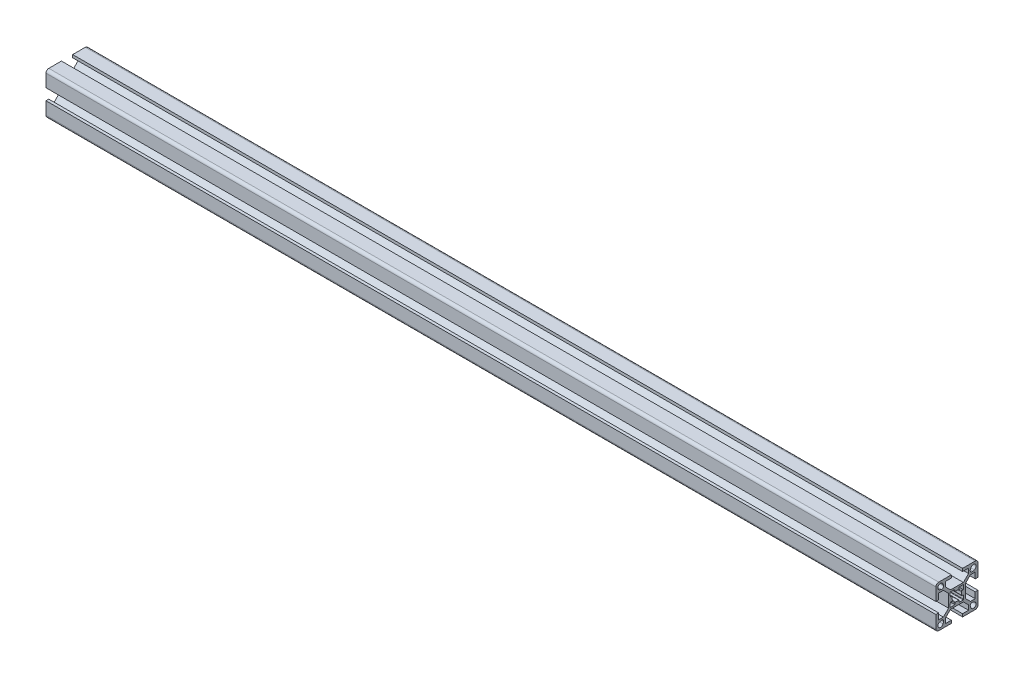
ISO-10303-21;
HEADER;
FILE_DESCRIPTION(('STEP AP214'),'2;1');
FILE_NAME('part.step','',(''),(''),'','','');
FILE_SCHEMA(('AUTOMOTIVE_DESIGN { 1 0 10303 214 1 1 1 1 }'));
ENDSEC;
DATA;
#1=APPLICATION_CONTEXT('core data for automotive mechanical design processes');
#2=APPLICATION_PROTOCOL_DEFINITION('international standard','automotive_design',2000,#1);
#3=PRODUCT_CONTEXT('',#1,'mechanical');
#4=PRODUCT('Part','Part','',(#3));
#5=PRODUCT_RELATED_PRODUCT_CATEGORY('part','',(#4));
#6=PRODUCT_DEFINITION_FORMATION('','',#4);
#7=PRODUCT_DEFINITION_CONTEXT('part definition',#1,'design');
#8=PRODUCT_DEFINITION('design','',#6,#7);
#9=PRODUCT_DEFINITION_SHAPE('','',#8);
#10=(LENGTH_UNIT() NAMED_UNIT(*) SI_UNIT(.MILLI.,.METRE.));
#11=(NAMED_UNIT(*) PLANE_ANGLE_UNIT() SI_UNIT($,.RADIAN.));
#12=(NAMED_UNIT(*) SI_UNIT($,.STERADIAN.) SOLID_ANGLE_UNIT());
#13=UNCERTAINTY_MEASURE_WITH_UNIT(LENGTH_MEASURE(1.E-05),#10,'distance_accuracy_value','');
#14=(GEOMETRIC_REPRESENTATION_CONTEXT(3) GLOBAL_UNCERTAINTY_ASSIGNED_CONTEXT((#13)) GLOBAL_UNIT_ASSIGNED_CONTEXT((#10,
#11,#12)) REPRESENTATION_CONTEXT('',''));
#15=CARTESIAN_POINT('',(0.,0.,0.));
#16=DIRECTION('',(0.,0.,1.));
#17=DIRECTION('',(1.,0.,0.));
#18=AXIS2_PLACEMENT_3D('',#15,#16,#17);
#19=CARTESIAN_POINT('',(634.,13.,13.));
#20=DIRECTION('',(1.,0.,0.));
#21=DIRECTION('',(0.,0.,-1.));
#22=AXIS2_PLACEMENT_3D('',#19,#20,#21);
#23=PLANE('',#22);
#24=CARTESIAN_POINT('',(634.,13.,13.));
#25=DIRECTION('',(1.,0.,0.));
#26=DIRECTION('',(0.,0.,-1.));
#27=AXIS2_PLACEMENT_3D('',#24,#25,#26);
#28=CIRCLE('',#27,1.99999999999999);
#29=CARTESIAN_POINT('',(634.,15.,13.));
#30=VERTEX_POINT('',#29);
#31=CARTESIAN_POINT('',(634.,13.,15.));
#32=VERTEX_POINT('',#31);
#33=EDGE_CURVE('E1300',#30,#32,#28,.T.);
#34=ORIENTED_EDGE('',*,*,#33,.T.);
#35=DIRECTION('',(0.,-1.,0.));
#36=VECTOR('',#35,1.);
#37=CARTESIAN_POINT('',(634.,13.,15.));
#38=LINE('',#37,#36);
#39=CARTESIAN_POINT('',(634.,3.99999999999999,15.));
#40=VERTEX_POINT('',#39);
#41=EDGE_CURVE('E1303',#32,#40,#38,.T.);
#42=ORIENTED_EDGE('',*,*,#41,.T.);
#43=DIRECTION('',(0.,0.,-1.));
#44=VECTOR('',#43,1.);
#45=CARTESIAN_POINT('',(634.,3.99999999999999,15.));
#46=LINE('',#45,#44);
#47=CARTESIAN_POINT('',(634.,3.99999999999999,13.));
#48=VERTEX_POINT('',#47);
#49=EDGE_CURVE('E1306',#40,#48,#46,.T.);
#50=ORIENTED_EDGE('',*,*,#49,.T.);
#51=DIRECTION('',(0.,1.,0.));
#52=VECTOR('',#51,1.);
#53=CARTESIAN_POINT('',(634.,3.99999999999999,13.));
#54=LINE('',#53,#52);
#55=CARTESIAN_POINT('',(634.,8.24999999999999,13.));
#56=VERTEX_POINT('',#55);
#57=EDGE_CURVE('E1308',#48,#56,#54,.T.);
#58=ORIENTED_EDGE('',*,*,#57,.T.);
#59=DIRECTION('',(0.,0.,-1.));
#60=VECTOR('',#59,1.);
#61=CARTESIAN_POINT('',(634.,8.24999999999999,13.));
#62=LINE('',#61,#60);
#63=CARTESIAN_POINT('',(634.,8.24999999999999,9.66421356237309));
#64=VERTEX_POINT('',#63);
#65=EDGE_CURVE('E1310',#56,#64,#62,.T.);
#66=ORIENTED_EDGE('',*,*,#65,.T.);
#67=DIRECTION('',(0.,-0.707106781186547,-0.707106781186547));
#68=VECTOR('',#67,1.);
#69=CARTESIAN_POINT('',(634.,8.24999999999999,9.66421356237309));
#70=LINE('',#69,#68);
#71=CARTESIAN_POINT('',(634.,4.5857864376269,6.));
#72=VERTEX_POINT('',#71);
#73=EDGE_CURVE('E1312',#64,#72,#70,.T.);
#74=ORIENTED_EDGE('',*,*,#73,.T.);
#75=DIRECTION('',(0.,-1.,0.));
#76=VECTOR('',#75,1.);
#77=CARTESIAN_POINT('',(634.,4.5857864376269,6.));
#78=LINE('',#77,#76);
#79=CARTESIAN_POINT('',(634.,-4.58578643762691,6.));
#80=VERTEX_POINT('',#79);
#81=EDGE_CURVE('E1314',#72,#80,#78,.T.);
#82=ORIENTED_EDGE('',*,*,#81,.T.);
#83=DIRECTION('',(0.,-0.707106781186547,0.707106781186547));
#84=VECTOR('',#83,1.);
#85=CARTESIAN_POINT('',(634.,-4.58578643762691,6.));
#86=LINE('',#85,#84);
#87=CARTESIAN_POINT('',(634.,-8.25,9.66421356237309));
#88=VERTEX_POINT('',#87);
#89=EDGE_CURVE('E1316',#80,#88,#86,.T.);
#90=ORIENTED_EDGE('',*,*,#89,.T.);
#91=DIRECTION('',(0.,0.,1.));
#92=VECTOR('',#91,1.);
#93=CARTESIAN_POINT('',(634.,-8.25,9.66421356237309));
#94=LINE('',#93,#92);
#95=CARTESIAN_POINT('',(634.,-8.25,13.));
#96=VERTEX_POINT('',#95);
#97=EDGE_CURVE('E1318',#88,#96,#94,.T.);
#98=ORIENTED_EDGE('',*,*,#97,.T.);
#99=DIRECTION('',(0.,1.,0.));
#100=VECTOR('',#99,1.);
#101=CARTESIAN_POINT('',(634.,-8.25,13.));
#102=LINE('',#101,#100);
#103=CARTESIAN_POINT('',(634.,-4.,13.));
#104=VERTEX_POINT('',#103);
#105=EDGE_CURVE('E1320',#96,#104,#102,.T.);
#106=ORIENTED_EDGE('',*,*,#105,.T.);
#107=DIRECTION('',(0.,0.,1.));
#108=VECTOR('',#107,1.);
#109=CARTESIAN_POINT('',(634.,-4.,13.));
#110=LINE('',#109,#108);
#111=CARTESIAN_POINT('',(634.,-4.,15.));
#112=VERTEX_POINT('',#111);
#113=EDGE_CURVE('E1322',#104,#112,#110,.T.);
#114=ORIENTED_EDGE('',*,*,#113,.T.);
#115=DIRECTION('',(0.,-1.,0.));
#116=VECTOR('',#115,1.);
#117=CARTESIAN_POINT('',(634.,-4.,15.));
#118=LINE('',#117,#116);
#119=CARTESIAN_POINT('',(634.,-13.,15.));
#120=VERTEX_POINT('',#119);
#121=EDGE_CURVE('E1324',#112,#120,#118,.T.);
#122=ORIENTED_EDGE('',*,*,#121,.T.);
#123=CARTESIAN_POINT('',(634.,-13.,13.));
#124=DIRECTION('',(1.,0.,0.));
#125=DIRECTION('',(0.,0.,-1.));
#126=AXIS2_PLACEMENT_3D('',#123,#124,#125);
#127=CIRCLE('',#126,2.);
#128=CARTESIAN_POINT('',(634.,-15.,13.));
#129=VERTEX_POINT('',#128);
#130=EDGE_CURVE('E1326',#120,#129,#127,.T.);
#131=ORIENTED_EDGE('',*,*,#130,.T.);
#132=DIRECTION('',(0.,0.,-1.));
#133=VECTOR('',#132,1.);
#134=CARTESIAN_POINT('',(634.,-15.,13.));
#135=LINE('',#134,#133);
#136=CARTESIAN_POINT('',(634.,-15.,4.));
#137=VERTEX_POINT('',#136);
#138=EDGE_CURVE('E1328',#129,#137,#135,.T.);
#139=ORIENTED_EDGE('',*,*,#138,.T.);
#140=DIRECTION('',(0.,1.,0.));
#141=VECTOR('',#140,1.);
#142=CARTESIAN_POINT('',(634.,-15.,4.));
#143=LINE('',#142,#141);
#144=CARTESIAN_POINT('',(634.,-13.,4.));
#145=VERTEX_POINT('',#144);
#146=EDGE_CURVE('E1330',#137,#145,#143,.T.);
#147=ORIENTED_EDGE('',*,*,#146,.T.);
#148=DIRECTION('',(0.,0.,1.));
#149=VECTOR('',#148,1.);
#150=CARTESIAN_POINT('',(634.,-13.,4.));
#151=LINE('',#150,#149);
#152=CARTESIAN_POINT('',(634.,-13.,8.25));
#153=VERTEX_POINT('',#152);
#154=EDGE_CURVE('E1332',#145,#153,#151,.T.);
#155=ORIENTED_EDGE('',*,*,#154,.T.);
#156=DIRECTION('',(0.,1.,0.));
#157=VECTOR('',#156,1.);
#158=CARTESIAN_POINT('',(634.,-13.,8.25));
#159=LINE('',#158,#157);
#160=CARTESIAN_POINT('',(634.,-9.6642135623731,8.25));
#161=VERTEX_POINT('',#160);
#162=EDGE_CURVE('E1334',#153,#161,#159,.T.);
#163=ORIENTED_EDGE('',*,*,#162,.T.);
#164=DIRECTION('',(0.,0.707106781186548,-0.707106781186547));
#165=VECTOR('',#164,1.);
#166=CARTESIAN_POINT('',(634.,-9.6642135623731,8.25));
#167=LINE('',#166,#165);
#168=CARTESIAN_POINT('',(634.,-6.00000000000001,4.58578643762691));
#169=VERTEX_POINT('',#168);
#170=EDGE_CURVE('E1336',#161,#169,#167,.T.);
#171=ORIENTED_EDGE('',*,*,#170,.T.);
#172=DIRECTION('',(0.,0.,-1.));
#173=VECTOR('',#172,1.);
#174=CARTESIAN_POINT('',(634.,-6.00000000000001,4.58578643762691));
#175=LINE('',#174,#173);
#176=CARTESIAN_POINT('',(634.,-6.00000000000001,-4.58578643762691));
#177=VERTEX_POINT('',#176);
#178=EDGE_CURVE('E1338',#169,#177,#175,.T.);
#179=ORIENTED_EDGE('',*,*,#178,.T.);
#180=DIRECTION('',(0.,-0.707106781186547,-0.707106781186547));
#181=VECTOR('',#180,1.);
#182=CARTESIAN_POINT('',(634.,-6.00000000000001,-4.58578643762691));
#183=LINE('',#182,#181);
#184=CARTESIAN_POINT('',(634.,-9.6642135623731,-8.25000000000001));
#185=VERTEX_POINT('',#184);
#186=EDGE_CURVE('E1340',#177,#185,#183,.T.);
#187=ORIENTED_EDGE('',*,*,#186,.T.);
#188=DIRECTION('',(0.,-1.,0.));
#189=VECTOR('',#188,1.);
#190=CARTESIAN_POINT('',(634.,-9.6642135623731,-8.25000000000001));
#191=LINE('',#190,#189);
#192=CARTESIAN_POINT('',(634.,-13.,-8.25000000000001));
#193=VERTEX_POINT('',#192);
#194=EDGE_CURVE('E1342',#185,#193,#191,.T.);
#195=ORIENTED_EDGE('',*,*,#194,.T.);
#196=DIRECTION('',(0.,0.,1.));
#197=VECTOR('',#196,1.);
#198=CARTESIAN_POINT('',(634.,-13.,-8.25000000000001));
#199=LINE('',#198,#197);
#200=CARTESIAN_POINT('',(634.,-13.,-4.));
#201=VERTEX_POINT('',#200);
#202=EDGE_CURVE('E1344',#193,#201,#199,.T.);
#203=ORIENTED_EDGE('',*,*,#202,.T.);
#204=DIRECTION('',(0.,-1.,0.));
#205=VECTOR('',#204,1.);
#206=CARTESIAN_POINT('',(634.,-13.,-4.));
#207=LINE('',#206,#205);
#208=CARTESIAN_POINT('',(634.,-15.,-4.));
#209=VERTEX_POINT('',#208);
#210=EDGE_CURVE('E1346',#201,#209,#207,.T.);
#211=ORIENTED_EDGE('',*,*,#210,.T.);
#212=DIRECTION('',(0.,0.,-1.));
#213=VECTOR('',#212,1.);
#214=CARTESIAN_POINT('',(634.,-15.,-4.));
#215=LINE('',#214,#213);
#216=CARTESIAN_POINT('',(634.,-15.,-13.));
#217=VERTEX_POINT('',#216);
#218=EDGE_CURVE('E1348',#209,#217,#215,.T.);
#219=ORIENTED_EDGE('',*,*,#218,.T.);
#220=CARTESIAN_POINT('',(634.,-13.,-13.));
#221=DIRECTION('',(1.,0.,0.));
#222=DIRECTION('',(0.,0.,-1.));
#223=AXIS2_PLACEMENT_3D('',#220,#221,#222);
#224=CIRCLE('',#223,1.99999999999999);
#225=CARTESIAN_POINT('',(634.,-13.,-15.));
#226=VERTEX_POINT('',#225);
#227=EDGE_CURVE('E1350',#217,#226,#224,.T.);
#228=ORIENTED_EDGE('',*,*,#227,.T.);
#229=DIRECTION('',(0.,1.,0.));
#230=VECTOR('',#229,1.);
#231=CARTESIAN_POINT('',(634.,-13.,-15.));
#232=LINE('',#231,#230);
#233=CARTESIAN_POINT('',(634.,-4.00000000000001,-15.));
#234=VERTEX_POINT('',#233);
#235=EDGE_CURVE('E1352',#226,#234,#232,.T.);
#236=ORIENTED_EDGE('',*,*,#235,.T.);
#237=DIRECTION('',(0.,0.,1.));
#238=VECTOR('',#237,1.);
#239=CARTESIAN_POINT('',(634.,-4.00000000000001,-15.));
#240=LINE('',#239,#238);
#241=CARTESIAN_POINT('',(634.,-4.00000000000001,-13.));
#242=VERTEX_POINT('',#241);
#243=EDGE_CURVE('E1354',#234,#242,#240,.T.);
#244=ORIENTED_EDGE('',*,*,#243,.T.);
#245=DIRECTION('',(0.,-1.,0.));
#246=VECTOR('',#245,1.);
#247=CARTESIAN_POINT('',(634.,-4.00000000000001,-13.));
#248=LINE('',#247,#246);
#249=CARTESIAN_POINT('',(634.,-8.25000000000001,-13.));
#250=VERTEX_POINT('',#249);
#251=EDGE_CURVE('E1356',#242,#250,#248,.T.);
#252=ORIENTED_EDGE('',*,*,#251,.T.);
#253=DIRECTION('',(0.,0.,1.));
#254=VECTOR('',#253,1.);
#255=CARTESIAN_POINT('',(634.,-8.25000000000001,-13.));
#256=LINE('',#255,#254);
#257=CARTESIAN_POINT('',(634.,-8.25000000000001,-9.6642135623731));
#258=VERTEX_POINT('',#257);
#259=EDGE_CURVE('E1358',#250,#258,#256,.T.);
#260=ORIENTED_EDGE('',*,*,#259,.T.);
#261=DIRECTION('',(0.,0.707106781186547,0.707106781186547));
#262=VECTOR('',#261,1.);
#263=CARTESIAN_POINT('',(634.,-8.25000000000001,-9.6642135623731));
#264=LINE('',#263,#262);
#265=CARTESIAN_POINT('',(634.,-4.58578643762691,-6.00000000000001));
#266=VERTEX_POINT('',#265);
#267=EDGE_CURVE('E1360',#258,#266,#264,.T.);
#268=ORIENTED_EDGE('',*,*,#267,.T.);
#269=DIRECTION('',(0.,1.,0.));
#270=VECTOR('',#269,1.);
#271=CARTESIAN_POINT('',(634.,-4.58578643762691,-6.00000000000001));
#272=LINE('',#271,#270);
#273=CARTESIAN_POINT('',(634.,4.5857864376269,-6.00000000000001));
#274=VERTEX_POINT('',#273);
#275=EDGE_CURVE('E1362',#266,#274,#272,.T.);
#276=ORIENTED_EDGE('',*,*,#275,.T.);
#277=DIRECTION('',(0.,0.707106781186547,-0.707106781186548));
#278=VECTOR('',#277,1.);
#279=CARTESIAN_POINT('',(634.,4.5857864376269,-6.00000000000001));
#280=LINE('',#279,#278);
#281=CARTESIAN_POINT('',(634.,8.24999999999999,-9.6642135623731));
#282=VERTEX_POINT('',#281);
#283=EDGE_CURVE('E1364',#274,#282,#280,.T.);
#284=ORIENTED_EDGE('',*,*,#283,.T.);
#285=DIRECTION('',(0.,0.,-1.));
#286=VECTOR('',#285,1.);
#287=CARTESIAN_POINT('',(634.,8.24999999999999,-9.6642135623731));
#288=LINE('',#287,#286);
#289=CARTESIAN_POINT('',(634.,8.24999999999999,-13.));
#290=VERTEX_POINT('',#289);
#291=EDGE_CURVE('E1366',#282,#290,#288,.T.);
#292=ORIENTED_EDGE('',*,*,#291,.T.);
#293=DIRECTION('',(0.,-1.,0.));
#294=VECTOR('',#293,1.);
#295=CARTESIAN_POINT('',(634.,8.24999999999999,-13.));
#296=LINE('',#295,#294);
#297=CARTESIAN_POINT('',(634.,3.99999999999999,-13.));
#298=VERTEX_POINT('',#297);
#299=EDGE_CURVE('E1368',#290,#298,#296,.T.);
#300=ORIENTED_EDGE('',*,*,#299,.T.);
#301=DIRECTION('',(0.,0.,-1.));
#302=VECTOR('',#301,1.);
#303=CARTESIAN_POINT('',(634.,3.99999999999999,-13.));
#304=LINE('',#303,#302);
#305=CARTESIAN_POINT('',(634.,3.99999999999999,-15.));
#306=VERTEX_POINT('',#305);
#307=EDGE_CURVE('E1370',#298,#306,#304,.T.);
#308=ORIENTED_EDGE('',*,*,#307,.T.);
#309=DIRECTION('',(0.,1.,0.));
#310=VECTOR('',#309,1.);
#311=CARTESIAN_POINT('',(634.,3.99999999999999,-15.));
#312=LINE('',#311,#310);
#313=CARTESIAN_POINT('',(634.,13.,-15.));
#314=VERTEX_POINT('',#313);
#315=EDGE_CURVE('E1372',#306,#314,#312,.T.);
#316=ORIENTED_EDGE('',*,*,#315,.T.);
#317=CARTESIAN_POINT('',(634.,13.,-13.));
#318=DIRECTION('',(1.,0.,0.));
#319=DIRECTION('',(0.,0.,-1.));
#320=AXIS2_PLACEMENT_3D('',#317,#318,#319);
#321=CIRCLE('',#320,2.);
#322=CARTESIAN_POINT('',(634.,15.,-13.));
#323=VERTEX_POINT('',#322);
#324=EDGE_CURVE('E1374',#314,#323,#321,.T.);
#325=ORIENTED_EDGE('',*,*,#324,.T.);
#326=DIRECTION('',(0.,0.,1.));
#327=VECTOR('',#326,1.);
#328=CARTESIAN_POINT('',(634.,15.,-13.));
#329=LINE('',#328,#327);
#330=CARTESIAN_POINT('',(634.,15.,-4.));
#331=VERTEX_POINT('',#330);
#332=EDGE_CURVE('E1376',#323,#331,#329,.T.);
#333=ORIENTED_EDGE('',*,*,#332,.T.);
#334=DIRECTION('',(0.,-1.,0.));
#335=VECTOR('',#334,1.);
#336=CARTESIAN_POINT('',(634.,15.,-4.));
#337=LINE('',#336,#335);
#338=CARTESIAN_POINT('',(634.,13.,-4.));
#339=VERTEX_POINT('',#338);
#340=EDGE_CURVE('E1378',#331,#339,#337,.T.);
#341=ORIENTED_EDGE('',*,*,#340,.T.);
#342=DIRECTION('',(0.,0.,-1.));
#343=VECTOR('',#342,1.);
#344=CARTESIAN_POINT('',(634.,13.,-4.));
#345=LINE('',#344,#343);
#346=CARTESIAN_POINT('',(634.,13.,-8.25000000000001));
#347=VERTEX_POINT('',#346);
#348=EDGE_CURVE('E1380',#339,#347,#345,.T.);
#349=ORIENTED_EDGE('',*,*,#348,.T.);
#350=DIRECTION('',(0.,-1.,0.));
#351=VECTOR('',#350,1.);
#352=CARTESIAN_POINT('',(634.,13.,-8.25000000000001));
#353=LINE('',#352,#351);
#354=CARTESIAN_POINT('',(634.,9.66421356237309,-8.25000000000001));
#355=VERTEX_POINT('',#354);
#356=EDGE_CURVE('E1382',#347,#355,#353,.T.);
#357=ORIENTED_EDGE('',*,*,#356,.T.);
#358=DIRECTION('',(0.,-0.707106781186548,0.707106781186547));
#359=VECTOR('',#358,1.);
#360=CARTESIAN_POINT('',(634.,9.66421356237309,-8.25000000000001));
#361=LINE('',#360,#359);
#362=CARTESIAN_POINT('',(634.,5.99999999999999,-4.58578643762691));
#363=VERTEX_POINT('',#362);
#364=EDGE_CURVE('E1384',#355,#363,#361,.T.);
#365=ORIENTED_EDGE('',*,*,#364,.T.);
#366=DIRECTION('',(0.,0.,1.));
#367=VECTOR('',#366,1.);
#368=CARTESIAN_POINT('',(634.,5.99999999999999,-4.58578643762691));
#369=LINE('',#368,#367);
#370=CARTESIAN_POINT('',(634.,5.99999999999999,4.58578643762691));
#371=VERTEX_POINT('',#370);
#372=EDGE_CURVE('E1386',#363,#371,#369,.T.);
#373=ORIENTED_EDGE('',*,*,#372,.T.);
#374=DIRECTION('',(0.,0.707106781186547,0.707106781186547));
#375=VECTOR('',#374,1.);
#376=CARTESIAN_POINT('',(634.,5.99999999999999,4.58578643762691));
#377=LINE('',#376,#375);
#378=CARTESIAN_POINT('',(634.,9.66421356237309,8.25));
#379=VERTEX_POINT('',#378);
#380=EDGE_CURVE('E1388',#371,#379,#377,.T.);
#381=ORIENTED_EDGE('',*,*,#380,.T.);
#382=DIRECTION('',(0.,1.,0.));
#383=VECTOR('',#382,1.);
#384=CARTESIAN_POINT('',(634.,9.66421356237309,8.25));
#385=LINE('',#384,#383);
#386=CARTESIAN_POINT('',(634.,13.,8.25));
#387=VERTEX_POINT('',#386);
#388=EDGE_CURVE('E1390',#379,#387,#385,.T.);
#389=ORIENTED_EDGE('',*,*,#388,.T.);
#390=DIRECTION('',(0.,0.,-1.));
#391=VECTOR('',#390,1.);
#392=CARTESIAN_POINT('',(634.,13.,8.25));
#393=LINE('',#392,#391);
#394=CARTESIAN_POINT('',(634.,13.,4.));
#395=VERTEX_POINT('',#394);
#396=EDGE_CURVE('E1392',#387,#395,#393,.T.);
#397=ORIENTED_EDGE('',*,*,#396,.T.);
#398=DIRECTION('',(0.,1.,0.));
#399=VECTOR('',#398,1.);
#400=CARTESIAN_POINT('',(634.,13.,4.));
#401=LINE('',#400,#399);
#402=CARTESIAN_POINT('',(634.,15.,4.));
#403=VERTEX_POINT('',#402);
#404=EDGE_CURVE('E1394',#395,#403,#401,.T.);
#405=ORIENTED_EDGE('',*,*,#404,.T.);
#406=DIRECTION('',(0.,0.,1.));
#407=VECTOR('',#406,1.);
#408=CARTESIAN_POINT('',(634.,15.,4.));
#409=LINE('',#408,#407);
#410=EDGE_CURVE('E1396',#403,#30,#409,.T.);
#411=ORIENTED_EDGE('',*,*,#410,.T.);
#412=EDGE_LOOP('',(#34,#42,#50,#58,#66,#74,#82,#90,#98,#106,#114,#122,#131,#139,#147,#155,#163,
#171,#179,#187,#195,#203,#211,#219,#228,#236,#244,#252,#260,#268,#276,#284,#292,#300,#308,#316,
#325,#333,#341,#349,#357,#365,#373,#381,#389,#397,#405,#411));
#413=FACE_BOUND('',#412,.T.);
#414=DIRECTION('',(0.,-0.348174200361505,-0.93742985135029));
#415=VECTOR('',#414,1.);
#416=CARTESIAN_POINT('',(634.,9.91888328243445,12.3615309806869));
#417=LINE('',#416,#415);
#418=CARTESIAN_POINT('',(634.,9.91888328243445,12.3615309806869));
#419=VERTEX_POINT('',#418);
#420=CARTESIAN_POINT('',(634.,9.53907007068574,11.3389157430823));
#421=VERTEX_POINT('',#420);
#422=EDGE_CURVE('E1271',#419,#421,#417,.T.);
#423=ORIENTED_EDGE('',*,*,#422,.F.);
#424=CARTESIAN_POINT('',(634.,11.7,11.7));
#425=DIRECTION('',(1.,0.,0.));
#426=DIRECTION('',(0.,0.,-1.));
#427=AXIS2_PLACEMENT_3D('',#424,#425,#426);
#428=CIRCLE('',#427,1.9);
#429=CARTESIAN_POINT('',(634.,12.3615309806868,9.91888328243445));
#430=VERTEX_POINT('',#429);
#431=EDGE_CURVE('E1269',#430,#419,#428,.T.);
#432=ORIENTED_EDGE('',*,*,#431,.F.);
#433=DIRECTION('',(0.,0.937429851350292,0.3481742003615));
#434=VECTOR('',#433,1.);
#435=CARTESIAN_POINT('',(634.,11.3389157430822,9.53907007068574));
#436=LINE('',#435,#434);
#437=CARTESIAN_POINT('',(634.,11.3389157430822,9.53907007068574));
#438=VERTEX_POINT('',#437);
#439=EDGE_CURVE('E1277',#438,#430,#436,.T.);
#440=ORIENTED_EDGE('',*,*,#439,.F.);
#441=CARTESIAN_POINT('',(634.,10.8514718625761,10.8514718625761));
#442=DIRECTION('',(1.,0.,0.));
#443=DIRECTION('',(0.,0.,-1.));
#444=AXIS2_PLACEMENT_3D('',#441,#442,#443);
#445=CIRCLE('',#444,1.4);
#446=EDGE_CURVE('E1274',#421,#438,#445,.T.);
#447=ORIENTED_EDGE('',*,*,#446,.F.);
#448=EDGE_LOOP('',(#423,#432,#440,#447));
#449=FACE_BOUND('',#448,.T.);
#450=DIRECTION('',(0.,0.3481742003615,-0.937429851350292));
#451=VECTOR('',#450,1.);
#452=CARTESIAN_POINT('',(634.,9.53907007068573,-11.3389157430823));
#453=LINE('',#452,#451);
#454=CARTESIAN_POINT('',(634.,9.53907007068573,-11.3389157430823));
#455=VERTEX_POINT('',#454);
#456=CARTESIAN_POINT('',(634.,9.91888328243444,-12.3615309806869));
#457=VERTEX_POINT('',#456);
#458=EDGE_CURVE('E1240',#455,#457,#453,.T.);
#459=ORIENTED_EDGE('',*,*,#458,.F.);
#460=CARTESIAN_POINT('',(634.,10.8514718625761,-10.8514718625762));
#461=DIRECTION('',(1.,0.,0.));
#462=DIRECTION('',(0.,0.,-1.));
#463=AXIS2_PLACEMENT_3D('',#460,#461,#462);
#464=CIRCLE('',#463,1.4);
#465=CARTESIAN_POINT('',(634.,11.3389157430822,-9.53907007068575));
#466=VERTEX_POINT('',#465);
#467=EDGE_CURVE('E1238',#466,#455,#464,.T.);
#468=ORIENTED_EDGE('',*,*,#467,.F.);
#469=DIRECTION('',(0.,-0.937429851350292,0.3481742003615));
#470=VECTOR('',#469,1.);
#471=CARTESIAN_POINT('',(634.,12.3615309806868,-9.91888328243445));
#472=LINE('',#471,#470);
#473=CARTESIAN_POINT('',(634.,12.3615309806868,-9.91888328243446));
#474=VERTEX_POINT('',#473);
#475=EDGE_CURVE('E1246',#474,#466,#472,.T.);
#476=ORIENTED_EDGE('',*,*,#475,.F.);
#477=CARTESIAN_POINT('',(634.,11.7,-11.7));
#478=DIRECTION('',(1.,0.,0.));
#479=DIRECTION('',(0.,0.,-1.));
#480=AXIS2_PLACEMENT_3D('',#477,#478,#479);
#481=CIRCLE('',#480,1.9);
#482=EDGE_CURVE('E1243',#457,#474,#481,.T.);
#483=ORIENTED_EDGE('',*,*,#482,.F.);
#484=EDGE_LOOP('',(#459,#468,#476,#483));
#485=FACE_BOUND('',#484,.T.);
#486=DIRECTION('',(0.,0.,-1.));
#487=VECTOR('',#486,1.);
#488=CARTESIAN_POINT('',(634.,-4.80000000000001,4.5));
#489=LINE('',#488,#487);
#490=CARTESIAN_POINT('',(634.,-4.80000000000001,4.5));
#491=VERTEX_POINT('',#490);
#492=CARTESIAN_POINT('',(634.,-4.80000000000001,2.64443357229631));
#493=VERTEX_POINT('',#492);
#494=EDGE_CURVE('E845',#491,#493,#489,.T.);
#495=ORIENTED_EDGE('',*,*,#494,.F.);
#496=CARTESIAN_POINT('',(634.,-4.50000000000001,4.5));
#497=DIRECTION('',(1.,0.,0.));
#498=DIRECTION('',(0.,0.,-1.));
#499=AXIS2_PLACEMENT_3D('',#496,#497,#498);
#500=CIRCLE('',#499,0.299999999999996);
#501=CARTESIAN_POINT('',(634.,-4.50000000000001,4.8));
#502=VERTEX_POINT('',#501);
#503=EDGE_CURVE('E843',#502,#491,#500,.T.);
#504=ORIENTED_EDGE('',*,*,#503,.F.);
#505=DIRECTION('',(0.,-1.,0.));
#506=VECTOR('',#505,1.);
#507=CARTESIAN_POINT('',(634.,-2.6444335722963,4.8));
#508=LINE('',#507,#506);
#509=CARTESIAN_POINT('',(634.,-2.64443357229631,4.8));
#510=VERTEX_POINT('',#509);
#511=EDGE_CURVE('E955',#510,#502,#508,.T.);
#512=ORIENTED_EDGE('',*,*,#511,.F.);
#513=CARTESIAN_POINT('',(634.,-2.6444335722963,4.50000000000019));
#514=DIRECTION('',(1.,0.,0.));
#515=DIRECTION('',(0.,0.,-1.));
#516=AXIS2_PLACEMENT_3D('',#513,#514,#515);
#517=CIRCLE('',#516,0.299999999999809);
#518=CARTESIAN_POINT('',(634.,-2.58719087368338,4.7944881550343));
#519=VERTEX_POINT('',#518);
#520=EDGE_CURVE('E952',#519,#510,#517,.T.);
#521=ORIENTED_EDGE('',*,*,#520,.F.);
#522=DIRECTION('',(0.,-0.981627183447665,0.190808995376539));
#523=VECTOR('',#522,1.);
#524=CARTESIAN_POINT('',(634.,-1.74275730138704,4.63034689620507));
#525=LINE('',#524,#523);
#526=CARTESIAN_POINT('',(634.,-1.74275730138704,4.63034689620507));
#527=VERTEX_POINT('',#526);
#528=EDGE_CURVE('E950',#527,#519,#525,.T.);
#529=ORIENTED_EDGE('',*,*,#528,.F.);
#530=CARTESIAN_POINT('',(634.,-1.8,4.33585874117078));
#531=DIRECTION('',(1.,0.,0.));
#532=DIRECTION('',(0.,0.,-1.));
#533=AXIS2_PLACEMENT_3D('',#530,#531,#532);
#534=CIRCLE('',#533,0.299999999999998);
#535=CARTESIAN_POINT('',(634.,-1.50000000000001,4.33585874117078));
#536=VERTEX_POINT('',#535);
#537=EDGE_CURVE('E948',#536,#527,#534,.T.);
#538=ORIENTED_EDGE('',*,*,#537,.F.);
#539=DIRECTION('',(0.,0.,1.));
#540=VECTOR('',#539,1.);
#541=CARTESIAN_POINT('',(634.,-1.50000000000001,3.5));
#542=LINE('',#541,#540);
#543=CARTESIAN_POINT('',(634.,-1.50000000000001,3.5));
#544=VERTEX_POINT('',#543);
#545=EDGE_CURVE('E946',#544,#536,#542,.T.);
#546=ORIENTED_EDGE('',*,*,#545,.F.);
#547=CARTESIAN_POINT('',(634.,-1.20000000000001,3.5));
#548=DIRECTION('',(-1.,0.,0.));
#549=DIRECTION('',(0.,0.,-1.));
#550=AXIS2_PLACEMENT_3D('',#547,#548,#549);
#551=CIRCLE('',#550,0.3);
#552=CARTESIAN_POINT('',(634.,-1.10270270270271,3.21621621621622));
#553=VERTEX_POINT('',#552);
#554=EDGE_CURVE('E944',#553,#544,#551,.T.);
#555=ORIENTED_EDGE('',*,*,#554,.F.);
#556=CARTESIAN_POINT('',(634.,0.,0.));
#557=DIRECTION('',(1.,0.,0.));
#558=DIRECTION('',(0.,0.,-1.));
#559=AXIS2_PLACEMENT_3D('',#556,#557,#558);
#560=CIRCLE('',#559,3.40000000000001);
#561=CARTESIAN_POINT('',(634.,1.1027027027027,3.21621621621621));
#562=VERTEX_POINT('',#561);
#563=EDGE_CURVE('E942',#562,#553,#560,.T.);
#564=ORIENTED_EDGE('',*,*,#563,.F.);
#565=CARTESIAN_POINT('',(634.,1.2,3.5));
#566=DIRECTION('',(-1.,0.,0.));
#567=DIRECTION('',(0.,0.,-1.));
#568=AXIS2_PLACEMENT_3D('',#565,#566,#567);
#569=CIRCLE('',#568,0.3);
#570=CARTESIAN_POINT('',(634.,1.5,3.5));
#571=VERTEX_POINT('',#570);
#572=EDGE_CURVE('E940',#571,#562,#569,.T.);
#573=ORIENTED_EDGE('',*,*,#572,.F.);
#574=DIRECTION('',(0.,0.,-1.));
#575=VECTOR('',#574,1.);
#576=CARTESIAN_POINT('',(634.,1.5,4.33585874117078));
#577=LINE('',#576,#575);
#578=CARTESIAN_POINT('',(634.,1.5,4.33585874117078));
#579=VERTEX_POINT('',#578);
#580=EDGE_CURVE('E938',#579,#571,#577,.T.);
#581=ORIENTED_EDGE('',*,*,#580,.F.);
#582=CARTESIAN_POINT('',(634.,1.79999999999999,4.33585874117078));
#583=DIRECTION('',(1.,0.,0.));
#584=DIRECTION('',(0.,0.,-1.));
#585=AXIS2_PLACEMENT_3D('',#582,#583,#584);
#586=CIRCLE('',#585,0.299999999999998);
#587=CARTESIAN_POINT('',(634.,1.74275730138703,4.63034689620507));
#588=VERTEX_POINT('',#587);
#589=EDGE_CURVE('E936',#588,#579,#586,.T.);
#590=ORIENTED_EDGE('',*,*,#589,.F.);
#591=DIRECTION('',(0.,-0.981627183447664,-0.190808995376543));
#592=VECTOR('',#591,1.);
#593=CARTESIAN_POINT('',(634.,2.58719087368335,4.7944881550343));
#594=LINE('',#593,#592);
#595=CARTESIAN_POINT('',(634.,2.58719087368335,4.7944881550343));
#596=VERTEX_POINT('',#595);
#597=EDGE_CURVE('E934',#596,#588,#594,.T.);
#598=ORIENTED_EDGE('',*,*,#597,.F.);
#599=CARTESIAN_POINT('',(634.,2.6444335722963,4.50000000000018));
#600=DIRECTION('',(1.,0.,0.));
#601=DIRECTION('',(0.,0.,-1.));
#602=AXIS2_PLACEMENT_3D('',#599,#600,#601);
#603=CIRCLE('',#602,0.299999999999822);
#604=CARTESIAN_POINT('',(634.,2.6444335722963,4.8));
#605=VERTEX_POINT('',#604);
#606=EDGE_CURVE('E932',#605,#596,#603,.T.);
#607=ORIENTED_EDGE('',*,*,#606,.F.);
#608=DIRECTION('',(0.,-1.,0.));
#609=VECTOR('',#608,1.);
#610=CARTESIAN_POINT('',(634.,4.5,4.8));
#611=LINE('',#610,#609);
#612=CARTESIAN_POINT('',(634.,4.5,4.8));
#613=VERTEX_POINT('',#612);
#614=EDGE_CURVE('E930',#613,#605,#611,.T.);
#615=ORIENTED_EDGE('',*,*,#614,.F.);
#616=CARTESIAN_POINT('',(634.,4.5,4.5));
#617=DIRECTION('',(1.,0.,0.));
#618=DIRECTION('',(0.,0.,-1.));
#619=AXIS2_PLACEMENT_3D('',#616,#617,#618);
#620=CIRCLE('',#619,0.299999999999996);
#621=CARTESIAN_POINT('',(634.,4.79999999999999,4.5));
#622=VERTEX_POINT('',#621);
#623=EDGE_CURVE('E928',#622,#613,#620,.T.);
#624=ORIENTED_EDGE('',*,*,#623,.F.);
#625=DIRECTION('',(0.,0.,1.));
#626=VECTOR('',#625,1.);
#627=CARTESIAN_POINT('',(634.,4.8,2.6444335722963));
#628=LINE('',#627,#626);
#629=CARTESIAN_POINT('',(634.,4.8,2.6444335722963));
#630=VERTEX_POINT('',#629);
#631=EDGE_CURVE('E926',#630,#622,#628,.T.);
#632=ORIENTED_EDGE('',*,*,#631,.F.);
#633=CARTESIAN_POINT('',(634.,4.50000000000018,2.6444335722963));
#634=DIRECTION('',(1.,0.,0.));
#635=DIRECTION('',(0.,0.,-1.));
#636=AXIS2_PLACEMENT_3D('',#633,#634,#635);
#637=CIRCLE('',#636,0.299999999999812);
#638=CARTESIAN_POINT('',(634.,4.7944881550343,2.58719087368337));
#639=VERTEX_POINT('',#638);
#640=EDGE_CURVE('E924',#639,#630,#637,.T.);
#641=ORIENTED_EDGE('',*,*,#640,.F.);
#642=DIRECTION('',(0.,0.190808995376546,0.981627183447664));
#643=VECTOR('',#642,1.);
#644=CARTESIAN_POINT('',(634.,4.63034689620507,1.74275730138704));
#645=LINE('',#644,#643);
#646=CARTESIAN_POINT('',(634.,4.63034689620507,1.74275730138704));
#647=VERTEX_POINT('',#646);
#648=EDGE_CURVE('E922',#647,#639,#645,.T.);
#649=ORIENTED_EDGE('',*,*,#648,.F.);
#650=CARTESIAN_POINT('',(634.,4.33585874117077,1.8));
#651=DIRECTION('',(1.,0.,0.));
#652=DIRECTION('',(0.,0.,-1.));
#653=AXIS2_PLACEMENT_3D('',#650,#651,#652);
#654=CIRCLE('',#653,0.299999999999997);
#655=CARTESIAN_POINT('',(634.,4.33585874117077,1.5));
#656=VERTEX_POINT('',#655);
#657=EDGE_CURVE('E920',#656,#647,#654,.T.);
#658=ORIENTED_EDGE('',*,*,#657,.F.);
#659=DIRECTION('',(0.,1.,0.));
#660=VECTOR('',#659,1.);
#661=CARTESIAN_POINT('',(634.,3.5,1.5));
#662=LINE('',#661,#660);
#663=CARTESIAN_POINT('',(634.,3.5,1.5));
#664=VERTEX_POINT('',#663);
#665=EDGE_CURVE('E918',#664,#656,#662,.T.);
#666=ORIENTED_EDGE('',*,*,#665,.F.);
#667=CARTESIAN_POINT('',(634.,3.5,1.2));
#668=DIRECTION('',(-1.,0.,0.));
#669=DIRECTION('',(0.,0.,-1.));
#670=AXIS2_PLACEMENT_3D('',#667,#668,#669);
#671=CIRCLE('',#670,0.300000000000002);
#672=CARTESIAN_POINT('',(634.,3.21621621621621,1.1027027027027));
#673=VERTEX_POINT('',#672);
#674=EDGE_CURVE('E916',#673,#664,#671,.T.);
#675=ORIENTED_EDGE('',*,*,#674,.F.);
#676=CARTESIAN_POINT('',(634.,0.,0.));
#677=DIRECTION('',(1.,0.,0.));
#678=DIRECTION('',(0.,0.,-1.));
#679=AXIS2_PLACEMENT_3D('',#676,#677,#678);
#680=CIRCLE('',#679,3.4);
#681=CARTESIAN_POINT('',(634.,3.21621621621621,-1.10270270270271));
#682=VERTEX_POINT('',#681);
#683=EDGE_CURVE('E914',#682,#673,#680,.T.);
#684=ORIENTED_EDGE('',*,*,#683,.F.);
#685=CARTESIAN_POINT('',(634.,3.49999999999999,-1.20000000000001));
#686=DIRECTION('',(-1.,0.,0.));
#687=DIRECTION('',(0.,0.,-1.));
#688=AXIS2_PLACEMENT_3D('',#685,#686,#687);
#689=CIRCLE('',#688,0.299999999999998);
#690=CARTESIAN_POINT('',(634.,3.49999999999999,-1.5));
#691=VERTEX_POINT('',#690);
#692=EDGE_CURVE('E912',#691,#682,#689,.T.);
#693=ORIENTED_EDGE('',*,*,#692,.F.);
#694=DIRECTION('',(0.,-1.,0.));
#695=VECTOR('',#694,1.);
#696=CARTESIAN_POINT('',(634.,4.33585874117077,-1.5));
#697=LINE('',#696,#695);
#698=CARTESIAN_POINT('',(634.,4.33585874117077,-1.5));
#699=VERTEX_POINT('',#698);
#700=EDGE_CURVE('E910',#699,#691,#697,.T.);
#701=ORIENTED_EDGE('',*,*,#700,.F.);
#702=CARTESIAN_POINT('',(634.,4.33585874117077,-1.8));
#703=DIRECTION('',(1.,0.,0.));
#704=DIRECTION('',(0.,0.,-1.));
#705=AXIS2_PLACEMENT_3D('',#702,#703,#704);
#706=CIRCLE('',#705,0.299999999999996);
#707=CARTESIAN_POINT('',(634.,4.63034689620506,-1.74275730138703));
#708=VERTEX_POINT('',#707);
#709=EDGE_CURVE('E908',#708,#699,#706,.T.);
#710=ORIENTED_EDGE('',*,*,#709,.F.);
#711=DIRECTION('',(0.,-0.190808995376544,0.981627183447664));
#712=VECTOR('',#711,1.);
#713=CARTESIAN_POINT('',(634.,4.79448815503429,-2.58719087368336));
#714=LINE('',#713,#712);
#715=CARTESIAN_POINT('',(634.,4.79448815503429,-2.58719087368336));
#716=VERTEX_POINT('',#715);
#717=EDGE_CURVE('E906',#716,#708,#714,.T.);
#718=ORIENTED_EDGE('',*,*,#717,.F.);
#719=CARTESIAN_POINT('',(634.,4.50000000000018,-2.64443357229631));
#720=DIRECTION('',(1.,0.,0.));
#721=DIRECTION('',(0.,0.,-1.));
#722=AXIS2_PLACEMENT_3D('',#719,#720,#721);
#723=CIRCLE('',#722,0.299999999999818);
#724=CARTESIAN_POINT('',(634.,4.79999999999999,-2.64443357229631));
#725=VERTEX_POINT('',#724);
#726=EDGE_CURVE('E904',#725,#716,#723,.T.);
#727=ORIENTED_EDGE('',*,*,#726,.F.);
#728=DIRECTION('',(0.,0.,1.));
#729=VECTOR('',#728,1.);
#730=CARTESIAN_POINT('',(634.,4.8,-4.5));
#731=LINE('',#730,#729);
#732=CARTESIAN_POINT('',(634.,4.8,-4.5));
#733=VERTEX_POINT('',#732);
#734=EDGE_CURVE('E902',#733,#725,#731,.T.);
#735=ORIENTED_EDGE('',*,*,#734,.F.);
#736=CARTESIAN_POINT('',(634.,4.5,-4.5));
#737=DIRECTION('',(1.,0.,0.));
#738=DIRECTION('',(0.,0.,-1.));
#739=AXIS2_PLACEMENT_3D('',#736,#737,#738);
#740=CIRCLE('',#739,0.299999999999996);
#741=CARTESIAN_POINT('',(634.,4.5,-4.8));
#742=VERTEX_POINT('',#741);
#743=EDGE_CURVE('E900',#742,#733,#740,.T.);
#744=ORIENTED_EDGE('',*,*,#743,.F.);
#745=DIRECTION('',(0.,1.,0.));
#746=VECTOR('',#745,1.);
#747=CARTESIAN_POINT('',(634.,2.64443357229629,-4.8));
#748=LINE('',#747,#746);
#749=CARTESIAN_POINT('',(634.,2.64443357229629,-4.8));
#750=VERTEX_POINT('',#749);
#751=EDGE_CURVE('E898',#750,#742,#748,.T.);
#752=ORIENTED_EDGE('',*,*,#751,.F.);
#753=CARTESIAN_POINT('',(634.,2.64443357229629,-4.50000000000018));
#754=DIRECTION('',(1.,0.,0.));
#755=DIRECTION('',(0.,0.,-1.));
#756=AXIS2_PLACEMENT_3D('',#753,#754,#755);
#757=CIRCLE('',#756,0.299999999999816);
#758=CARTESIAN_POINT('',(634.,2.58719087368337,-4.7944881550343));
#759=VERTEX_POINT('',#758);
#760=EDGE_CURVE('E896',#759,#750,#757,.T.);
#761=ORIENTED_EDGE('',*,*,#760,.F.);
#762=DIRECTION('',(0.,0.981627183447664,-0.190808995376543));
#763=VECTOR('',#762,1.);
#764=CARTESIAN_POINT('',(634.,1.74275730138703,-4.63034689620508));
#765=LINE('',#764,#763);
#766=CARTESIAN_POINT('',(634.,1.74275730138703,-4.63034689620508));
#767=VERTEX_POINT('',#766);
#768=EDGE_CURVE('E894',#767,#759,#765,.T.);
#769=ORIENTED_EDGE('',*,*,#768,.F.);
#770=CARTESIAN_POINT('',(634.,1.79999999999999,-4.33585874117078));
#771=DIRECTION('',(1.,0.,0.));
#772=DIRECTION('',(0.,0.,-1.));
#773=AXIS2_PLACEMENT_3D('',#770,#771,#772);
#774=CIRCLE('',#773,0.300000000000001);
#775=CARTESIAN_POINT('',(634.,1.49999999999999,-4.33585874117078));
#776=VERTEX_POINT('',#775);
#777=EDGE_CURVE('E892',#776,#767,#774,.T.);
#778=ORIENTED_EDGE('',*,*,#777,.F.);
#779=DIRECTION('',(0.,0.,-1.));
#780=VECTOR('',#779,1.);
#781=CARTESIAN_POINT('',(634.,1.5,-3.5));
#782=LINE('',#781,#780);
#783=CARTESIAN_POINT('',(634.,1.5,-3.5));
#784=VERTEX_POINT('',#783);
#785=EDGE_CURVE('E890',#784,#776,#782,.T.);
#786=ORIENTED_EDGE('',*,*,#785,.F.);
#787=CARTESIAN_POINT('',(634.,1.2,-3.5));
#788=DIRECTION('',(-1.,0.,0.));
#789=DIRECTION('',(0.,0.,-1.));
#790=AXIS2_PLACEMENT_3D('',#787,#788,#789);
#791=CIRCLE('',#790,0.3);
#792=CARTESIAN_POINT('',(634.,1.1027027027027,-3.21621621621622));
#793=VERTEX_POINT('',#792);
#794=EDGE_CURVE('E888',#793,#784,#791,.T.);
#795=ORIENTED_EDGE('',*,*,#794,.F.);
#796=CARTESIAN_POINT('',(634.,0.,0.));
#797=DIRECTION('',(1.,0.,0.));
#798=DIRECTION('',(0.,0.,-1.));
#799=AXIS2_PLACEMENT_3D('',#796,#797,#798);
#800=CIRCLE('',#799,3.4);
#801=CARTESIAN_POINT('',(634.,-1.10270270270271,-3.21621621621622));
#802=VERTEX_POINT('',#801);
#803=EDGE_CURVE('E886',#802,#793,#800,.T.);
#804=ORIENTED_EDGE('',*,*,#803,.F.);
#805=CARTESIAN_POINT('',(634.,-1.20000000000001,-3.5));
#806=DIRECTION('',(-1.,0.,0.));
#807=DIRECTION('',(0.,0.,-1.));
#808=AXIS2_PLACEMENT_3D('',#805,#806,#807);
#809=CIRCLE('',#808,0.3);
#810=CARTESIAN_POINT('',(634.,-1.50000000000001,-3.5));
#811=VERTEX_POINT('',#810);
#812=EDGE_CURVE('E884',#811,#802,#809,.T.);
#813=ORIENTED_EDGE('',*,*,#812,.F.);
#814=DIRECTION('',(0.,0.,1.));
#815=VECTOR('',#814,1.);
#816=CARTESIAN_POINT('',(634.,-1.50000000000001,-4.33585874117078));
#817=LINE('',#816,#815);
#818=CARTESIAN_POINT('',(634.,-1.50000000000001,-4.33585874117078));
#819=VERTEX_POINT('',#818);
#820=EDGE_CURVE('E882',#819,#811,#817,.T.);
#821=ORIENTED_EDGE('',*,*,#820,.F.);
#822=CARTESIAN_POINT('',(634.,-1.80000000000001,-4.33585874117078));
#823=DIRECTION('',(1.,0.,0.));
#824=DIRECTION('',(0.,0.,-1.));
#825=AXIS2_PLACEMENT_3D('',#822,#823,#824);
#826=CIRCLE('',#825,0.300000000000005);
#827=CARTESIAN_POINT('',(634.,-1.74275730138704,-4.63034689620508));
#828=VERTEX_POINT('',#827);
#829=EDGE_CURVE('E880',#828,#819,#826,.T.);
#830=ORIENTED_EDGE('',*,*,#829,.F.);
#831=DIRECTION('',(0.,0.981627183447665,0.19080899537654));
#832=VECTOR('',#831,1.);
#833=CARTESIAN_POINT('',(634.,-2.58719087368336,-4.7944881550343));
#834=LINE('',#833,#832);
#835=CARTESIAN_POINT('',(634.,-2.58719087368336,-4.7944881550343));
#836=VERTEX_POINT('',#835);
#837=EDGE_CURVE('E878',#836,#828,#834,.T.);
#838=ORIENTED_EDGE('',*,*,#837,.F.);
#839=CARTESIAN_POINT('',(634.,-2.64443357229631,-4.50000000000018));
#840=DIRECTION('',(1.,0.,0.));
#841=DIRECTION('',(0.,0.,-1.));
#842=AXIS2_PLACEMENT_3D('',#839,#840,#841);
#843=CIRCLE('',#842,0.299999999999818);
#844=CARTESIAN_POINT('',(634.,-2.64443357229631,-4.8));
#845=VERTEX_POINT('',#844);
#846=EDGE_CURVE('E876',#845,#836,#843,.T.);
#847=ORIENTED_EDGE('',*,*,#846,.F.);
#848=DIRECTION('',(0.,1.,0.));
#849=VECTOR('',#848,1.);
#850=CARTESIAN_POINT('',(634.,-4.50000000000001,-4.8));
#851=LINE('',#850,#849);
#852=CARTESIAN_POINT('',(634.,-4.50000000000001,-4.8));
#853=VERTEX_POINT('',#852);
#854=EDGE_CURVE('E874',#853,#845,#851,.T.);
#855=ORIENTED_EDGE('',*,*,#854,.F.);
#856=CARTESIAN_POINT('',(634.,-4.50000000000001,-4.5));
#857=DIRECTION('',(1.,0.,0.));
#858=DIRECTION('',(0.,0.,-1.));
#859=AXIS2_PLACEMENT_3D('',#856,#857,#858);
#860=CIRCLE('',#859,0.299999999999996);
#861=CARTESIAN_POINT('',(634.,-4.8,-4.5));
#862=VERTEX_POINT('',#861);
#863=EDGE_CURVE('E872',#862,#853,#860,.T.);
#864=ORIENTED_EDGE('',*,*,#863,.F.);
#865=DIRECTION('',(0.,0.,-1.));
#866=VECTOR('',#865,1.);
#867=CARTESIAN_POINT('',(634.,-4.8,-2.6444335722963));
#868=LINE('',#867,#866);
#869=CARTESIAN_POINT('',(634.,-4.8,-2.6444335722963));
#870=VERTEX_POINT('',#869);
#871=EDGE_CURVE('E870',#870,#862,#868,.T.);
#872=ORIENTED_EDGE('',*,*,#871,.F.);
#873=CARTESIAN_POINT('',(634.,-4.50000000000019,-2.6444335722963));
#874=DIRECTION('',(1.,0.,0.));
#875=DIRECTION('',(0.,0.,-1.));
#876=AXIS2_PLACEMENT_3D('',#873,#874,#875);
#877=CIRCLE('',#876,0.299999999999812);
#878=CARTESIAN_POINT('',(634.,-4.79448815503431,-2.58719087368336));
#879=VERTEX_POINT('',#878);
#880=EDGE_CURVE('E868',#879,#870,#877,.T.);
#881=ORIENTED_EDGE('',*,*,#880,.F.);
#882=DIRECTION('',(0.,-0.190808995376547,-0.981627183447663));
#883=VECTOR('',#882,1.);
#884=CARTESIAN_POINT('',(634.,-4.63034689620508,-1.74275730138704));
#885=LINE('',#884,#883);
#886=CARTESIAN_POINT('',(634.,-4.63034689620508,-1.74275730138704));
#887=VERTEX_POINT('',#886);
#888=EDGE_CURVE('E866',#887,#879,#885,.T.);
#889=ORIENTED_EDGE('',*,*,#888,.F.);
#890=CARTESIAN_POINT('',(634.,-4.33585874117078,-1.80000000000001));
#891=DIRECTION('',(1.,0.,0.));
#892=DIRECTION('',(0.,0.,-1.));
#893=AXIS2_PLACEMENT_3D('',#890,#891,#892);
#894=CIRCLE('',#893,0.300000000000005);
#895=CARTESIAN_POINT('',(634.,-4.33585874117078,-1.50000000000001));
#896=VERTEX_POINT('',#895);
#897=EDGE_CURVE('E864',#896,#887,#894,.T.);
#898=ORIENTED_EDGE('',*,*,#897,.F.);
#899=DIRECTION('',(0.,-1.,0.));
#900=VECTOR('',#899,1.);
#901=CARTESIAN_POINT('',(634.,-3.5,-1.5));
#902=LINE('',#901,#900);
#903=CARTESIAN_POINT('',(634.,-3.5,-1.5));
#904=VERTEX_POINT('',#903);
#905=EDGE_CURVE('E862',#904,#896,#902,.T.);
#906=ORIENTED_EDGE('',*,*,#905,.F.);
#907=CARTESIAN_POINT('',(634.,-3.5,-1.20000000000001));
#908=DIRECTION('',(-1.,0.,0.));
#909=DIRECTION('',(0.,0.,-1.));
#910=AXIS2_PLACEMENT_3D('',#907,#908,#909);
#911=CIRCLE('',#910,0.299999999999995);
#912=CARTESIAN_POINT('',(634.,-3.21621621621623,-1.10270270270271));
#913=VERTEX_POINT('',#912);
#914=EDGE_CURVE('E860',#913,#904,#911,.T.);
#915=ORIENTED_EDGE('',*,*,#914,.F.);
#916=CARTESIAN_POINT('',(634.,0.,0.));
#917=DIRECTION('',(1.,0.,0.));
#918=DIRECTION('',(0.,0.,-1.));
#919=AXIS2_PLACEMENT_3D('',#916,#917,#918);
#920=CIRCLE('',#919,3.4);
#921=CARTESIAN_POINT('',(634.,-3.21621621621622,1.1027027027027));
#922=VERTEX_POINT('',#921);
#923=EDGE_CURVE('E858',#922,#913,#920,.T.);
#924=ORIENTED_EDGE('',*,*,#923,.F.);
#925=CARTESIAN_POINT('',(634.,-3.5,1.2));
#926=DIRECTION('',(-1.,0.,0.));
#927=DIRECTION('',(0.,0.,-1.));
#928=AXIS2_PLACEMENT_3D('',#925,#926,#927);
#929=CIRCLE('',#928,0.3);
#930=CARTESIAN_POINT('',(634.,-3.5,1.5));
#931=VERTEX_POINT('',#930);
#932=EDGE_CURVE('E856',#931,#922,#929,.T.);
#933=ORIENTED_EDGE('',*,*,#932,.F.);
#934=DIRECTION('',(0.,1.,0.));
#935=VECTOR('',#934,1.);
#936=CARTESIAN_POINT('',(634.,-4.33585874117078,1.5));
#937=LINE('',#936,#935);
#938=CARTESIAN_POINT('',(634.,-4.33585874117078,1.5));
#939=VERTEX_POINT('',#938);
#940=EDGE_CURVE('E854',#939,#931,#937,.T.);
#941=ORIENTED_EDGE('',*,*,#940,.F.);
#942=CARTESIAN_POINT('',(634.,-4.33585874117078,1.8));
#943=DIRECTION('',(1.,0.,0.));
#944=DIRECTION('',(0.,0.,-1.));
#945=AXIS2_PLACEMENT_3D('',#942,#943,#944);
#946=CIRCLE('',#945,0.299999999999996);
#947=CARTESIAN_POINT('',(634.,-4.63034689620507,1.74275730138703));
#948=VERTEX_POINT('',#947);
#949=EDGE_CURVE('E852',#948,#939,#946,.T.);
#950=ORIENTED_EDGE('',*,*,#949,.F.);
#951=DIRECTION('',(0.,0.190808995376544,-0.981627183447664));
#952=VECTOR('',#951,1.);
#953=CARTESIAN_POINT('',(634.,-4.7944881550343,2.58719087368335));
#954=LINE('',#953,#952);
#955=CARTESIAN_POINT('',(634.,-4.7944881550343,2.58719087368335));
#956=VERTEX_POINT('',#955);
#957=EDGE_CURVE('E850',#956,#948,#954,.T.);
#958=ORIENTED_EDGE('',*,*,#957,.F.);
#959=CARTESIAN_POINT('',(634.,-4.50000000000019,2.64443357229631));
#960=DIRECTION('',(1.,0.,0.));
#961=DIRECTION('',(0.,0.,-1.));
#962=AXIS2_PLACEMENT_3D('',#959,#960,#961);
#963=CIRCLE('',#962,0.299999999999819);
#964=EDGE_CURVE('E848',#493,#956,#963,.T.);
#965=ORIENTED_EDGE('',*,*,#964,.F.);
#966=EDGE_LOOP('',(#495,#504,#512,#521,#529,#538,#546,#555,#564,#573,#581,#590,#598,#607,#615,
#624,#632,#641,#649,#658,#666,#675,#684,#693,#701,#710,#718,#727,#735,#744,#752,#761,#769,#778,
#786,#795,#804,#813,#821,#830,#838,#847,#855,#864,#872,#881,#889,#898,#906,#915,#924,#933,#941,
#950,#958,#965));
#967=FACE_BOUND('',#966,.T.);
#968=DIRECTION('',(0.,-0.937429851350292,-0.3481742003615));
#969=VECTOR('',#968,1.);
#970=CARTESIAN_POINT('',(634.,-11.3389157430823,-9.53907007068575));
#971=LINE('',#970,#969);
#972=CARTESIAN_POINT('',(634.,-11.3389157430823,-9.53907007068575));
#973=VERTEX_POINT('',#972);
#974=CARTESIAN_POINT('',(634.,-12.3615309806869,-9.91888328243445));
#975=VERTEX_POINT('',#974);
#976=EDGE_CURVE('E814',#973,#975,#971,.T.);
#977=ORIENTED_EDGE('',*,*,#976,.F.);
#978=CARTESIAN_POINT('',(634.,-10.8514718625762,-10.8514718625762));
#979=DIRECTION('',(1.,0.,0.));
#980=DIRECTION('',(0.,0.,-1.));
#981=AXIS2_PLACEMENT_3D('',#978,#979,#980);
#982=CIRCLE('',#981,1.4);
#983=CARTESIAN_POINT('',(634.,-9.53907007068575,-11.3389157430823));
#984=VERTEX_POINT('',#983);
#985=EDGE_CURVE('E812',#984,#973,#982,.T.);
#986=ORIENTED_EDGE('',*,*,#985,.F.);
#987=DIRECTION('',(0.,0.348174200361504,0.93742985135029));
#988=VECTOR('',#987,1.);
#989=CARTESIAN_POINT('',(634.,-9.91888328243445,-12.3615309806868));
#990=LINE('',#989,#988);
#991=CARTESIAN_POINT('',(634.,-9.91888328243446,-12.3615309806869));
#992=VERTEX_POINT('',#991);
#993=EDGE_CURVE('E820',#992,#984,#990,.T.);
#994=ORIENTED_EDGE('',*,*,#993,.F.);
#995=CARTESIAN_POINT('',(634.,-11.7,-11.7));
#996=DIRECTION('',(1.,0.,0.));
#997=DIRECTION('',(0.,0.,-1.));
#998=AXIS2_PLACEMENT_3D('',#995,#996,#997);
#999=CIRCLE('',#998,1.9);
#1000=EDGE_CURVE('E817',#975,#992,#999,.T.);
#1001=ORIENTED_EDGE('',*,*,#1000,.F.);
#1002=EDGE_LOOP('',(#977,#986,#994,#1001));
#1003=FACE_BOUND('',#1002,.T.);
#1004=DIRECTION('',(0.,0.937429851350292,-0.3481742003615));
#1005=VECTOR('',#1004,1.);
#1006=CARTESIAN_POINT('',(634.,-12.3615309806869,9.91888328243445));
#1007=LINE('',#1006,#1005);
#1008=CARTESIAN_POINT('',(634.,-12.3615309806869,9.91888328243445));
#1009=VERTEX_POINT('',#1008);
#1010=CARTESIAN_POINT('',(634.,-11.3389157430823,9.53907007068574));
#1011=VERTEX_POINT('',#1010);
#1012=EDGE_CURVE('E784',#1009,#1011,#1007,.T.);
#1013=ORIENTED_EDGE('',*,*,#1012,.F.);
#1014=CARTESIAN_POINT('',(634.,-11.7,11.7));
#1015=DIRECTION('',(1.,0.,0.));
#1016=DIRECTION('',(0.,0.,-1.));
#1017=AXIS2_PLACEMENT_3D('',#1014,#1015,#1016);
#1018=CIRCLE('',#1017,1.9);
#1019=CARTESIAN_POINT('',(634.,-9.91888328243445,12.3615309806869));
#1020=VERTEX_POINT('',#1019);
#1021=EDGE_CURVE('E776',#1020,#1009,#1018,.T.);
#1022=ORIENTED_EDGE('',*,*,#1021,.F.);
#1023=DIRECTION('',(0.,-0.348174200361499,0.937429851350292));
#1024=VECTOR('',#1023,1.);
#1025=CARTESIAN_POINT('',(634.,-9.53907007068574,11.3389157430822));
#1026=LINE('',#1025,#1024);
#1027=CARTESIAN_POINT('',(634.,-9.53907007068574,11.3389157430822));
#1028=VERTEX_POINT('',#1027);
#1029=EDGE_CURVE('E798',#1028,#1020,#1026,.T.);
#1030=ORIENTED_EDGE('',*,*,#1029,.F.);
#1031=CARTESIAN_POINT('',(634.,-10.8514718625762,10.8514718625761));
#1032=DIRECTION('',(1.,0.,0.));
#1033=DIRECTION('',(0.,0.,-1.));
#1034=AXIS2_PLACEMENT_3D('',#1031,#1032,#1033);
#1035=CIRCLE('',#1034,1.4);
#1036=EDGE_CURVE('E796',#1011,#1028,#1035,.T.);
#1037=ORIENTED_EDGE('',*,*,#1036,.F.);
#1038=EDGE_LOOP('',(#1013,#1022,#1030,#1037));
#1039=FACE_BOUND('',#1038,.T.);
#1040=ADVANCED_FACE('F39',(#413,#449,#485,#967,#1003,#1039),#23,.T.);
#1041=CARTESIAN_POINT('',(0.,13.,13.));
#1042=DIRECTION('',(1.,0.,0.));
#1043=DIRECTION('',(0.,0.,-1.));
#1044=AXIS2_PLACEMENT_3D('',#1041,#1042,#1043);
#1045=PLANE('',#1044);
#1046=CARTESIAN_POINT('',(0.,-10.8514718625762,-10.8514718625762));
#1047=DIRECTION('',(1.,0.,0.));
#1048=DIRECTION('',(0.,0.,-1.));
#1049=AXIS2_PLACEMENT_3D('',#1046,#1047,#1048);
#1050=CIRCLE('',#1049,1.4);
#1051=CARTESIAN_POINT('',(0.,-9.53907007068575,-11.3389157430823));
#1052=VERTEX_POINT('',#1051);
#1053=CARTESIAN_POINT('',(0.,-11.3389157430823,-9.53907007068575));
#1054=VERTEX_POINT('',#1053);
#1055=EDGE_CURVE('E792',#1052,#1054,#1050,.T.);
#1056=ORIENTED_EDGE('',*,*,#1055,.T.);
#1057=DIRECTION('',(0.,-0.937429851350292,-0.3481742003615));
#1058=VECTOR('',#1057,1.);
#1059=CARTESIAN_POINT('',(0.,-11.3389157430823,-9.53907007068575));
#1060=LINE('',#1059,#1058);
#1061=CARTESIAN_POINT('',(0.,-12.3615309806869,-9.91888328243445));
#1062=VERTEX_POINT('',#1061);
#1063=EDGE_CURVE('E825',#1054,#1062,#1060,.T.);
#1064=ORIENTED_EDGE('',*,*,#1063,.T.);
#1065=CARTESIAN_POINT('',(0.,-11.7,-11.7));
#1066=DIRECTION('',(1.,0.,0.));
#1067=DIRECTION('',(0.,0.,-1.));
#1068=AXIS2_PLACEMENT_3D('',#1065,#1066,#1067);
#1069=CIRCLE('',#1068,1.9);
#1070=CARTESIAN_POINT('',(0.,-9.91888328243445,-12.3615309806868));
#1071=VERTEX_POINT('',#1070);
#1072=EDGE_CURVE('E828',#1062,#1071,#1069,.T.);
#1073=ORIENTED_EDGE('',*,*,#1072,.T.);
#1074=DIRECTION('',(0.,0.348174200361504,0.93742985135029));
#1075=VECTOR('',#1074,1.);
#1076=CARTESIAN_POINT('',(0.,-9.91888328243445,-12.3615309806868));
#1077=LINE('',#1076,#1075);
#1078=EDGE_CURVE('E815',#1071,#1052,#1077,.T.);
#1079=ORIENTED_EDGE('',*,*,#1078,.T.);
#1080=EDGE_LOOP('',(#1056,#1064,#1073,#1079));
#1081=FACE_BOUND('',#1080,.T.);
#1082=CARTESIAN_POINT('',(0.,10.8514718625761,-10.8514718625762));
#1083=DIRECTION('',(1.,0.,0.));
#1084=DIRECTION('',(0.,0.,-1.));
#1085=AXIS2_PLACEMENT_3D('',#1082,#1083,#1084);
#1086=CIRCLE('',#1085,1.4);
#1087=CARTESIAN_POINT('',(0.,11.3389157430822,-9.53907007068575));
#1088=VERTEX_POINT('',#1087);
#1089=CARTESIAN_POINT('',(0.,9.53907007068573,-11.3389157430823));
#1090=VERTEX_POINT('',#1089);
#1091=EDGE_CURVE('E1237',#1088,#1090,#1086,.T.);
#1092=ORIENTED_EDGE('',*,*,#1091,.T.);
#1093=DIRECTION('',(0.,0.3481742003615,-0.937429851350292));
#1094=VECTOR('',#1093,1.);
#1095=CARTESIAN_POINT('',(0.,9.53907007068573,-11.3389157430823));
#1096=LINE('',#1095,#1094);
#1097=CARTESIAN_POINT('',(0.,9.91888328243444,-12.3615309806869));
#1098=VERTEX_POINT('',#1097);
#1099=EDGE_CURVE('E1251',#1090,#1098,#1096,.T.);
#1100=ORIENTED_EDGE('',*,*,#1099,.T.);
#1101=CARTESIAN_POINT('',(0.,11.7,-11.7));
#1102=DIRECTION('',(1.,0.,0.));
#1103=DIRECTION('',(0.,0.,-1.));
#1104=AXIS2_PLACEMENT_3D('',#1101,#1102,#1103);
#1105=CIRCLE('',#1104,1.9);
#1106=CARTESIAN_POINT('',(0.,12.3615309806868,-9.91888328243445));
#1107=VERTEX_POINT('',#1106);
#1108=EDGE_CURVE('E1254',#1098,#1107,#1105,.T.);
#1109=ORIENTED_EDGE('',*,*,#1108,.T.);
#1110=DIRECTION('',(0.,-0.937429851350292,0.3481742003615));
#1111=VECTOR('',#1110,1.);
#1112=CARTESIAN_POINT('',(0.,12.3615309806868,-9.91888328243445));
#1113=LINE('',#1112,#1111);
#1114=EDGE_CURVE('E1241',#1107,#1088,#1113,.T.);
#1115=ORIENTED_EDGE('',*,*,#1114,.T.);
#1116=EDGE_LOOP('',(#1092,#1100,#1109,#1115));
#1117=FACE_BOUND('',#1116,.T.);
#1118=CARTESIAN_POINT('',(0.,13.,13.));
#1119=DIRECTION('',(1.,0.,0.));
#1120=DIRECTION('',(0.,0.,-1.));
#1121=AXIS2_PLACEMENT_3D('',#1118,#1119,#1120);
#1122=CIRCLE('',#1121,1.99999999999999);
#1123=CARTESIAN_POINT('',(0.,15.,13.));
#1124=VERTEX_POINT('',#1123);
#1125=CARTESIAN_POINT('',(0.,13.,15.));
#1126=VERTEX_POINT('',#1125);
#1127=EDGE_CURVE('E1299',#1124,#1126,#1122,.T.);
#1128=ORIENTED_EDGE('',*,*,#1127,.F.);
#1129=DIRECTION('',(0.,0.,1.));
#1130=VECTOR('',#1129,1.);
#1131=CARTESIAN_POINT('',(0.,15.,4.));
#1132=LINE('',#1131,#1130);
#1133=CARTESIAN_POINT('',(0.,15.,4.));
#1134=VERTEX_POINT('',#1133);
#1135=EDGE_CURVE('E1304',#1134,#1124,#1132,.T.);
#1136=ORIENTED_EDGE('',*,*,#1135,.F.);
#1137=DIRECTION('',(0.,1.,0.));
#1138=VECTOR('',#1137,1.);
#1139=CARTESIAN_POINT('',(0.,13.,4.));
#1140=LINE('',#1139,#1138);
#1141=CARTESIAN_POINT('',(0.,13.,4.));
#1142=VERTEX_POINT('',#1141);
#1143=EDGE_CURVE('E1491',#1142,#1134,#1140,.T.);
#1144=ORIENTED_EDGE('',*,*,#1143,.F.);
#1145=DIRECTION('',(0.,0.,-1.));
#1146=VECTOR('',#1145,1.);
#1147=CARTESIAN_POINT('',(0.,13.,8.25));
#1148=LINE('',#1147,#1146);
#1149=CARTESIAN_POINT('',(0.,13.,8.25));
#1150=VERTEX_POINT('',#1149);
#1151=EDGE_CURVE('E1489',#1150,#1142,#1148,.T.);
#1152=ORIENTED_EDGE('',*,*,#1151,.F.);
#1153=DIRECTION('',(0.,1.,0.));
#1154=VECTOR('',#1153,1.);
#1155=CARTESIAN_POINT('',(0.,9.66421356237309,8.25));
#1156=LINE('',#1155,#1154);
#1157=CARTESIAN_POINT('',(0.,9.66421356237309,8.25));
#1158=VERTEX_POINT('',#1157);
#1159=EDGE_CURVE('E1487',#1158,#1150,#1156,.T.);
#1160=ORIENTED_EDGE('',*,*,#1159,.F.);
#1161=DIRECTION('',(0.,0.707106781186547,0.707106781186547));
#1162=VECTOR('',#1161,1.);
#1163=CARTESIAN_POINT('',(0.,5.99999999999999,4.58578643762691));
#1164=LINE('',#1163,#1162);
#1165=CARTESIAN_POINT('',(0.,5.99999999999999,4.58578643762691));
#1166=VERTEX_POINT('',#1165);
#1167=EDGE_CURVE('E1485',#1166,#1158,#1164,.T.);
#1168=ORIENTED_EDGE('',*,*,#1167,.F.);
#1169=DIRECTION('',(0.,0.,1.));
#1170=VECTOR('',#1169,1.);
#1171=CARTESIAN_POINT('',(0.,5.99999999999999,-4.58578643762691));
#1172=LINE('',#1171,#1170);
#1173=CARTESIAN_POINT('',(0.,5.99999999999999,-4.58578643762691));
#1174=VERTEX_POINT('',#1173);
#1175=EDGE_CURVE('E1483',#1174,#1166,#1172,.T.);
#1176=ORIENTED_EDGE('',*,*,#1175,.F.);
#1177=DIRECTION('',(0.,-0.707106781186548,0.707106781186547));
#1178=VECTOR('',#1177,1.);
#1179=CARTESIAN_POINT('',(0.,9.66421356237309,-8.25000000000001));
#1180=LINE('',#1179,#1178);
#1181=CARTESIAN_POINT('',(0.,9.66421356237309,-8.25000000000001));
#1182=VERTEX_POINT('',#1181);
#1183=EDGE_CURVE('E1481',#1182,#1174,#1180,.T.);
#1184=ORIENTED_EDGE('',*,*,#1183,.F.);
#1185=DIRECTION('',(0.,-1.,0.));
#1186=VECTOR('',#1185,1.);
#1187=CARTESIAN_POINT('',(0.,13.,-8.25000000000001));
#1188=LINE('',#1187,#1186);
#1189=CARTESIAN_POINT('',(0.,13.,-8.25000000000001));
#1190=VERTEX_POINT('',#1189);
#1191=EDGE_CURVE('E1479',#1190,#1182,#1188,.T.);
#1192=ORIENTED_EDGE('',*,*,#1191,.F.);
#1193=DIRECTION('',(0.,0.,-1.));
#1194=VECTOR('',#1193,1.);
#1195=CARTESIAN_POINT('',(0.,13.,-4.));
#1196=LINE('',#1195,#1194);
#1197=CARTESIAN_POINT('',(0.,13.,-4.));
#1198=VERTEX_POINT('',#1197);
#1199=EDGE_CURVE('E1477',#1198,#1190,#1196,.T.);
#1200=ORIENTED_EDGE('',*,*,#1199,.F.);
#1201=DIRECTION('',(0.,-1.,0.));
#1202=VECTOR('',#1201,1.);
#1203=CARTESIAN_POINT('',(0.,15.,-4.));
#1204=LINE('',#1203,#1202);
#1205=CARTESIAN_POINT('',(0.,15.,-4.));
#1206=VERTEX_POINT('',#1205);
#1207=EDGE_CURVE('E1475',#1206,#1198,#1204,.T.);
#1208=ORIENTED_EDGE('',*,*,#1207,.F.);
#1209=DIRECTION('',(0.,0.,1.));
#1210=VECTOR('',#1209,1.);
#1211=CARTESIAN_POINT('',(0.,15.,-13.));
#1212=LINE('',#1211,#1210);
#1213=CARTESIAN_POINT('',(0.,15.,-13.));
#1214=VERTEX_POINT('',#1213);
#1215=EDGE_CURVE('E1473',#1214,#1206,#1212,.T.);
#1216=ORIENTED_EDGE('',*,*,#1215,.F.);
#1217=CARTESIAN_POINT('',(0.,13.,-13.));
#1218=DIRECTION('',(1.,0.,0.));
#1219=DIRECTION('',(0.,0.,-1.));
#1220=AXIS2_PLACEMENT_3D('',#1217,#1218,#1219);
#1221=CIRCLE('',#1220,2.);
#1222=CARTESIAN_POINT('',(0.,13.,-15.));
#1223=VERTEX_POINT('',#1222);
#1224=EDGE_CURVE('E1471',#1223,#1214,#1221,.T.);
#1225=ORIENTED_EDGE('',*,*,#1224,.F.);
#1226=DIRECTION('',(0.,1.,0.));
#1227=VECTOR('',#1226,1.);
#1228=CARTESIAN_POINT('',(0.,3.99999999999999,-15.));
#1229=LINE('',#1228,#1227);
#1230=CARTESIAN_POINT('',(0.,3.99999999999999,-15.));
#1231=VERTEX_POINT('',#1230);
#1232=EDGE_CURVE('E1469',#1231,#1223,#1229,.T.);
#1233=ORIENTED_EDGE('',*,*,#1232,.F.);
#1234=DIRECTION('',(0.,0.,-1.));
#1235=VECTOR('',#1234,1.);
#1236=CARTESIAN_POINT('',(0.,3.99999999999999,-13.));
#1237=LINE('',#1236,#1235);
#1238=CARTESIAN_POINT('',(0.,3.99999999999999,-13.));
#1239=VERTEX_POINT('',#1238);
#1240=EDGE_CURVE('E1467',#1239,#1231,#1237,.T.);
#1241=ORIENTED_EDGE('',*,*,#1240,.F.);
#1242=DIRECTION('',(0.,-1.,0.));
#1243=VECTOR('',#1242,1.);
#1244=CARTESIAN_POINT('',(0.,8.24999999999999,-13.));
#1245=LINE('',#1244,#1243);
#1246=CARTESIAN_POINT('',(0.,8.24999999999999,-13.));
#1247=VERTEX_POINT('',#1246);
#1248=EDGE_CURVE('E1465',#1247,#1239,#1245,.T.);
#1249=ORIENTED_EDGE('',*,*,#1248,.F.);
#1250=DIRECTION('',(0.,0.,-1.));
#1251=VECTOR('',#1250,1.);
#1252=CARTESIAN_POINT('',(0.,8.24999999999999,-9.6642135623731));
#1253=LINE('',#1252,#1251);
#1254=CARTESIAN_POINT('',(0.,8.24999999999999,-9.6642135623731));
#1255=VERTEX_POINT('',#1254);
#1256=EDGE_CURVE('E1463',#1255,#1247,#1253,.T.);
#1257=ORIENTED_EDGE('',*,*,#1256,.F.);
#1258=DIRECTION('',(0.,0.707106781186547,-0.707106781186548));
#1259=VECTOR('',#1258,1.);
#1260=CARTESIAN_POINT('',(0.,4.5857864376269,-6.00000000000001));
#1261=LINE('',#1260,#1259);
#1262=CARTESIAN_POINT('',(0.,4.5857864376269,-6.00000000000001));
#1263=VERTEX_POINT('',#1262);
#1264=EDGE_CURVE('E1461',#1263,#1255,#1261,.T.);
#1265=ORIENTED_EDGE('',*,*,#1264,.F.);
#1266=DIRECTION('',(0.,1.,0.));
#1267=VECTOR('',#1266,1.);
#1268=CARTESIAN_POINT('',(0.,-4.58578643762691,-6.00000000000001));
#1269=LINE('',#1268,#1267);
#1270=CARTESIAN_POINT('',(0.,-4.58578643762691,-6.00000000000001));
#1271=VERTEX_POINT('',#1270);
#1272=EDGE_CURVE('E1459',#1271,#1263,#1269,.T.);
#1273=ORIENTED_EDGE('',*,*,#1272,.F.);
#1274=DIRECTION('',(0.,0.707106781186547,0.707106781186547));
#1275=VECTOR('',#1274,1.);
#1276=CARTESIAN_POINT('',(0.,-8.25000000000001,-9.6642135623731));
#1277=LINE('',#1276,#1275);
#1278=CARTESIAN_POINT('',(0.,-8.25000000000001,-9.6642135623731));
#1279=VERTEX_POINT('',#1278);
#1280=EDGE_CURVE('E1457',#1279,#1271,#1277,.T.);
#1281=ORIENTED_EDGE('',*,*,#1280,.F.);
#1282=DIRECTION('',(0.,0.,1.));
#1283=VECTOR('',#1282,1.);
#1284=CARTESIAN_POINT('',(0.,-8.25000000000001,-13.));
#1285=LINE('',#1284,#1283);
#1286=CARTESIAN_POINT('',(0.,-8.25000000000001,-13.));
#1287=VERTEX_POINT('',#1286);
#1288=EDGE_CURVE('E1455',#1287,#1279,#1285,.T.);
#1289=ORIENTED_EDGE('',*,*,#1288,.F.);
#1290=DIRECTION('',(0.,-1.,0.));
#1291=VECTOR('',#1290,1.);
#1292=CARTESIAN_POINT('',(0.,-4.00000000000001,-13.));
#1293=LINE('',#1292,#1291);
#1294=CARTESIAN_POINT('',(0.,-4.00000000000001,-13.));
#1295=VERTEX_POINT('',#1294);
#1296=EDGE_CURVE('E1453',#1295,#1287,#1293,.T.);
#1297=ORIENTED_EDGE('',*,*,#1296,.F.);
#1298=DIRECTION('',(0.,0.,1.));
#1299=VECTOR('',#1298,1.);
#1300=CARTESIAN_POINT('',(0.,-4.00000000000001,-15.));
#1301=LINE('',#1300,#1299);
#1302=CARTESIAN_POINT('',(0.,-4.00000000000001,-15.));
#1303=VERTEX_POINT('',#1302);
#1304=EDGE_CURVE('E1451',#1303,#1295,#1301,.T.);
#1305=ORIENTED_EDGE('',*,*,#1304,.F.);
#1306=DIRECTION('',(0.,1.,0.));
#1307=VECTOR('',#1306,1.);
#1308=CARTESIAN_POINT('',(0.,-13.,-15.));
#1309=LINE('',#1308,#1307);
#1310=CARTESIAN_POINT('',(0.,-13.,-15.));
#1311=VERTEX_POINT('',#1310);
#1312=EDGE_CURVE('E1449',#1311,#1303,#1309,.T.);
#1313=ORIENTED_EDGE('',*,*,#1312,.F.);
#1314=CARTESIAN_POINT('',(0.,-13.,-13.));
#1315=DIRECTION('',(1.,0.,0.));
#1316=DIRECTION('',(0.,0.,-1.));
#1317=AXIS2_PLACEMENT_3D('',#1314,#1315,#1316);
#1318=CIRCLE('',#1317,1.99999999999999);
#1319=CARTESIAN_POINT('',(0.,-15.,-13.));
#1320=VERTEX_POINT('',#1319);
#1321=EDGE_CURVE('E1447',#1320,#1311,#1318,.T.);
#1322=ORIENTED_EDGE('',*,*,#1321,.F.);
#1323=DIRECTION('',(0.,0.,-1.));
#1324=VECTOR('',#1323,1.);
#1325=CARTESIAN_POINT('',(0.,-15.,-4.));
#1326=LINE('',#1325,#1324);
#1327=CARTESIAN_POINT('',(0.,-15.,-4.));
#1328=VERTEX_POINT('',#1327);
#1329=EDGE_CURVE('E1445',#1328,#1320,#1326,.T.);
#1330=ORIENTED_EDGE('',*,*,#1329,.F.);
#1331=DIRECTION('',(0.,-1.,0.));
#1332=VECTOR('',#1331,1.);
#1333=CARTESIAN_POINT('',(0.,-13.,-4.));
#1334=LINE('',#1333,#1332);
#1335=CARTESIAN_POINT('',(0.,-13.,-4.));
#1336=VERTEX_POINT('',#1335);
#1337=EDGE_CURVE('E1443',#1336,#1328,#1334,.T.);
#1338=ORIENTED_EDGE('',*,*,#1337,.F.);
#1339=DIRECTION('',(0.,0.,1.));
#1340=VECTOR('',#1339,1.);
#1341=CARTESIAN_POINT('',(0.,-13.,-8.25000000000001));
#1342=LINE('',#1341,#1340);
#1343=CARTESIAN_POINT('',(0.,-13.,-8.25000000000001));
#1344=VERTEX_POINT('',#1343);
#1345=EDGE_CURVE('E1441',#1344,#1336,#1342,.T.);
#1346=ORIENTED_EDGE('',*,*,#1345,.F.);
#1347=DIRECTION('',(0.,-1.,0.));
#1348=VECTOR('',#1347,1.);
#1349=CARTESIAN_POINT('',(0.,-9.6642135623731,-8.25000000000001));
#1350=LINE('',#1349,#1348);
#1351=CARTESIAN_POINT('',(0.,-9.6642135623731,-8.25000000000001));
#1352=VERTEX_POINT('',#1351);
#1353=EDGE_CURVE('E1439',#1352,#1344,#1350,.T.);
#1354=ORIENTED_EDGE('',*,*,#1353,.F.);
#1355=DIRECTION('',(0.,-0.707106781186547,-0.707106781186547));
#1356=VECTOR('',#1355,1.);
#1357=CARTESIAN_POINT('',(0.,-6.00000000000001,-4.58578643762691));
#1358=LINE('',#1357,#1356);
#1359=CARTESIAN_POINT('',(0.,-6.00000000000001,-4.58578643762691));
#1360=VERTEX_POINT('',#1359);
#1361=EDGE_CURVE('E1437',#1360,#1352,#1358,.T.);
#1362=ORIENTED_EDGE('',*,*,#1361,.F.);
#1363=DIRECTION('',(0.,0.,-1.));
#1364=VECTOR('',#1363,1.);
#1365=CARTESIAN_POINT('',(0.,-6.00000000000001,4.58578643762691));
#1366=LINE('',#1365,#1364);
#1367=CARTESIAN_POINT('',(0.,-6.00000000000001,4.58578643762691));
#1368=VERTEX_POINT('',#1367);
#1369=EDGE_CURVE('E1435',#1368,#1360,#1366,.T.);
#1370=ORIENTED_EDGE('',*,*,#1369,.F.);
#1371=DIRECTION('',(0.,0.707106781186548,-0.707106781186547));
#1372=VECTOR('',#1371,1.);
#1373=CARTESIAN_POINT('',(0.,-9.6642135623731,8.25));
#1374=LINE('',#1373,#1372);
#1375=CARTESIAN_POINT('',(0.,-9.6642135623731,8.25));
#1376=VERTEX_POINT('',#1375);
#1377=EDGE_CURVE('E1433',#1376,#1368,#1374,.T.);
#1378=ORIENTED_EDGE('',*,*,#1377,.F.);
#1379=DIRECTION('',(0.,1.,0.));
#1380=VECTOR('',#1379,1.);
#1381=CARTESIAN_POINT('',(0.,-13.,8.25));
#1382=LINE('',#1381,#1380);
#1383=CARTESIAN_POINT('',(0.,-13.,8.25));
#1384=VERTEX_POINT('',#1383);
#1385=EDGE_CURVE('E1431',#1384,#1376,#1382,.T.);
#1386=ORIENTED_EDGE('',*,*,#1385,.F.);
#1387=DIRECTION('',(0.,0.,1.));
#1388=VECTOR('',#1387,1.);
#1389=CARTESIAN_POINT('',(0.,-13.,4.));
#1390=LINE('',#1389,#1388);
#1391=CARTESIAN_POINT('',(0.,-13.,4.));
#1392=VERTEX_POINT('',#1391);
#1393=EDGE_CURVE('E1429',#1392,#1384,#1390,.T.);
#1394=ORIENTED_EDGE('',*,*,#1393,.F.);
#1395=DIRECTION('',(0.,1.,0.));
#1396=VECTOR('',#1395,1.);
#1397=CARTESIAN_POINT('',(0.,-15.,4.));
#1398=LINE('',#1397,#1396);
#1399=CARTESIAN_POINT('',(0.,-15.,4.));
#1400=VERTEX_POINT('',#1399);
#1401=EDGE_CURVE('E1427',#1400,#1392,#1398,.T.);
#1402=ORIENTED_EDGE('',*,*,#1401,.F.);
#1403=DIRECTION('',(0.,0.,-1.));
#1404=VECTOR('',#1403,1.);
#1405=CARTESIAN_POINT('',(0.,-15.,13.));
#1406=LINE('',#1405,#1404);
#1407=CARTESIAN_POINT('',(0.,-15.,13.));
#1408=VERTEX_POINT('',#1407);
#1409=EDGE_CURVE('E1425',#1408,#1400,#1406,.T.);
#1410=ORIENTED_EDGE('',*,*,#1409,.F.);
#1411=CARTESIAN_POINT('',(0.,-13.,13.));
#1412=DIRECTION('',(1.,0.,0.));
#1413=DIRECTION('',(0.,0.,-1.));
#1414=AXIS2_PLACEMENT_3D('',#1411,#1412,#1413);
#1415=CIRCLE('',#1414,2.);
#1416=CARTESIAN_POINT('',(0.,-13.,15.));
#1417=VERTEX_POINT('',#1416);
#1418=EDGE_CURVE('E1423',#1417,#1408,#1415,.T.);
#1419=ORIENTED_EDGE('',*,*,#1418,.F.);
#1420=DIRECTION('',(0.,-1.,0.));
#1421=VECTOR('',#1420,1.);
#1422=CARTESIAN_POINT('',(0.,-4.,15.));
#1423=LINE('',#1422,#1421);
#1424=CARTESIAN_POINT('',(0.,-4.,15.));
#1425=VERTEX_POINT('',#1424);
#1426=EDGE_CURVE('E1421',#1425,#1417,#1423,.T.);
#1427=ORIENTED_EDGE('',*,*,#1426,.F.);
#1428=DIRECTION('',(0.,0.,1.));
#1429=VECTOR('',#1428,1.);
#1430=CARTESIAN_POINT('',(0.,-4.,13.));
#1431=LINE('',#1430,#1429);
#1432=CARTESIAN_POINT('',(0.,-4.,13.));
#1433=VERTEX_POINT('',#1432);
#1434=EDGE_CURVE('E1419',#1433,#1425,#1431,.T.);
#1435=ORIENTED_EDGE('',*,*,#1434,.F.);
#1436=DIRECTION('',(0.,1.,0.));
#1437=VECTOR('',#1436,1.);
#1438=CARTESIAN_POINT('',(0.,-8.25,13.));
#1439=LINE('',#1438,#1437);
#1440=CARTESIAN_POINT('',(0.,-8.25,13.));
#1441=VERTEX_POINT('',#1440);
#1442=EDGE_CURVE('E1417',#1441,#1433,#1439,.T.);
#1443=ORIENTED_EDGE('',*,*,#1442,.F.);
#1444=DIRECTION('',(0.,0.,1.));
#1445=VECTOR('',#1444,1.);
#1446=CARTESIAN_POINT('',(0.,-8.25,9.66421356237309));
#1447=LINE('',#1446,#1445);
#1448=CARTESIAN_POINT('',(0.,-8.25,9.66421356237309));
#1449=VERTEX_POINT('',#1448);
#1450=EDGE_CURVE('E1415',#1449,#1441,#1447,.T.);
#1451=ORIENTED_EDGE('',*,*,#1450,.F.);
#1452=DIRECTION('',(0.,-0.707106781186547,0.707106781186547));
#1453=VECTOR('',#1452,1.);
#1454=CARTESIAN_POINT('',(0.,-4.58578643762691,6.));
#1455=LINE('',#1454,#1453);
#1456=CARTESIAN_POINT('',(0.,-4.58578643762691,6.));
#1457=VERTEX_POINT('',#1456);
#1458=EDGE_CURVE('E1413',#1457,#1449,#1455,.T.);
#1459=ORIENTED_EDGE('',*,*,#1458,.F.);
#1460=DIRECTION('',(0.,-1.,0.));
#1461=VECTOR('',#1460,1.);
#1462=CARTESIAN_POINT('',(0.,4.5857864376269,6.));
#1463=LINE('',#1462,#1461);
#1464=CARTESIAN_POINT('',(0.,4.5857864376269,6.));
#1465=VERTEX_POINT('',#1464);
#1466=EDGE_CURVE('E1411',#1465,#1457,#1463,.T.);
#1467=ORIENTED_EDGE('',*,*,#1466,.F.);
#1468=DIRECTION('',(0.,-0.707106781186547,-0.707106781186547));
#1469=VECTOR('',#1468,1.);
#1470=CARTESIAN_POINT('',(0.,8.24999999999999,9.66421356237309));
#1471=LINE('',#1470,#1469);
#1472=CARTESIAN_POINT('',(0.,8.24999999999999,9.66421356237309));
#1473=VERTEX_POINT('',#1472);
#1474=EDGE_CURVE('E1409',#1473,#1465,#1471,.T.);
#1475=ORIENTED_EDGE('',*,*,#1474,.F.);
#1476=DIRECTION('',(0.,0.,-1.));
#1477=VECTOR('',#1476,1.);
#1478=CARTESIAN_POINT('',(0.,8.24999999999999,13.));
#1479=LINE('',#1478,#1477);
#1480=CARTESIAN_POINT('',(0.,8.24999999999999,13.));
#1481=VERTEX_POINT('',#1480);
#1482=EDGE_CURVE('E1407',#1481,#1473,#1479,.T.);
#1483=ORIENTED_EDGE('',*,*,#1482,.F.);
#1484=DIRECTION('',(0.,1.,0.));
#1485=VECTOR('',#1484,1.);
#1486=CARTESIAN_POINT('',(0.,3.99999999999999,13.));
#1487=LINE('',#1486,#1485);
#1488=CARTESIAN_POINT('',(0.,3.99999999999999,13.));
#1489=VERTEX_POINT('',#1488);
#1490=EDGE_CURVE('E1405',#1489,#1481,#1487,.T.);
#1491=ORIENTED_EDGE('',*,*,#1490,.F.);
#1492=DIRECTION('',(0.,0.,-1.));
#1493=VECTOR('',#1492,1.);
#1494=CARTESIAN_POINT('',(0.,3.99999999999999,15.));
#1495=LINE('',#1494,#1493);
#1496=CARTESIAN_POINT('',(0.,3.99999999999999,15.));
#1497=VERTEX_POINT('',#1496);
#1498=EDGE_CURVE('E1403',#1497,#1489,#1495,.T.);
#1499=ORIENTED_EDGE('',*,*,#1498,.F.);
#1500=DIRECTION('',(0.,-1.,0.));
#1501=VECTOR('',#1500,1.);
#1502=CARTESIAN_POINT('',(0.,13.,15.));
#1503=LINE('',#1502,#1501);
#1504=EDGE_CURVE('E1401',#1126,#1497,#1503,.T.);
#1505=ORIENTED_EDGE('',*,*,#1504,.F.);
#1506=EDGE_LOOP('',(#1128,#1136,#1144,#1152,#1160,#1168,#1176,#1184,#1192,#1200,#1208,#1216,
#1225,#1233,#1241,#1249,#1257,#1265,#1273,#1281,#1289,#1297,#1305,#1313,#1322,#1330,#1338,#1346,
#1354,#1362,#1370,#1378,#1386,#1394,#1402,#1410,#1419,#1427,#1435,#1443,#1451,#1459,#1467,#1475,
#1483,#1491,#1499,#1505));
#1507=FACE_BOUND('',#1506,.T.);
#1508=CARTESIAN_POINT('',(0.,11.7,11.7));
#1509=DIRECTION('',(1.,0.,0.));
#1510=DIRECTION('',(0.,0.,-1.));
#1511=AXIS2_PLACEMENT_3D('',#1508,#1509,#1510);
#1512=CIRCLE('',#1511,1.9);
#1513=CARTESIAN_POINT('',(0.,12.3615309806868,9.91888328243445));
#1514=VERTEX_POINT('',#1513);
#1515=CARTESIAN_POINT('',(0.,9.91888328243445,12.3615309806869));
#1516=VERTEX_POINT('',#1515);
#1517=EDGE_CURVE('E1268',#1514,#1516,#1512,.T.);
#1518=ORIENTED_EDGE('',*,*,#1517,.T.);
#1519=DIRECTION('',(0.,-0.348174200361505,-0.93742985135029));
#1520=VECTOR('',#1519,1.);
#1521=CARTESIAN_POINT('',(0.,9.91888328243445,12.3615309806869));
#1522=LINE('',#1521,#1520);
#1523=CARTESIAN_POINT('',(0.,9.53907007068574,11.3389157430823));
#1524=VERTEX_POINT('',#1523);
#1525=EDGE_CURVE('E1282',#1516,#1524,#1522,.T.);
#1526=ORIENTED_EDGE('',*,*,#1525,.T.);
#1527=CARTESIAN_POINT('',(0.,10.8514718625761,10.8514718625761));
#1528=DIRECTION('',(1.,0.,0.));
#1529=DIRECTION('',(0.,0.,-1.));
#1530=AXIS2_PLACEMENT_3D('',#1527,#1528,#1529);
#1531=CIRCLE('',#1530,1.4);
#1532=CARTESIAN_POINT('',(0.,11.3389157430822,9.53907007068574));
#1533=VERTEX_POINT('',#1532);
#1534=EDGE_CURVE('E1285',#1524,#1533,#1531,.T.);
#1535=ORIENTED_EDGE('',*,*,#1534,.T.);
#1536=DIRECTION('',(0.,0.937429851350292,0.3481742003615));
#1537=VECTOR('',#1536,1.);
#1538=CARTESIAN_POINT('',(0.,11.3389157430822,9.53907007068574));
#1539=LINE('',#1538,#1537);
#1540=EDGE_CURVE('E1272',#1533,#1514,#1539,.T.);
#1541=ORIENTED_EDGE('',*,*,#1540,.T.);
#1542=EDGE_LOOP('',(#1518,#1526,#1535,#1541));
#1543=FACE_BOUND('',#1542,.T.);
#1544=CARTESIAN_POINT('',(0.,-4.50000000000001,4.5));
#1545=DIRECTION('',(1.,0.,0.));
#1546=DIRECTION('',(0.,0.,-1.));
#1547=AXIS2_PLACEMENT_3D('',#1544,#1545,#1546);
#1548=CIRCLE('',#1547,0.299999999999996);
#1549=CARTESIAN_POINT('',(0.,-4.50000000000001,4.8));
#1550=VERTEX_POINT('',#1549);
#1551=CARTESIAN_POINT('',(0.,-4.80000000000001,4.5));
#1552=VERTEX_POINT('',#1551);
#1553=EDGE_CURVE('E842',#1550,#1552,#1548,.T.);
#1554=ORIENTED_EDGE('',*,*,#1553,.T.);
#1555=DIRECTION('',(0.,0.,-1.));
#1556=VECTOR('',#1555,1.);
#1557=CARTESIAN_POINT('',(0.,-4.80000000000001,4.5));
#1558=LINE('',#1557,#1556);
#1559=CARTESIAN_POINT('',(0.,-4.80000000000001,2.64443357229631));
#1560=VERTEX_POINT('',#1559);
#1561=EDGE_CURVE('E960',#1552,#1560,#1558,.T.);
#1562=ORIENTED_EDGE('',*,*,#1561,.T.);
#1563=CARTESIAN_POINT('',(0.,-4.50000000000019,2.64443357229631));
#1564=DIRECTION('',(1.,0.,0.));
#1565=DIRECTION('',(0.,0.,-1.));
#1566=AXIS2_PLACEMENT_3D('',#1563,#1564,#1565);
#1567=CIRCLE('',#1566,0.299999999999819);
#1568=CARTESIAN_POINT('',(0.,-4.7944881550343,2.58719087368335));
#1569=VERTEX_POINT('',#1568);
#1570=EDGE_CURVE('E963',#1560,#1569,#1567,.T.);
#1571=ORIENTED_EDGE('',*,*,#1570,.T.);
#1572=DIRECTION('',(0.,0.190808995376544,-0.981627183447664));
#1573=VECTOR('',#1572,1.);
#1574=CARTESIAN_POINT('',(0.,-4.7944881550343,2.58719087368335));
#1575=LINE('',#1574,#1573);
#1576=CARTESIAN_POINT('',(0.,-4.63034689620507,1.74275730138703));
#1577=VERTEX_POINT('',#1576);
#1578=EDGE_CURVE('E966',#1569,#1577,#1575,.T.);
#1579=ORIENTED_EDGE('',*,*,#1578,.T.);
#1580=CARTESIAN_POINT('',(0.,-4.33585874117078,1.8));
#1581=DIRECTION('',(1.,0.,0.));
#1582=DIRECTION('',(0.,0.,-1.));
#1583=AXIS2_PLACEMENT_3D('',#1580,#1581,#1582);
#1584=CIRCLE('',#1583,0.299999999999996);
#1585=CARTESIAN_POINT('',(0.,-4.33585874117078,1.5));
#1586=VERTEX_POINT('',#1585);
#1587=EDGE_CURVE('E969',#1577,#1586,#1584,.T.);
#1588=ORIENTED_EDGE('',*,*,#1587,.T.);
#1589=DIRECTION('',(0.,1.,0.));
#1590=VECTOR('',#1589,1.);
#1591=CARTESIAN_POINT('',(0.,-4.33585874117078,1.5));
#1592=LINE('',#1591,#1590);
#1593=CARTESIAN_POINT('',(0.,-3.5,1.5));
#1594=VERTEX_POINT('',#1593);
#1595=EDGE_CURVE('E972',#1586,#1594,#1592,.T.);
#1596=ORIENTED_EDGE('',*,*,#1595,.T.);
#1597=CARTESIAN_POINT('',(0.,-3.5,1.2));
#1598=DIRECTION('',(-1.,0.,0.));
#1599=DIRECTION('',(0.,0.,-1.));
#1600=AXIS2_PLACEMENT_3D('',#1597,#1598,#1599);
#1601=CIRCLE('',#1600,0.3);
#1602=CARTESIAN_POINT('',(0.,-3.21621621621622,1.1027027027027));
#1603=VERTEX_POINT('',#1602);
#1604=EDGE_CURVE('E975',#1594,#1603,#1601,.T.);
#1605=ORIENTED_EDGE('',*,*,#1604,.T.);
#1606=CARTESIAN_POINT('',(0.,0.,0.));
#1607=DIRECTION('',(1.,0.,0.));
#1608=DIRECTION('',(0.,0.,-1.));
#1609=AXIS2_PLACEMENT_3D('',#1606,#1607,#1608);
#1610=CIRCLE('',#1609,3.4);
#1611=CARTESIAN_POINT('',(0.,-3.21621621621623,-1.10270270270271));
#1612=VERTEX_POINT('',#1611);
#1613=EDGE_CURVE('E978',#1603,#1612,#1610,.T.);
#1614=ORIENTED_EDGE('',*,*,#1613,.T.);
#1615=CARTESIAN_POINT('',(0.,-3.5,-1.20000000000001));
#1616=DIRECTION('',(-1.,0.,0.));
#1617=DIRECTION('',(0.,0.,-1.));
#1618=AXIS2_PLACEMENT_3D('',#1615,#1616,#1617);
#1619=CIRCLE('',#1618,0.299999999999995);
#1620=CARTESIAN_POINT('',(0.,-3.5,-1.5));
#1621=VERTEX_POINT('',#1620);
#1622=EDGE_CURVE('E981',#1612,#1621,#1619,.T.);
#1623=ORIENTED_EDGE('',*,*,#1622,.T.);
#1624=DIRECTION('',(0.,-1.,0.));
#1625=VECTOR('',#1624,1.);
#1626=CARTESIAN_POINT('',(0.,-3.5,-1.5));
#1627=LINE('',#1626,#1625);
#1628=CARTESIAN_POINT('',(0.,-4.33585874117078,-1.50000000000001));
#1629=VERTEX_POINT('',#1628);
#1630=EDGE_CURVE('E984',#1621,#1629,#1627,.T.);
#1631=ORIENTED_EDGE('',*,*,#1630,.T.);
#1632=CARTESIAN_POINT('',(0.,-4.33585874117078,-1.80000000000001));
#1633=DIRECTION('',(1.,0.,0.));
#1634=DIRECTION('',(0.,0.,-1.));
#1635=AXIS2_PLACEMENT_3D('',#1632,#1633,#1634);
#1636=CIRCLE('',#1635,0.300000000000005);
#1637=CARTESIAN_POINT('',(0.,-4.63034689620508,-1.74275730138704));
#1638=VERTEX_POINT('',#1637);
#1639=EDGE_CURVE('E987',#1629,#1638,#1636,.T.);
#1640=ORIENTED_EDGE('',*,*,#1639,.T.);
#1641=DIRECTION('',(0.,-0.190808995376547,-0.981627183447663));
#1642=VECTOR('',#1641,1.);
#1643=CARTESIAN_POINT('',(0.,-4.63034689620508,-1.74275730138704));
#1644=LINE('',#1643,#1642);
#1645=CARTESIAN_POINT('',(0.,-4.79448815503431,-2.58719087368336));
#1646=VERTEX_POINT('',#1645);
#1647=EDGE_CURVE('E990',#1638,#1646,#1644,.T.);
#1648=ORIENTED_EDGE('',*,*,#1647,.T.);
#1649=CARTESIAN_POINT('',(0.,-4.50000000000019,-2.6444335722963));
#1650=DIRECTION('',(1.,0.,0.));
#1651=DIRECTION('',(0.,0.,-1.));
#1652=AXIS2_PLACEMENT_3D('',#1649,#1650,#1651);
#1653=CIRCLE('',#1652,0.299999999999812);
#1654=CARTESIAN_POINT('',(0.,-4.8,-2.6444335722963));
#1655=VERTEX_POINT('',#1654);
#1656=EDGE_CURVE('E993',#1646,#1655,#1653,.T.);
#1657=ORIENTED_EDGE('',*,*,#1656,.T.);
#1658=DIRECTION('',(0.,0.,-1.));
#1659=VECTOR('',#1658,1.);
#1660=CARTESIAN_POINT('',(0.,-4.8,-2.6444335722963));
#1661=LINE('',#1660,#1659);
#1662=CARTESIAN_POINT('',(0.,-4.8,-4.5));
#1663=VERTEX_POINT('',#1662);
#1664=EDGE_CURVE('E996',#1655,#1663,#1661,.T.);
#1665=ORIENTED_EDGE('',*,*,#1664,.T.);
#1666=CARTESIAN_POINT('',(0.,-4.50000000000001,-4.5));
#1667=DIRECTION('',(1.,0.,0.));
#1668=DIRECTION('',(0.,0.,-1.));
#1669=AXIS2_PLACEMENT_3D('',#1666,#1667,#1668);
#1670=CIRCLE('',#1669,0.299999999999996);
#1671=CARTESIAN_POINT('',(0.,-4.50000000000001,-4.8));
#1672=VERTEX_POINT('',#1671);
#1673=EDGE_CURVE('E999',#1663,#1672,#1670,.T.);
#1674=ORIENTED_EDGE('',*,*,#1673,.T.);
#1675=DIRECTION('',(0.,1.,0.));
#1676=VECTOR('',#1675,1.);
#1677=CARTESIAN_POINT('',(0.,-4.50000000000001,-4.8));
#1678=LINE('',#1677,#1676);
#1679=CARTESIAN_POINT('',(0.,-2.64443357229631,-4.8));
#1680=VERTEX_POINT('',#1679);
#1681=EDGE_CURVE('E1002',#1672,#1680,#1678,.T.);
#1682=ORIENTED_EDGE('',*,*,#1681,.T.);
#1683=CARTESIAN_POINT('',(0.,-2.64443357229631,-4.50000000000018));
#1684=DIRECTION('',(1.,0.,0.));
#1685=DIRECTION('',(0.,0.,-1.));
#1686=AXIS2_PLACEMENT_3D('',#1683,#1684,#1685);
#1687=CIRCLE('',#1686,0.299999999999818);
#1688=CARTESIAN_POINT('',(0.,-2.58719087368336,-4.7944881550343));
#1689=VERTEX_POINT('',#1688);
#1690=EDGE_CURVE('E1005',#1680,#1689,#1687,.T.);
#1691=ORIENTED_EDGE('',*,*,#1690,.T.);
#1692=DIRECTION('',(0.,0.981627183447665,0.19080899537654));
#1693=VECTOR('',#1692,1.);
#1694=CARTESIAN_POINT('',(0.,-2.58719087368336,-4.7944881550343));
#1695=LINE('',#1694,#1693);
#1696=CARTESIAN_POINT('',(0.,-1.74275730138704,-4.63034689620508));
#1697=VERTEX_POINT('',#1696);
#1698=EDGE_CURVE('E1008',#1689,#1697,#1695,.T.);
#1699=ORIENTED_EDGE('',*,*,#1698,.T.);
#1700=CARTESIAN_POINT('',(0.,-1.80000000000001,-4.33585874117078));
#1701=DIRECTION('',(1.,0.,0.));
#1702=DIRECTION('',(0.,0.,-1.));
#1703=AXIS2_PLACEMENT_3D('',#1700,#1701,#1702);
#1704=CIRCLE('',#1703,0.300000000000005);
#1705=CARTESIAN_POINT('',(0.,-1.50000000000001,-4.33585874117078));
#1706=VERTEX_POINT('',#1705);
#1707=EDGE_CURVE('E1011',#1697,#1706,#1704,.T.);
#1708=ORIENTED_EDGE('',*,*,#1707,.T.);
#1709=DIRECTION('',(0.,0.,1.));
#1710=VECTOR('',#1709,1.);
#1711=CARTESIAN_POINT('',(0.,-1.50000000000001,-4.33585874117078));
#1712=LINE('',#1711,#1710);
#1713=CARTESIAN_POINT('',(0.,-1.50000000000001,-3.5));
#1714=VERTEX_POINT('',#1713);
#1715=EDGE_CURVE('E1014',#1706,#1714,#1712,.T.);
#1716=ORIENTED_EDGE('',*,*,#1715,.T.);
#1717=CARTESIAN_POINT('',(0.,-1.20000000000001,-3.5));
#1718=DIRECTION('',(-1.,0.,0.));
#1719=DIRECTION('',(0.,0.,-1.));
#1720=AXIS2_PLACEMENT_3D('',#1717,#1718,#1719);
#1721=CIRCLE('',#1720,0.3);
#1722=CARTESIAN_POINT('',(0.,-1.10270270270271,-3.21621621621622));
#1723=VERTEX_POINT('',#1722);
#1724=EDGE_CURVE('E1017',#1714,#1723,#1721,.T.);
#1725=ORIENTED_EDGE('',*,*,#1724,.T.);
#1726=CARTESIAN_POINT('',(0.,0.,0.));
#1727=DIRECTION('',(1.,0.,0.));
#1728=DIRECTION('',(0.,0.,-1.));
#1729=AXIS2_PLACEMENT_3D('',#1726,#1727,#1728);
#1730=CIRCLE('',#1729,3.4);
#1731=CARTESIAN_POINT('',(0.,1.1027027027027,-3.21621621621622));
#1732=VERTEX_POINT('',#1731);
#1733=EDGE_CURVE('E1020',#1723,#1732,#1730,.T.);
#1734=ORIENTED_EDGE('',*,*,#1733,.T.);
#1735=CARTESIAN_POINT('',(0.,1.2,-3.5));
#1736=DIRECTION('',(-1.,0.,0.));
#1737=DIRECTION('',(0.,0.,-1.));
#1738=AXIS2_PLACEMENT_3D('',#1735,#1736,#1737);
#1739=CIRCLE('',#1738,0.3);
#1740=CARTESIAN_POINT('',(0.,1.5,-3.5));
#1741=VERTEX_POINT('',#1740);
#1742=EDGE_CURVE('E1023',#1732,#1741,#1739,.T.);
#1743=ORIENTED_EDGE('',*,*,#1742,.T.);
#1744=DIRECTION('',(0.,0.,-1.));
#1745=VECTOR('',#1744,1.);
#1746=CARTESIAN_POINT('',(0.,1.5,-3.5));
#1747=LINE('',#1746,#1745);
#1748=CARTESIAN_POINT('',(0.,1.49999999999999,-4.33585874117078));
#1749=VERTEX_POINT('',#1748);
#1750=EDGE_CURVE('E1026',#1741,#1749,#1747,.T.);
#1751=ORIENTED_EDGE('',*,*,#1750,.T.);
#1752=CARTESIAN_POINT('',(0.,1.79999999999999,-4.33585874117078));
#1753=DIRECTION('',(1.,0.,0.));
#1754=DIRECTION('',(0.,0.,-1.));
#1755=AXIS2_PLACEMENT_3D('',#1752,#1753,#1754);
#1756=CIRCLE('',#1755,0.300000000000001);
#1757=CARTESIAN_POINT('',(0.,1.74275730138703,-4.63034689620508));
#1758=VERTEX_POINT('',#1757);
#1759=EDGE_CURVE('E1029',#1749,#1758,#1756,.T.);
#1760=ORIENTED_EDGE('',*,*,#1759,.T.);
#1761=DIRECTION('',(0.,0.981627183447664,-0.190808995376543));
#1762=VECTOR('',#1761,1.);
#1763=CARTESIAN_POINT('',(0.,1.74275730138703,-4.63034689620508));
#1764=LINE('',#1763,#1762);
#1765=CARTESIAN_POINT('',(0.,2.58719087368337,-4.7944881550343));
#1766=VERTEX_POINT('',#1765);
#1767=EDGE_CURVE('E1032',#1758,#1766,#1764,.T.);
#1768=ORIENTED_EDGE('',*,*,#1767,.T.);
#1769=CARTESIAN_POINT('',(0.,2.64443357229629,-4.50000000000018));
#1770=DIRECTION('',(1.,0.,0.));
#1771=DIRECTION('',(0.,0.,-1.));
#1772=AXIS2_PLACEMENT_3D('',#1769,#1770,#1771);
#1773=CIRCLE('',#1772,0.299999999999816);
#1774=CARTESIAN_POINT('',(0.,2.64443357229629,-4.8));
#1775=VERTEX_POINT('',#1774);
#1776=EDGE_CURVE('E1035',#1766,#1775,#1773,.T.);
#1777=ORIENTED_EDGE('',*,*,#1776,.T.);
#1778=DIRECTION('',(0.,1.,0.));
#1779=VECTOR('',#1778,1.);
#1780=CARTESIAN_POINT('',(0.,2.64443357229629,-4.8));
#1781=LINE('',#1780,#1779);
#1782=CARTESIAN_POINT('',(0.,4.5,-4.8));
#1783=VERTEX_POINT('',#1782);
#1784=EDGE_CURVE('E1038',#1775,#1783,#1781,.T.);
#1785=ORIENTED_EDGE('',*,*,#1784,.T.);
#1786=CARTESIAN_POINT('',(0.,4.5,-4.5));
#1787=DIRECTION('',(1.,0.,0.));
#1788=DIRECTION('',(0.,0.,-1.));
#1789=AXIS2_PLACEMENT_3D('',#1786,#1787,#1788);
#1790=CIRCLE('',#1789,0.299999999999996);
#1791=CARTESIAN_POINT('',(0.,4.8,-4.5));
#1792=VERTEX_POINT('',#1791);
#1793=EDGE_CURVE('E1041',#1783,#1792,#1790,.T.);
#1794=ORIENTED_EDGE('',*,*,#1793,.T.);
#1795=DIRECTION('',(0.,0.,1.));
#1796=VECTOR('',#1795,1.);
#1797=CARTESIAN_POINT('',(0.,4.8,-4.5));
#1798=LINE('',#1797,#1796);
#1799=CARTESIAN_POINT('',(0.,4.79999999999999,-2.64443357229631));
#1800=VERTEX_POINT('',#1799);
#1801=EDGE_CURVE('E1044',#1792,#1800,#1798,.T.);
#1802=ORIENTED_EDGE('',*,*,#1801,.T.);
#1803=CARTESIAN_POINT('',(0.,4.50000000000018,-2.64443357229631));
#1804=DIRECTION('',(1.,0.,0.));
#1805=DIRECTION('',(0.,0.,-1.));
#1806=AXIS2_PLACEMENT_3D('',#1803,#1804,#1805);
#1807=CIRCLE('',#1806,0.299999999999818);
#1808=CARTESIAN_POINT('',(0.,4.79448815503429,-2.58719087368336));
#1809=VERTEX_POINT('',#1808);
#1810=EDGE_CURVE('E1047',#1800,#1809,#1807,.T.);
#1811=ORIENTED_EDGE('',*,*,#1810,.T.);
#1812=DIRECTION('',(0.,-0.190808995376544,0.981627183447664));
#1813=VECTOR('',#1812,1.);
#1814=CARTESIAN_POINT('',(0.,4.79448815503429,-2.58719087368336));
#1815=LINE('',#1814,#1813);
#1816=CARTESIAN_POINT('',(0.,4.63034689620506,-1.74275730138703));
#1817=VERTEX_POINT('',#1816);
#1818=EDGE_CURVE('E1050',#1809,#1817,#1815,.T.);
#1819=ORIENTED_EDGE('',*,*,#1818,.T.);
#1820=CARTESIAN_POINT('',(0.,4.33585874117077,-1.8));
#1821=DIRECTION('',(1.,0.,0.));
#1822=DIRECTION('',(0.,0.,-1.));
#1823=AXIS2_PLACEMENT_3D('',#1820,#1821,#1822);
#1824=CIRCLE('',#1823,0.299999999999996);
#1825=CARTESIAN_POINT('',(0.,4.33585874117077,-1.5));
#1826=VERTEX_POINT('',#1825);
#1827=EDGE_CURVE('E1053',#1817,#1826,#1824,.T.);
#1828=ORIENTED_EDGE('',*,*,#1827,.T.);
#1829=DIRECTION('',(0.,-1.,0.));
#1830=VECTOR('',#1829,1.);
#1831=CARTESIAN_POINT('',(0.,4.33585874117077,-1.5));
#1832=LINE('',#1831,#1830);
#1833=CARTESIAN_POINT('',(0.,3.49999999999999,-1.5));
#1834=VERTEX_POINT('',#1833);
#1835=EDGE_CURVE('E1056',#1826,#1834,#1832,.T.);
#1836=ORIENTED_EDGE('',*,*,#1835,.T.);
#1837=CARTESIAN_POINT('',(0.,3.49999999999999,-1.20000000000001));
#1838=DIRECTION('',(-1.,0.,0.));
#1839=DIRECTION('',(0.,0.,-1.));
#1840=AXIS2_PLACEMENT_3D('',#1837,#1838,#1839);
#1841=CIRCLE('',#1840,0.299999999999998);
#1842=CARTESIAN_POINT('',(0.,3.21621621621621,-1.10270270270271));
#1843=VERTEX_POINT('',#1842);
#1844=EDGE_CURVE('E1059',#1834,#1843,#1841,.T.);
#1845=ORIENTED_EDGE('',*,*,#1844,.T.);
#1846=CARTESIAN_POINT('',(0.,0.,0.));
#1847=DIRECTION('',(1.,0.,0.));
#1848=DIRECTION('',(0.,0.,-1.));
#1849=AXIS2_PLACEMENT_3D('',#1846,#1847,#1848);
#1850=CIRCLE('',#1849,3.4);
#1851=CARTESIAN_POINT('',(0.,3.21621621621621,1.1027027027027));
#1852=VERTEX_POINT('',#1851);
#1853=EDGE_CURVE('E1062',#1843,#1852,#1850,.T.);
#1854=ORIENTED_EDGE('',*,*,#1853,.T.);
#1855=CARTESIAN_POINT('',(0.,3.5,1.2));
#1856=DIRECTION('',(-1.,0.,0.));
#1857=DIRECTION('',(0.,0.,-1.));
#1858=AXIS2_PLACEMENT_3D('',#1855,#1856,#1857);
#1859=CIRCLE('',#1858,0.300000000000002);
#1860=CARTESIAN_POINT('',(0.,3.5,1.5));
#1861=VERTEX_POINT('',#1860);
#1862=EDGE_CURVE('E1065',#1852,#1861,#1859,.T.);
#1863=ORIENTED_EDGE('',*,*,#1862,.T.);
#1864=DIRECTION('',(0.,1.,0.));
#1865=VECTOR('',#1864,1.);
#1866=CARTESIAN_POINT('',(0.,3.5,1.5));
#1867=LINE('',#1866,#1865);
#1868=CARTESIAN_POINT('',(0.,4.33585874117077,1.5));
#1869=VERTEX_POINT('',#1868);
#1870=EDGE_CURVE('E1068',#1861,#1869,#1867,.T.);
#1871=ORIENTED_EDGE('',*,*,#1870,.T.);
#1872=CARTESIAN_POINT('',(0.,4.33585874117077,1.8));
#1873=DIRECTION('',(1.,0.,0.));
#1874=DIRECTION('',(0.,0.,-1.));
#1875=AXIS2_PLACEMENT_3D('',#1872,#1873,#1874);
#1876=CIRCLE('',#1875,0.299999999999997);
#1877=CARTESIAN_POINT('',(0.,4.63034689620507,1.74275730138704));
#1878=VERTEX_POINT('',#1877);
#1879=EDGE_CURVE('E1071',#1869,#1878,#1876,.T.);
#1880=ORIENTED_EDGE('',*,*,#1879,.T.);
#1881=DIRECTION('',(0.,0.190808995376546,0.981627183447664));
#1882=VECTOR('',#1881,1.);
#1883=CARTESIAN_POINT('',(0.,4.63034689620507,1.74275730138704));
#1884=LINE('',#1883,#1882);
#1885=CARTESIAN_POINT('',(0.,4.7944881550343,2.58719087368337));
#1886=VERTEX_POINT('',#1885);
#1887=EDGE_CURVE('E1074',#1878,#1886,#1884,.T.);
#1888=ORIENTED_EDGE('',*,*,#1887,.T.);
#1889=CARTESIAN_POINT('',(0.,4.50000000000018,2.6444335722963));
#1890=DIRECTION('',(1.,0.,0.));
#1891=DIRECTION('',(0.,0.,-1.));
#1892=AXIS2_PLACEMENT_3D('',#1889,#1890,#1891);
#1893=CIRCLE('',#1892,0.299999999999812);
#1894=CARTESIAN_POINT('',(0.,4.8,2.6444335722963));
#1895=VERTEX_POINT('',#1894);
#1896=EDGE_CURVE('E1077',#1886,#1895,#1893,.T.);
#1897=ORIENTED_EDGE('',*,*,#1896,.T.);
#1898=DIRECTION('',(0.,0.,1.));
#1899=VECTOR('',#1898,1.);
#1900=CARTESIAN_POINT('',(0.,4.8,2.6444335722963));
#1901=LINE('',#1900,#1899);
#1902=CARTESIAN_POINT('',(0.,4.79999999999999,4.5));
#1903=VERTEX_POINT('',#1902);
#1904=EDGE_CURVE('E1080',#1895,#1903,#1901,.T.);
#1905=ORIENTED_EDGE('',*,*,#1904,.T.);
#1906=CARTESIAN_POINT('',(0.,4.5,4.5));
#1907=DIRECTION('',(1.,0.,0.));
#1908=DIRECTION('',(0.,0.,-1.));
#1909=AXIS2_PLACEMENT_3D('',#1906,#1907,#1908);
#1910=CIRCLE('',#1909,0.299999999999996);
#1911=CARTESIAN_POINT('',(0.,4.5,4.8));
#1912=VERTEX_POINT('',#1911);
#1913=EDGE_CURVE('E1083',#1903,#1912,#1910,.T.);
#1914=ORIENTED_EDGE('',*,*,#1913,.T.);
#1915=DIRECTION('',(0.,-1.,0.));
#1916=VECTOR('',#1915,1.);
#1917=CARTESIAN_POINT('',(0.,4.5,4.8));
#1918=LINE('',#1917,#1916);
#1919=CARTESIAN_POINT('',(0.,2.6444335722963,4.8));
#1920=VERTEX_POINT('',#1919);
#1921=EDGE_CURVE('E1086',#1912,#1920,#1918,.T.);
#1922=ORIENTED_EDGE('',*,*,#1921,.T.);
#1923=CARTESIAN_POINT('',(0.,2.6444335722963,4.50000000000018));
#1924=DIRECTION('',(1.,0.,0.));
#1925=DIRECTION('',(0.,0.,-1.));
#1926=AXIS2_PLACEMENT_3D('',#1923,#1924,#1925);
#1927=CIRCLE('',#1926,0.299999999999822);
#1928=CARTESIAN_POINT('',(0.,2.58719087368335,4.7944881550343));
#1929=VERTEX_POINT('',#1928);
#1930=EDGE_CURVE('E1089',#1920,#1929,#1927,.T.);
#1931=ORIENTED_EDGE('',*,*,#1930,.T.);
#1932=DIRECTION('',(0.,-0.981627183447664,-0.190808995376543));
#1933=VECTOR('',#1932,1.);
#1934=CARTESIAN_POINT('',(0.,2.58719087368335,4.7944881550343));
#1935=LINE('',#1934,#1933);
#1936=CARTESIAN_POINT('',(0.,1.74275730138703,4.63034689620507));
#1937=VERTEX_POINT('',#1936);
#1938=EDGE_CURVE('E1092',#1929,#1937,#1935,.T.);
#1939=ORIENTED_EDGE('',*,*,#1938,.T.);
#1940=CARTESIAN_POINT('',(0.,1.79999999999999,4.33585874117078));
#1941=DIRECTION('',(1.,0.,0.));
#1942=DIRECTION('',(0.,0.,-1.));
#1943=AXIS2_PLACEMENT_3D('',#1940,#1941,#1942);
#1944=CIRCLE('',#1943,0.299999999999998);
#1945=CARTESIAN_POINT('',(0.,1.5,4.33585874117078));
#1946=VERTEX_POINT('',#1945);
#1947=EDGE_CURVE('E1095',#1937,#1946,#1944,.T.);
#1948=ORIENTED_EDGE('',*,*,#1947,.T.);
#1949=DIRECTION('',(0.,0.,-1.));
#1950=VECTOR('',#1949,1.);
#1951=CARTESIAN_POINT('',(0.,1.5,4.33585874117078));
#1952=LINE('',#1951,#1950);
#1953=CARTESIAN_POINT('',(0.,1.5,3.5));
#1954=VERTEX_POINT('',#1953);
#1955=EDGE_CURVE('E1098',#1946,#1954,#1952,.T.);
#1956=ORIENTED_EDGE('',*,*,#1955,.T.);
#1957=CARTESIAN_POINT('',(0.,1.2,3.5));
#1958=DIRECTION('',(-1.,0.,0.));
#1959=DIRECTION('',(0.,0.,-1.));
#1960=AXIS2_PLACEMENT_3D('',#1957,#1958,#1959);
#1961=CIRCLE('',#1960,0.3);
#1962=CARTESIAN_POINT('',(0.,1.1027027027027,3.21621621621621));
#1963=VERTEX_POINT('',#1962);
#1964=EDGE_CURVE('E1101',#1954,#1963,#1961,.T.);
#1965=ORIENTED_EDGE('',*,*,#1964,.T.);
#1966=CARTESIAN_POINT('',(0.,0.,0.));
#1967=DIRECTION('',(1.,0.,0.));
#1968=DIRECTION('',(0.,0.,-1.));
#1969=AXIS2_PLACEMENT_3D('',#1966,#1967,#1968);
#1970=CIRCLE('',#1969,3.40000000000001);
#1971=CARTESIAN_POINT('',(0.,-1.10270270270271,3.21621621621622));
#1972=VERTEX_POINT('',#1971);
#1973=EDGE_CURVE('E1104',#1963,#1972,#1970,.T.);
#1974=ORIENTED_EDGE('',*,*,#1973,.T.);
#1975=CARTESIAN_POINT('',(0.,-1.20000000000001,3.5));
#1976=DIRECTION('',(-1.,0.,0.));
#1977=DIRECTION('',(0.,0.,-1.));
#1978=AXIS2_PLACEMENT_3D('',#1975,#1976,#1977);
#1979=CIRCLE('',#1978,0.3);
#1980=CARTESIAN_POINT('',(0.,-1.50000000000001,3.5));
#1981=VERTEX_POINT('',#1980);
#1982=EDGE_CURVE('E1107',#1972,#1981,#1979,.T.);
#1983=ORIENTED_EDGE('',*,*,#1982,.T.);
#1984=DIRECTION('',(0.,0.,1.));
#1985=VECTOR('',#1984,1.);
#1986=CARTESIAN_POINT('',(0.,-1.50000000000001,3.5));
#1987=LINE('',#1986,#1985);
#1988=CARTESIAN_POINT('',(0.,-1.50000000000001,4.33585874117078));
#1989=VERTEX_POINT('',#1988);
#1990=EDGE_CURVE('E1110',#1981,#1989,#1987,.T.);
#1991=ORIENTED_EDGE('',*,*,#1990,.T.);
#1992=CARTESIAN_POINT('',(0.,-1.8,4.33585874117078));
#1993=DIRECTION('',(1.,0.,0.));
#1994=DIRECTION('',(0.,0.,-1.));
#1995=AXIS2_PLACEMENT_3D('',#1992,#1993,#1994);
#1996=CIRCLE('',#1995,0.299999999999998);
#1997=CARTESIAN_POINT('',(0.,-1.74275730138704,4.63034689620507));
#1998=VERTEX_POINT('',#1997);
#1999=EDGE_CURVE('E1113',#1989,#1998,#1996,.T.);
#2000=ORIENTED_EDGE('',*,*,#1999,.T.);
#2001=DIRECTION('',(0.,-0.981627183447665,0.190808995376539));
#2002=VECTOR('',#2001,1.);
#2003=CARTESIAN_POINT('',(0.,-1.74275730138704,4.63034689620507));
#2004=LINE('',#2003,#2002);
#2005=CARTESIAN_POINT('',(0.,-2.58719087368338,4.7944881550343));
#2006=VERTEX_POINT('',#2005);
#2007=EDGE_CURVE('E1116',#1998,#2006,#2004,.T.);
#2008=ORIENTED_EDGE('',*,*,#2007,.T.);
#2009=CARTESIAN_POINT('',(0.,-2.6444335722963,4.50000000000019));
#2010=DIRECTION('',(1.,0.,0.));
#2011=DIRECTION('',(0.,0.,-1.));
#2012=AXIS2_PLACEMENT_3D('',#2009,#2010,#2011);
#2013=CIRCLE('',#2012,0.299999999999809);
#2014=CARTESIAN_POINT('',(0.,-2.6444335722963,4.8));
#2015=VERTEX_POINT('',#2014);
#2016=EDGE_CURVE('E1119',#2006,#2015,#2013,.T.);
#2017=ORIENTED_EDGE('',*,*,#2016,.T.);
#2018=DIRECTION('',(0.,-1.,0.));
#2019=VECTOR('',#2018,1.);
#2020=CARTESIAN_POINT('',(0.,-2.6444335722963,4.8));
#2021=LINE('',#2020,#2019);
#2022=EDGE_CURVE('E846',#2015,#1550,#2021,.T.);
#2023=ORIENTED_EDGE('',*,*,#2022,.T.);
#2024=EDGE_LOOP('',(#1554,#1562,#1571,#1579,#1588,#1596,#1605,#1614,#1623,#1631,#1640,#1648,
#1657,#1665,#1674,#1682,#1691,#1699,#1708,#1716,#1725,#1734,#1743,#1751,#1760,#1768,#1777,#1785,
#1794,#1802,#1811,#1819,#1828,#1836,#1845,#1854,#1863,#1871,#1880,#1888,#1897,#1905,#1914,#1922,
#1931,#1939,#1948,#1956,#1965,#1974,#1983,#1991,#2000,#2008,#2017,#2023));
#2025=FACE_BOUND('',#2024,.T.);
#2026=CARTESIAN_POINT('',(0.,-11.7,11.7));
#2027=DIRECTION('',(1.,0.,0.));
#2028=DIRECTION('',(0.,0.,-1.));
#2029=AXIS2_PLACEMENT_3D('',#2026,#2027,#2028);
#2030=CIRCLE('',#2029,1.9);
#2031=CARTESIAN_POINT('',(0.,-9.91888328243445,12.3615309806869));
#2032=VERTEX_POINT('',#2031);
#2033=CARTESIAN_POINT('',(0.,-12.3615309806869,9.91888328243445));
#2034=VERTEX_POINT('',#2033);
#2035=EDGE_CURVE('E62',#2032,#2034,#2030,.T.);
#2036=ORIENTED_EDGE('',*,*,#2035,.T.);
#2037=DIRECTION('',(0.,0.937429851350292,-0.3481742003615));
#2038=VECTOR('',#2037,1.);
#2039=CARTESIAN_POINT('',(0.,-12.3615309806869,9.91888328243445));
#2040=LINE('',#2039,#2038);
#2041=CARTESIAN_POINT('',(0.,-11.3389157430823,9.53907007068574));
#2042=VERTEX_POINT('',#2041);
#2043=EDGE_CURVE('E791',#2034,#2042,#2040,.T.);
#2044=ORIENTED_EDGE('',*,*,#2043,.T.);
#2045=CARTESIAN_POINT('',(0.,-10.8514718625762,10.8514718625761));
#2046=DIRECTION('',(1.,0.,0.));
#2047=DIRECTION('',(0.,0.,-1.));
#2048=AXIS2_PLACEMENT_3D('',#2045,#2046,#2047);
#2049=CIRCLE('',#2048,1.4);
#2050=CARTESIAN_POINT('',(0.,-9.53907007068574,11.3389157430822));
#2051=VERTEX_POINT('',#2050);
#2052=EDGE_CURVE('E804',#2042,#2051,#2049,.T.);
#2053=ORIENTED_EDGE('',*,*,#2052,.T.);
#2054=DIRECTION('',(0.,-0.348174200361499,0.937429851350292));
#2055=VECTOR('',#2054,1.);
#2056=CARTESIAN_POINT('',(0.,-9.53907007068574,11.3389157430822));
#2057=LINE('',#2056,#2055);
#2058=EDGE_CURVE('E785',#2051,#2032,#2057,.T.);
#2059=ORIENTED_EDGE('',*,*,#2058,.T.);
#2060=EDGE_LOOP('',(#2036,#2044,#2053,#2059));
#2061=FACE_BOUND('',#2060,.T.);
#2062=ADVANCED_FACE('F1641',(#1081,#1117,#1507,#1543,#2025,#2061),#1045,.F.);
#2063=CARTESIAN_POINT('',(634.,13.,13.));
#2064=DIRECTION('',(-1.,0.,0.));
#2065=DIRECTION('',(0.,0.,1.));
#2066=AXIS2_PLACEMENT_3D('',#2063,#2064,#2065);
#2067=CYLINDRICAL_SURFACE('',#2066,1.99999999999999);
#2068=ORIENTED_EDGE('',*,*,#1127,.T.);
#2069=DIRECTION('',(-1.,0.,0.));
#2070=VECTOR('',#2069,1.);
#2071=CARTESIAN_POINT('',(634.,13.,15.));
#2072=LINE('',#2071,#2070);
#2073=EDGE_CURVE('E11',#32,#1126,#2072,.T.);
#2074=ORIENTED_EDGE('',*,*,#2073,.F.);
#2075=ORIENTED_EDGE('',*,*,#33,.F.);
#2076=DIRECTION('',(-1.,0.,0.));
#2077=VECTOR('',#2076,1.);
#2078=CARTESIAN_POINT('',(634.,15.,13.));
#2079=LINE('',#2078,#2077);
#2080=EDGE_CURVE('E1398',#30,#1124,#2079,.T.);
#2081=ORIENTED_EDGE('',*,*,#2080,.T.);
#2082=EDGE_LOOP('',(#2068,#2074,#2075,#2081));
#2083=FACE_BOUND('',#2082,.T.);
#2084=ADVANCED_FACE('F41',(#2083),#2067,.T.);
#2085=CARTESIAN_POINT('',(634.,13.,15.));
#2086=DIRECTION('',(0.,0.,-1.));
#2087=DIRECTION('',(-1.,0.,0.));
#2088=AXIS2_PLACEMENT_3D('',#2085,#2086,#2087);
#2089=PLANE('',#2088);
#2090=ORIENTED_EDGE('',*,*,#1504,.T.);
#2091=DIRECTION('',(-1.,0.,0.));
#2092=VECTOR('',#2091,1.);
#2093=CARTESIAN_POINT('',(634.,3.99999999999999,15.));
#2094=LINE('',#2093,#2092);
#2095=EDGE_CURVE('E47',#40,#1497,#2094,.T.);
#2096=ORIENTED_EDGE('',*,*,#2095,.F.);
#2097=ORIENTED_EDGE('',*,*,#41,.F.);
#2098=ORIENTED_EDGE('',*,*,#2073,.T.);
#2099=EDGE_LOOP('',(#2090,#2096,#2097,#2098));
#2100=FACE_BOUND('',#2099,.T.);
#2101=ADVANCED_FACE('F1659',(#2100),#2089,.F.);
#2102=CARTESIAN_POINT('',(634.,3.99999999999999,15.));
#2103=DIRECTION('',(0.,1.,0.));
#2104=DIRECTION('',(0.,0.,1.));
#2105=AXIS2_PLACEMENT_3D('',#2102,#2103,#2104);
#2106=PLANE('',#2105);
#2107=ORIENTED_EDGE('',*,*,#1498,.T.);
#2108=DIRECTION('',(-1.,0.,0.));
#2109=VECTOR('',#2108,1.);
#2110=CARTESIAN_POINT('',(634.,3.99999999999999,13.));
#2111=LINE('',#2110,#2109);
#2112=EDGE_CURVE('E1628',#48,#1489,#2111,.T.);
#2113=ORIENTED_EDGE('',*,*,#2112,.F.);
#2114=ORIENTED_EDGE('',*,*,#49,.F.);
#2115=ORIENTED_EDGE('',*,*,#2095,.T.);
#2116=EDGE_LOOP('',(#2107,#2113,#2114,#2115));
#2117=FACE_BOUND('',#2116,.T.);
#2118=ADVANCED_FACE('F1635',(#2117),#2106,.F.);
#2119=CARTESIAN_POINT('',(634.,3.99999999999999,13.));
#2120=DIRECTION('',(0.,0.,1.));
#2121=DIRECTION('',(1.,0.,0.));
#2122=AXIS2_PLACEMENT_3D('',#2119,#2120,#2121);
#2123=PLANE('',#2122);
#2124=ORIENTED_EDGE('',*,*,#1490,.T.);
#2125=DIRECTION('',(-1.,0.,0.));
#2126=VECTOR('',#2125,1.);
#2127=CARTESIAN_POINT('',(634.,8.24999999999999,13.));
#2128=LINE('',#2127,#2126);
#2129=EDGE_CURVE('E1625',#56,#1481,#2128,.T.);
#2130=ORIENTED_EDGE('',*,*,#2129,.F.);
#2131=ORIENTED_EDGE('',*,*,#57,.F.);
#2132=ORIENTED_EDGE('',*,*,#2112,.T.);
#2133=EDGE_LOOP('',(#2124,#2130,#2131,#2132));
#2134=FACE_BOUND('',#2133,.T.);
#2135=ADVANCED_FACE('F1647',(#2134),#2123,.F.);
#2136=CARTESIAN_POINT('',(634.,8.24999999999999,13.));
#2137=DIRECTION('',(0.,1.,0.));
#2138=DIRECTION('',(0.,0.,1.));
#2139=AXIS2_PLACEMENT_3D('',#2136,#2137,#2138);
#2140=PLANE('',#2139);
#2141=ORIENTED_EDGE('',*,*,#1482,.T.);
#2142=DIRECTION('',(-1.,0.,0.));
#2143=VECTOR('',#2142,1.);
#2144=CARTESIAN_POINT('',(634.,8.24999999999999,9.66421356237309));
#2145=LINE('',#2144,#2143);
#2146=EDGE_CURVE('E1622',#64,#1473,#2145,.T.);
#2147=ORIENTED_EDGE('',*,*,#2146,.F.);
#2148=ORIENTED_EDGE('',*,*,#65,.F.);
#2149=ORIENTED_EDGE('',*,*,#2129,.T.);
#2150=EDGE_LOOP('',(#2141,#2147,#2148,#2149));
#2151=FACE_BOUND('',#2150,.T.);
#2152=ADVANCED_FACE('F1651',(#2151),#2140,.F.);
#2153=CARTESIAN_POINT('',(634.,8.24999999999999,9.66421356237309));
#2154=DIRECTION('',(0.,0.707106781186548,-0.707106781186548));
#2155=DIRECTION('',(0.,0.707106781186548,0.707106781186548));
#2156=AXIS2_PLACEMENT_3D('',#2153,#2154,#2155);
#2157=PLANE('',#2156);
#2158=ORIENTED_EDGE('',*,*,#1474,.T.);
#2159=DIRECTION('',(-1.,0.,0.));
#2160=VECTOR('',#2159,1.);
#2161=CARTESIAN_POINT('',(634.,4.5857864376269,6.));
#2162=LINE('',#2161,#2160);
#2163=EDGE_CURVE('E1619',#72,#1465,#2162,.T.);
#2164=ORIENTED_EDGE('',*,*,#2163,.F.);
#2165=ORIENTED_EDGE('',*,*,#73,.F.);
#2166=ORIENTED_EDGE('',*,*,#2146,.T.);
#2167=EDGE_LOOP('',(#2158,#2164,#2165,#2166));
#2168=FACE_BOUND('',#2167,.T.);
#2169=ADVANCED_FACE('F1872',(#2168),#2157,.F.);
#2170=CARTESIAN_POINT('',(634.,4.5857864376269,6.));
#2171=DIRECTION('',(0.,0.,-1.));
#2172=DIRECTION('',(-1.,0.,0.));
#2173=AXIS2_PLACEMENT_3D('',#2170,#2171,#2172);
#2174=PLANE('',#2173);
#2175=ORIENTED_EDGE('',*,*,#1466,.T.);
#2176=DIRECTION('',(-1.,0.,0.));
#2177=VECTOR('',#2176,1.);
#2178=CARTESIAN_POINT('',(634.,-4.58578643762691,6.));
#2179=LINE('',#2178,#2177);
#2180=EDGE_CURVE('E1616',#80,#1457,#2179,.T.);
#2181=ORIENTED_EDGE('',*,*,#2180,.F.);
#2182=ORIENTED_EDGE('',*,*,#81,.F.);
#2183=ORIENTED_EDGE('',*,*,#2163,.T.);
#2184=EDGE_LOOP('',(#2175,#2181,#2182,#2183));
#2185=FACE_BOUND('',#2184,.T.);
#2186=ADVANCED_FACE('F1870',(#2185),#2174,.F.);
#2187=CARTESIAN_POINT('',(634.,-4.58578643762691,6.));
#2188=DIRECTION('',(0.,-0.707106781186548,-0.707106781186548));
#2189=DIRECTION('',(0.,0.707106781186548,-0.707106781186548));
#2190=AXIS2_PLACEMENT_3D('',#2187,#2188,#2189);
#2191=PLANE('',#2190);
#2192=ORIENTED_EDGE('',*,*,#1458,.T.);
#2193=DIRECTION('',(-1.,0.,0.));
#2194=VECTOR('',#2193,1.);
#2195=CARTESIAN_POINT('',(634.,-8.25,9.66421356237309));
#2196=LINE('',#2195,#2194);
#2197=EDGE_CURVE('E1613',#88,#1449,#2196,.T.);
#2198=ORIENTED_EDGE('',*,*,#2197,.F.);
#2199=ORIENTED_EDGE('',*,*,#89,.F.);
#2200=ORIENTED_EDGE('',*,*,#2180,.T.);
#2201=EDGE_LOOP('',(#2192,#2198,#2199,#2200));
#2202=FACE_BOUND('',#2201,.T.);
#2203=ADVANCED_FACE('F1866',(#2202),#2191,.F.);
#2204=CARTESIAN_POINT('',(634.,-8.25,9.66421356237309));
#2205=DIRECTION('',(0.,-1.,0.));
#2206=DIRECTION('',(0.,0.,-1.));
#2207=AXIS2_PLACEMENT_3D('',#2204,#2205,#2206);
#2208=PLANE('',#2207);
#2209=ORIENTED_EDGE('',*,*,#1450,.T.);
#2210=DIRECTION('',(-1.,0.,0.));
#2211=VECTOR('',#2210,1.);
#2212=CARTESIAN_POINT('',(634.,-8.25,13.));
#2213=LINE('',#2212,#2211);
#2214=EDGE_CURVE('E1610',#96,#1441,#2213,.T.);
#2215=ORIENTED_EDGE('',*,*,#2214,.F.);
#2216=ORIENTED_EDGE('',*,*,#97,.F.);
#2217=ORIENTED_EDGE('',*,*,#2197,.T.);
#2218=EDGE_LOOP('',(#2209,#2215,#2216,#2217));
#2219=FACE_BOUND('',#2218,.T.);
#2220=ADVANCED_FACE('F1861',(#2219),#2208,.F.);
#2221=CARTESIAN_POINT('',(634.,-8.25,13.));
#2222=DIRECTION('',(0.,0.,1.));
#2223=DIRECTION('',(0.,-1.,0.));
#2224=AXIS2_PLACEMENT_3D('',#2221,#2222,#2223);
#2225=PLANE('',#2224);
#2226=ORIENTED_EDGE('',*,*,#1442,.T.);
#2227=DIRECTION('',(-1.,0.,0.));
#2228=VECTOR('',#2227,1.);
#2229=CARTESIAN_POINT('',(634.,-4.,13.));
#2230=LINE('',#2229,#2228);
#2231=EDGE_CURVE('E1607',#104,#1433,#2230,.T.);
#2232=ORIENTED_EDGE('',*,*,#2231,.F.);
#2233=ORIENTED_EDGE('',*,*,#105,.F.);
#2234=ORIENTED_EDGE('',*,*,#2214,.T.);
#2235=EDGE_LOOP('',(#2226,#2232,#2233,#2234));
#2236=FACE_BOUND('',#2235,.T.);
#2237=ADVANCED_FACE('F1855',(#2236),#2225,.F.);
#2238=CARTESIAN_POINT('',(634.,-4.,13.));
#2239=DIRECTION('',(0.,-1.,0.));
#2240=DIRECTION('',(0.,0.,-1.));
#2241=AXIS2_PLACEMENT_3D('',#2238,#2239,#2240);
#2242=PLANE('',#2241);
#2243=ORIENTED_EDGE('',*,*,#1434,.T.);
#2244=DIRECTION('',(-1.,0.,0.));
#2245=VECTOR('',#2244,1.);
#2246=CARTESIAN_POINT('',(634.,-4.,15.));
#2247=LINE('',#2246,#2245);
#2248=EDGE_CURVE('E1604',#112,#1425,#2247,.T.);
#2249=ORIENTED_EDGE('',*,*,#2248,.F.);
#2250=ORIENTED_EDGE('',*,*,#113,.F.);
#2251=ORIENTED_EDGE('',*,*,#2231,.T.);
#2252=EDGE_LOOP('',(#2243,#2249,#2250,#2251));
#2253=FACE_BOUND('',#2252,.T.);
#2254=ADVANCED_FACE('F1851',(#2253),#2242,.F.);
#2255=CARTESIAN_POINT('',(634.,-4.,15.));
#2256=DIRECTION('',(0.,0.,-1.));
#2257=DIRECTION('',(-1.,0.,0.));
#2258=AXIS2_PLACEMENT_3D('',#2255,#2256,#2257);
#2259=PLANE('',#2258);
#2260=ORIENTED_EDGE('',*,*,#1426,.T.);
#2261=DIRECTION('',(-1.,0.,0.));
#2262=VECTOR('',#2261,1.);
#2263=CARTESIAN_POINT('',(634.,-13.,15.));
#2264=LINE('',#2263,#2262);
#2265=EDGE_CURVE('E1601',#120,#1417,#2264,.T.);
#2266=ORIENTED_EDGE('',*,*,#2265,.F.);
#2267=ORIENTED_EDGE('',*,*,#121,.F.);
#2268=ORIENTED_EDGE('',*,*,#2248,.T.);
#2269=EDGE_LOOP('',(#2260,#2266,#2267,#2268));
#2270=FACE_BOUND('',#2269,.T.);
#2271=ADVANCED_FACE('F1846',(#2270),#2259,.F.);
#2272=CARTESIAN_POINT('',(634.,-13.,13.));
#2273=DIRECTION('',(-1.,0.,0.));
#2274=DIRECTION('',(0.,0.,1.));
#2275=AXIS2_PLACEMENT_3D('',#2272,#2273,#2274);
#2276=CYLINDRICAL_SURFACE('',#2275,2.);
#2277=ORIENTED_EDGE('',*,*,#1418,.T.);
#2278=DIRECTION('',(-1.,0.,0.));
#2279=VECTOR('',#2278,1.);
#2280=CARTESIAN_POINT('',(634.,-15.,13.));
#2281=LINE('',#2280,#2279);
#2282=EDGE_CURVE('E1598',#129,#1408,#2281,.T.);
#2283=ORIENTED_EDGE('',*,*,#2282,.F.);
#2284=ORIENTED_EDGE('',*,*,#130,.F.);
#2285=ORIENTED_EDGE('',*,*,#2265,.T.);
#2286=EDGE_LOOP('',(#2277,#2283,#2284,#2285));
#2287=FACE_BOUND('',#2286,.T.);
#2288=ADVANCED_FACE('F1840',(#2287),#2276,.T.);
#2289=CARTESIAN_POINT('',(634.,-15.,13.));
#2290=DIRECTION('',(0.,1.,0.));
#2291=DIRECTION('',(0.,0.,1.));
#2292=AXIS2_PLACEMENT_3D('',#2289,#2290,#2291);
#2293=PLANE('',#2292);
#2294=ORIENTED_EDGE('',*,*,#1409,.T.);
#2295=DIRECTION('',(-1.,0.,0.));
#2296=VECTOR('',#2295,1.);
#2297=CARTESIAN_POINT('',(634.,-15.,4.));
#2298=LINE('',#2297,#2296);
#2299=EDGE_CURVE('E1595',#137,#1400,#2298,.T.);
#2300=ORIENTED_EDGE('',*,*,#2299,.F.);
#2301=ORIENTED_EDGE('',*,*,#138,.F.);
#2302=ORIENTED_EDGE('',*,*,#2282,.T.);
#2303=EDGE_LOOP('',(#2294,#2300,#2301,#2302));
#2304=FACE_BOUND('',#2303,.T.);
#2305=ADVANCED_FACE('F1836',(#2304),#2293,.F.);
#2306=CARTESIAN_POINT('',(634.,-15.,4.));
#2307=DIRECTION('',(0.,0.,1.));
#2308=DIRECTION('',(1.,0.,0.));
#2309=AXIS2_PLACEMENT_3D('',#2306,#2307,#2308);
#2310=PLANE('',#2309);
#2311=ORIENTED_EDGE('',*,*,#1401,.T.);
#2312=DIRECTION('',(-1.,0.,0.));
#2313=VECTOR('',#2312,1.);
#2314=CARTESIAN_POINT('',(634.,-13.,4.));
#2315=LINE('',#2314,#2313);
#2316=EDGE_CURVE('E1592',#145,#1392,#2315,.T.);
#2317=ORIENTED_EDGE('',*,*,#2316,.F.);
#2318=ORIENTED_EDGE('',*,*,#146,.F.);
#2319=ORIENTED_EDGE('',*,*,#2299,.T.);
#2320=EDGE_LOOP('',(#2311,#2317,#2318,#2319));
#2321=FACE_BOUND('',#2320,.T.);
#2322=ADVANCED_FACE('F1831',(#2321),#2310,.F.);
#2323=CARTESIAN_POINT('',(634.,-13.,4.));
#2324=DIRECTION('',(0.,-1.,0.));
#2325=DIRECTION('',(0.,0.,-1.));
#2326=AXIS2_PLACEMENT_3D('',#2323,#2324,#2325);
#2327=PLANE('',#2326);
#2328=ORIENTED_EDGE('',*,*,#1393,.T.);
#2329=DIRECTION('',(-1.,0.,0.));
#2330=VECTOR('',#2329,1.);
#2331=CARTESIAN_POINT('',(634.,-13.,8.25));
#2332=LINE('',#2331,#2330);
#2333=EDGE_CURVE('E1589',#153,#1384,#2332,.T.);
#2334=ORIENTED_EDGE('',*,*,#2333,.F.);
#2335=ORIENTED_EDGE('',*,*,#154,.F.);
#2336=ORIENTED_EDGE('',*,*,#2316,.T.);
#2337=EDGE_LOOP('',(#2328,#2334,#2335,#2336));
#2338=FACE_BOUND('',#2337,.T.);
#2339=ADVANCED_FACE('F1825',(#2338),#2327,.F.);
#2340=CARTESIAN_POINT('',(634.,-13.,8.25));
#2341=DIRECTION('',(0.,0.,1.));
#2342=DIRECTION('',(1.,0.,0.));
#2343=AXIS2_PLACEMENT_3D('',#2340,#2341,#2342);
#2344=PLANE('',#2343);
#2345=ORIENTED_EDGE('',*,*,#1385,.T.);
#2346=DIRECTION('',(-1.,0.,0.));
#2347=VECTOR('',#2346,1.);
#2348=CARTESIAN_POINT('',(634.,-9.6642135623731,8.25));
#2349=LINE('',#2348,#2347);
#2350=EDGE_CURVE('E1586',#161,#1376,#2349,.T.);
#2351=ORIENTED_EDGE('',*,*,#2350,.F.);
#2352=ORIENTED_EDGE('',*,*,#162,.F.);
#2353=ORIENTED_EDGE('',*,*,#2333,.T.);
#2354=EDGE_LOOP('',(#2345,#2351,#2352,#2353));
#2355=FACE_BOUND('',#2354,.T.);
#2356=ADVANCED_FACE('F1821',(#2355),#2344,.F.);
#2357=CARTESIAN_POINT('',(634.,-9.6642135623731,8.25));
#2358=DIRECTION('',(0.,0.707106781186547,0.707106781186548));
#2359=DIRECTION('',(0.,-0.707106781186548,0.707106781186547));
#2360=AXIS2_PLACEMENT_3D('',#2357,#2358,#2359);
#2361=PLANE('',#2360);
#2362=ORIENTED_EDGE('',*,*,#1377,.T.);
#2363=DIRECTION('',(-1.,0.,0.));
#2364=VECTOR('',#2363,1.);
#2365=CARTESIAN_POINT('',(634.,-6.00000000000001,4.58578643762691));
#2366=LINE('',#2365,#2364);
#2367=EDGE_CURVE('E1583',#169,#1368,#2366,.T.);
#2368=ORIENTED_EDGE('',*,*,#2367,.F.);
#2369=ORIENTED_EDGE('',*,*,#170,.F.);
#2370=ORIENTED_EDGE('',*,*,#2350,.T.);
#2371=EDGE_LOOP('',(#2362,#2368,#2369,#2370));
#2372=FACE_BOUND('',#2371,.T.);
#2373=ADVANCED_FACE('F1816',(#2372),#2361,.F.);
#2374=CARTESIAN_POINT('',(634.,-6.00000000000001,4.58578643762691));
#2375=DIRECTION('',(0.,1.,0.));
#2376=DIRECTION('',(0.,0.,1.));
#2377=AXIS2_PLACEMENT_3D('',#2374,#2375,#2376);
#2378=PLANE('',#2377);
#2379=ORIENTED_EDGE('',*,*,#1369,.T.);
#2380=DIRECTION('',(-1.,0.,0.));
#2381=VECTOR('',#2380,1.);
#2382=CARTESIAN_POINT('',(634.,-6.00000000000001,-4.58578643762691));
#2383=LINE('',#2382,#2381);
#2384=EDGE_CURVE('E1580',#177,#1360,#2383,.T.);
#2385=ORIENTED_EDGE('',*,*,#2384,.F.);
#2386=ORIENTED_EDGE('',*,*,#178,.F.);
#2387=ORIENTED_EDGE('',*,*,#2367,.T.);
#2388=EDGE_LOOP('',(#2379,#2385,#2386,#2387));
#2389=FACE_BOUND('',#2388,.T.);
#2390=ADVANCED_FACE('F1810',(#2389),#2378,.F.);
#2391=CARTESIAN_POINT('',(634.,-6.00000000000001,-4.58578643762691));
#2392=DIRECTION('',(0.,0.707106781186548,-0.707106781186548));
#2393=DIRECTION('',(0.,0.707106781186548,0.707106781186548));
#2394=AXIS2_PLACEMENT_3D('',#2391,#2392,#2393);
#2395=PLANE('',#2394);
#2396=ORIENTED_EDGE('',*,*,#1361,.T.);
#2397=DIRECTION('',(-1.,0.,0.));
#2398=VECTOR('',#2397,1.);
#2399=CARTESIAN_POINT('',(634.,-9.6642135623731,-8.25000000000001));
#2400=LINE('',#2399,#2398);
#2401=EDGE_CURVE('E1577',#185,#1352,#2400,.T.);
#2402=ORIENTED_EDGE('',*,*,#2401,.F.);
#2403=ORIENTED_EDGE('',*,*,#186,.F.);
#2404=ORIENTED_EDGE('',*,*,#2384,.T.);
#2405=EDGE_LOOP('',(#2396,#2402,#2403,#2404));
#2406=FACE_BOUND('',#2405,.T.);
#2407=ADVANCED_FACE('F1806',(#2406),#2395,.F.);
#2408=CARTESIAN_POINT('',(634.,-9.6642135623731,-8.25000000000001));
#2409=DIRECTION('',(0.,0.,-1.));
#2410=DIRECTION('',(-1.,0.,0.));
#2411=AXIS2_PLACEMENT_3D('',#2408,#2409,#2410);
#2412=PLANE('',#2411);
#2413=ORIENTED_EDGE('',*,*,#1353,.T.);
#2414=DIRECTION('',(-1.,0.,0.));
#2415=VECTOR('',#2414,1.);
#2416=CARTESIAN_POINT('',(634.,-13.,-8.25000000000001));
#2417=LINE('',#2416,#2415);
#2418=EDGE_CURVE('E1574',#193,#1344,#2417,.T.);
#2419=ORIENTED_EDGE('',*,*,#2418,.F.);
#2420=ORIENTED_EDGE('',*,*,#194,.F.);
#2421=ORIENTED_EDGE('',*,*,#2401,.T.);
#2422=EDGE_LOOP('',(#2413,#2419,#2420,#2421));
#2423=FACE_BOUND('',#2422,.T.);
#2424=ADVANCED_FACE('F1801',(#2423),#2412,.F.);
#2425=CARTESIAN_POINT('',(634.,-13.,-8.25000000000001));
#2426=DIRECTION('',(0.,-1.,0.));
#2427=DIRECTION('',(0.,0.,-1.));
#2428=AXIS2_PLACEMENT_3D('',#2425,#2426,#2427);
#2429=PLANE('',#2428);
#2430=ORIENTED_EDGE('',*,*,#1345,.T.);
#2431=DIRECTION('',(-1.,0.,0.));
#2432=VECTOR('',#2431,1.);
#2433=CARTESIAN_POINT('',(634.,-13.,-4.));
#2434=LINE('',#2433,#2432);
#2435=EDGE_CURVE('E1571',#201,#1336,#2434,.T.);
#2436=ORIENTED_EDGE('',*,*,#2435,.F.);
#2437=ORIENTED_EDGE('',*,*,#202,.F.);
#2438=ORIENTED_EDGE('',*,*,#2418,.T.);
#2439=EDGE_LOOP('',(#2430,#2436,#2437,#2438));
#2440=FACE_BOUND('',#2439,.T.);
#2441=ADVANCED_FACE('F1795',(#2440),#2429,.F.);
#2442=CARTESIAN_POINT('',(634.,-13.,-4.));
#2443=DIRECTION('',(0.,0.,-1.));
#2444=DIRECTION('',(-1.,0.,0.));
#2445=AXIS2_PLACEMENT_3D('',#2442,#2443,#2444);
#2446=PLANE('',#2445);
#2447=ORIENTED_EDGE('',*,*,#1337,.T.);
#2448=DIRECTION('',(-1.,0.,0.));
#2449=VECTOR('',#2448,1.);
#2450=CARTESIAN_POINT('',(634.,-15.,-4.));
#2451=LINE('',#2450,#2449);
#2452=EDGE_CURVE('E1568',#209,#1328,#2451,.T.);
#2453=ORIENTED_EDGE('',*,*,#2452,.F.);
#2454=ORIENTED_EDGE('',*,*,#210,.F.);
#2455=ORIENTED_EDGE('',*,*,#2435,.T.);
#2456=EDGE_LOOP('',(#2447,#2453,#2454,#2455));
#2457=FACE_BOUND('',#2456,.T.);
#2458=ADVANCED_FACE('F1791',(#2457),#2446,.F.);
#2459=CARTESIAN_POINT('',(634.,-15.,-4.));
#2460=DIRECTION('',(0.,1.,0.));
#2461=DIRECTION('',(0.,0.,1.));
#2462=AXIS2_PLACEMENT_3D('',#2459,#2460,#2461);
#2463=PLANE('',#2462);
#2464=ORIENTED_EDGE('',*,*,#1329,.T.);
#2465=DIRECTION('',(-1.,0.,0.));
#2466=VECTOR('',#2465,1.);
#2467=CARTESIAN_POINT('',(634.,-15.,-13.));
#2468=LINE('',#2467,#2466);
#2469=EDGE_CURVE('E1565',#217,#1320,#2468,.T.);
#2470=ORIENTED_EDGE('',*,*,#2469,.F.);
#2471=ORIENTED_EDGE('',*,*,#218,.F.);
#2472=ORIENTED_EDGE('',*,*,#2452,.T.);
#2473=EDGE_LOOP('',(#2464,#2470,#2471,#2472));
#2474=FACE_BOUND('',#2473,.T.);
#2475=ADVANCED_FACE('F1786',(#2474),#2463,.F.);
#2476=CARTESIAN_POINT('',(634.,-13.,-13.));
#2477=DIRECTION('',(-1.,0.,0.));
#2478=DIRECTION('',(0.,0.,1.));
#2479=AXIS2_PLACEMENT_3D('',#2476,#2477,#2478);
#2480=CYLINDRICAL_SURFACE('',#2479,1.99999999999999);
#2481=ORIENTED_EDGE('',*,*,#1321,.T.);
#2482=DIRECTION('',(-1.,0.,0.));
#2483=VECTOR('',#2482,1.);
#2484=CARTESIAN_POINT('',(634.,-13.,-15.));
#2485=LINE('',#2484,#2483);
#2486=EDGE_CURVE('E1562',#226,#1311,#2485,.T.);
#2487=ORIENTED_EDGE('',*,*,#2486,.F.);
#2488=ORIENTED_EDGE('',*,*,#227,.F.);
#2489=ORIENTED_EDGE('',*,*,#2469,.T.);
#2490=EDGE_LOOP('',(#2481,#2487,#2488,#2489));
#2491=FACE_BOUND('',#2490,.T.);
#2492=ADVANCED_FACE('F1780',(#2491),#2480,.T.);
#2493=CARTESIAN_POINT('',(634.,-13.,-15.));
#2494=DIRECTION('',(0.,0.,1.));
#2495=DIRECTION('',(1.,0.,0.));
#2496=AXIS2_PLACEMENT_3D('',#2493,#2494,#2495);
#2497=PLANE('',#2496);
#2498=ORIENTED_EDGE('',*,*,#1312,.T.);
#2499=DIRECTION('',(-1.,0.,0.));
#2500=VECTOR('',#2499,1.);
#2501=CARTESIAN_POINT('',(634.,-4.00000000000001,-15.));
#2502=LINE('',#2501,#2500);
#2503=EDGE_CURVE('E1559',#234,#1303,#2502,.T.);
#2504=ORIENTED_EDGE('',*,*,#2503,.F.);
#2505=ORIENTED_EDGE('',*,*,#235,.F.);
#2506=ORIENTED_EDGE('',*,*,#2486,.T.);
#2507=EDGE_LOOP('',(#2498,#2504,#2505,#2506));
#2508=FACE_BOUND('',#2507,.T.);
#2509=ADVANCED_FACE('F1776',(#2508),#2497,.F.);
#2510=CARTESIAN_POINT('',(634.,-4.00000000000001,-15.));
#2511=DIRECTION('',(0.,-1.,0.));
#2512=DIRECTION('',(0.,0.,-1.));
#2513=AXIS2_PLACEMENT_3D('',#2510,#2511,#2512);
#2514=PLANE('',#2513);
#2515=ORIENTED_EDGE('',*,*,#1304,.T.);
#2516=DIRECTION('',(-1.,0.,0.));
#2517=VECTOR('',#2516,1.);
#2518=CARTESIAN_POINT('',(634.,-4.00000000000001,-13.));
#2519=LINE('',#2518,#2517);
#2520=EDGE_CURVE('E1556',#242,#1295,#2519,.T.);
#2521=ORIENTED_EDGE('',*,*,#2520,.F.);
#2522=ORIENTED_EDGE('',*,*,#243,.F.);
#2523=ORIENTED_EDGE('',*,*,#2503,.T.);
#2524=EDGE_LOOP('',(#2515,#2521,#2522,#2523));
#2525=FACE_BOUND('',#2524,.T.);
#2526=ADVANCED_FACE('F1771',(#2525),#2514,.F.);
#2527=CARTESIAN_POINT('',(634.,-4.00000000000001,-13.));
#2528=DIRECTION('',(0.,0.,-1.));
#2529=DIRECTION('',(-1.,0.,0.));
#2530=AXIS2_PLACEMENT_3D('',#2527,#2528,#2529);
#2531=PLANE('',#2530);
#2532=ORIENTED_EDGE('',*,*,#1296,.T.);
#2533=DIRECTION('',(-1.,0.,0.));
#2534=VECTOR('',#2533,1.);
#2535=CARTESIAN_POINT('',(634.,-8.25000000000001,-13.));
#2536=LINE('',#2535,#2534);
#2537=EDGE_CURVE('E1553',#250,#1287,#2536,.T.);
#2538=ORIENTED_EDGE('',*,*,#2537,.F.);
#2539=ORIENTED_EDGE('',*,*,#251,.F.);
#2540=ORIENTED_EDGE('',*,*,#2520,.T.);
#2541=EDGE_LOOP('',(#2532,#2538,#2539,#2540));
#2542=FACE_BOUND('',#2541,.T.);
#2543=ADVANCED_FACE('F1765',(#2542),#2531,.F.);
#2544=CARTESIAN_POINT('',(634.,-8.25000000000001,-13.));
#2545=DIRECTION('',(0.,-1.,0.));
#2546=DIRECTION('',(0.,0.,-1.));
#2547=AXIS2_PLACEMENT_3D('',#2544,#2545,#2546);
#2548=PLANE('',#2547);
#2549=ORIENTED_EDGE('',*,*,#1288,.T.);
#2550=DIRECTION('',(-1.,0.,0.));
#2551=VECTOR('',#2550,1.);
#2552=CARTESIAN_POINT('',(634.,-8.25000000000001,-9.6642135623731));
#2553=LINE('',#2552,#2551);
#2554=EDGE_CURVE('E1550',#258,#1279,#2553,.T.);
#2555=ORIENTED_EDGE('',*,*,#2554,.F.);
#2556=ORIENTED_EDGE('',*,*,#259,.F.);
#2557=ORIENTED_EDGE('',*,*,#2537,.T.);
#2558=EDGE_LOOP('',(#2549,#2555,#2556,#2557));
#2559=FACE_BOUND('',#2558,.T.);
#2560=ADVANCED_FACE('F1761',(#2559),#2548,.F.);
#2561=CARTESIAN_POINT('',(634.,-8.25000000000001,-9.6642135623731));
#2562=DIRECTION('',(0.,-0.707106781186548,0.707106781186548));
#2563=DIRECTION('',(0.,-0.707106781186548,-0.707106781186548));
#2564=AXIS2_PLACEMENT_3D('',#2561,#2562,#2563);
#2565=PLANE('',#2564);
#2566=ORIENTED_EDGE('',*,*,#1280,.T.);
#2567=DIRECTION('',(-1.,0.,0.));
#2568=VECTOR('',#2567,1.);
#2569=CARTESIAN_POINT('',(634.,-4.58578643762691,-6.00000000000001));
#2570=LINE('',#2569,#2568);
#2571=EDGE_CURVE('E1547',#266,#1271,#2570,.T.);
#2572=ORIENTED_EDGE('',*,*,#2571,.F.);
#2573=ORIENTED_EDGE('',*,*,#267,.F.);
#2574=ORIENTED_EDGE('',*,*,#2554,.T.);
#2575=EDGE_LOOP('',(#2566,#2572,#2573,#2574));
#2576=FACE_BOUND('',#2575,.T.);
#2577=ADVANCED_FACE('F1756',(#2576),#2565,.F.);
#2578=CARTESIAN_POINT('',(634.,-4.58578643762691,-6.00000000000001));
#2579=DIRECTION('',(0.,0.,1.));
#2580=DIRECTION('',(1.,0.,0.));
#2581=AXIS2_PLACEMENT_3D('',#2578,#2579,#2580);
#2582=PLANE('',#2581);
#2583=ORIENTED_EDGE('',*,*,#1272,.T.);
#2584=DIRECTION('',(-1.,0.,0.));
#2585=VECTOR('',#2584,1.);
#2586=CARTESIAN_POINT('',(634.,4.5857864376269,-6.00000000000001));
#2587=LINE('',#2586,#2585);
#2588=EDGE_CURVE('E1544',#274,#1263,#2587,.T.);
#2589=ORIENTED_EDGE('',*,*,#2588,.F.);
#2590=ORIENTED_EDGE('',*,*,#275,.F.);
#2591=ORIENTED_EDGE('',*,*,#2571,.T.);
#2592=EDGE_LOOP('',(#2583,#2589,#2590,#2591));
#2593=FACE_BOUND('',#2592,.T.);
#2594=ADVANCED_FACE('F1750',(#2593),#2582,.F.);
#2595=CARTESIAN_POINT('',(634.,4.5857864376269,-6.00000000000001));
#2596=DIRECTION('',(0.,0.707106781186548,0.707106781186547));
#2597=DIRECTION('',(0.,-0.707106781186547,0.707106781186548));
#2598=AXIS2_PLACEMENT_3D('',#2595,#2596,#2597);
#2599=PLANE('',#2598);
#2600=ORIENTED_EDGE('',*,*,#1264,.T.);
#2601=DIRECTION('',(-1.,0.,0.));
#2602=VECTOR('',#2601,1.);
#2603=CARTESIAN_POINT('',(634.,8.24999999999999,-9.6642135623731));
#2604=LINE('',#2603,#2602);
#2605=EDGE_CURVE('E1541',#282,#1255,#2604,.T.);
#2606=ORIENTED_EDGE('',*,*,#2605,.F.);
#2607=ORIENTED_EDGE('',*,*,#283,.F.);
#2608=ORIENTED_EDGE('',*,*,#2588,.T.);
#2609=EDGE_LOOP('',(#2600,#2606,#2607,#2608));
#2610=FACE_BOUND('',#2609,.T.);
#2611=ADVANCED_FACE('F1746',(#2610),#2599,.F.);
#2612=CARTESIAN_POINT('',(634.,8.24999999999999,-9.6642135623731));
#2613=DIRECTION('',(0.,1.,0.));
#2614=DIRECTION('',(0.,0.,1.));
#2615=AXIS2_PLACEMENT_3D('',#2612,#2613,#2614);
#2616=PLANE('',#2615);
#2617=ORIENTED_EDGE('',*,*,#1256,.T.);
#2618=DIRECTION('',(-1.,0.,0.));
#2619=VECTOR('',#2618,1.);
#2620=CARTESIAN_POINT('',(634.,8.24999999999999,-13.));
#2621=LINE('',#2620,#2619);
#2622=EDGE_CURVE('E1538',#290,#1247,#2621,.T.);
#2623=ORIENTED_EDGE('',*,*,#2622,.F.);
#2624=ORIENTED_EDGE('',*,*,#291,.F.);
#2625=ORIENTED_EDGE('',*,*,#2605,.T.);
#2626=EDGE_LOOP('',(#2617,#2623,#2624,#2625));
#2627=FACE_BOUND('',#2626,.T.);
#2628=ADVANCED_FACE('F1741',(#2627),#2616,.F.);
#2629=CARTESIAN_POINT('',(634.,8.24999999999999,-13.));
#2630=DIRECTION('',(0.,0.,-1.));
#2631=DIRECTION('',(-1.,0.,0.));
#2632=AXIS2_PLACEMENT_3D('',#2629,#2630,#2631);
#2633=PLANE('',#2632);
#2634=ORIENTED_EDGE('',*,*,#1248,.T.);
#2635=DIRECTION('',(-1.,0.,0.));
#2636=VECTOR('',#2635,1.);
#2637=CARTESIAN_POINT('',(634.,3.99999999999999,-13.));
#2638=LINE('',#2637,#2636);
#2639=EDGE_CURVE('E1535',#298,#1239,#2638,.T.);
#2640=ORIENTED_EDGE('',*,*,#2639,.F.);
#2641=ORIENTED_EDGE('',*,*,#299,.F.);
#2642=ORIENTED_EDGE('',*,*,#2622,.T.);
#2643=EDGE_LOOP('',(#2634,#2640,#2641,#2642));
#2644=FACE_BOUND('',#2643,.T.);
#2645=ADVANCED_FACE('F1735',(#2644),#2633,.F.);
#2646=CARTESIAN_POINT('',(634.,3.99999999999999,-13.));
#2647=DIRECTION('',(0.,1.,0.));
#2648=DIRECTION('',(0.,0.,1.));
#2649=AXIS2_PLACEMENT_3D('',#2646,#2647,#2648);
#2650=PLANE('',#2649);
#2651=ORIENTED_EDGE('',*,*,#1240,.T.);
#2652=DIRECTION('',(-1.,0.,0.));
#2653=VECTOR('',#2652,1.);
#2654=CARTESIAN_POINT('',(634.,3.99999999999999,-15.));
#2655=LINE('',#2654,#2653);
#2656=EDGE_CURVE('E1532',#306,#1231,#2655,.T.);
#2657=ORIENTED_EDGE('',*,*,#2656,.F.);
#2658=ORIENTED_EDGE('',*,*,#307,.F.);
#2659=ORIENTED_EDGE('',*,*,#2639,.T.);
#2660=EDGE_LOOP('',(#2651,#2657,#2658,#2659));
#2661=FACE_BOUND('',#2660,.T.);
#2662=ADVANCED_FACE('F1731',(#2661),#2650,.F.);
#2663=CARTESIAN_POINT('',(634.,3.99999999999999,-15.));
#2664=DIRECTION('',(0.,0.,1.));
#2665=DIRECTION('',(1.,0.,0.));
#2666=AXIS2_PLACEMENT_3D('',#2663,#2664,#2665);
#2667=PLANE('',#2666);
#2668=ORIENTED_EDGE('',*,*,#1232,.T.);
#2669=DIRECTION('',(-1.,0.,0.));
#2670=VECTOR('',#2669,1.);
#2671=CARTESIAN_POINT('',(634.,13.,-15.));
#2672=LINE('',#2671,#2670);
#2673=EDGE_CURVE('E1529',#314,#1223,#2672,.T.);
#2674=ORIENTED_EDGE('',*,*,#2673,.F.);
#2675=ORIENTED_EDGE('',*,*,#315,.F.);
#2676=ORIENTED_EDGE('',*,*,#2656,.T.);
#2677=EDGE_LOOP('',(#2668,#2674,#2675,#2676));
#2678=FACE_BOUND('',#2677,.T.);
#2679=ADVANCED_FACE('F1726',(#2678),#2667,.F.);
#2680=CARTESIAN_POINT('',(634.,13.,-13.));
#2681=DIRECTION('',(-1.,0.,0.));
#2682=DIRECTION('',(0.,0.,1.));
#2683=AXIS2_PLACEMENT_3D('',#2680,#2681,#2682);
#2684=CYLINDRICAL_SURFACE('',#2683,2.);
#2685=ORIENTED_EDGE('',*,*,#1224,.T.);
#2686=DIRECTION('',(-1.,0.,0.));
#2687=VECTOR('',#2686,1.);
#2688=CARTESIAN_POINT('',(634.,15.,-13.));
#2689=LINE('',#2688,#2687);
#2690=EDGE_CURVE('E1526',#323,#1214,#2689,.T.);
#2691=ORIENTED_EDGE('',*,*,#2690,.F.);
#2692=ORIENTED_EDGE('',*,*,#324,.F.);
#2693=ORIENTED_EDGE('',*,*,#2673,.T.);
#2694=EDGE_LOOP('',(#2685,#2691,#2692,#2693));
#2695=FACE_BOUND('',#2694,.T.);
#2696=ADVANCED_FACE('F1720',(#2695),#2684,.T.);
#2697=CARTESIAN_POINT('',(634.,15.,-13.));
#2698=DIRECTION('',(0.,-1.,0.));
#2699=DIRECTION('',(0.,0.,-1.));
#2700=AXIS2_PLACEMENT_3D('',#2697,#2698,#2699);
#2701=PLANE('',#2700);
#2702=ORIENTED_EDGE('',*,*,#1215,.T.);
#2703=DIRECTION('',(-1.,0.,0.));
#2704=VECTOR('',#2703,1.);
#2705=CARTESIAN_POINT('',(634.,15.,-4.));
#2706=LINE('',#2705,#2704);
#2707=EDGE_CURVE('E1523',#331,#1206,#2706,.T.);
#2708=ORIENTED_EDGE('',*,*,#2707,.F.);
#2709=ORIENTED_EDGE('',*,*,#332,.F.);
#2710=ORIENTED_EDGE('',*,*,#2690,.T.);
#2711=EDGE_LOOP('',(#2702,#2708,#2709,#2710));
#2712=FACE_BOUND('',#2711,.T.);
#2713=ADVANCED_FACE('F1716',(#2712),#2701,.F.);
#2714=CARTESIAN_POINT('',(634.,15.,-4.));
#2715=DIRECTION('',(0.,0.,-1.));
#2716=DIRECTION('',(-1.,0.,0.));
#2717=AXIS2_PLACEMENT_3D('',#2714,#2715,#2716);
#2718=PLANE('',#2717);
#2719=ORIENTED_EDGE('',*,*,#1207,.T.);
#2720=DIRECTION('',(-1.,0.,0.));
#2721=VECTOR('',#2720,1.);
#2722=CARTESIAN_POINT('',(634.,13.,-4.));
#2723=LINE('',#2722,#2721);
#2724=EDGE_CURVE('E1520',#339,#1198,#2723,.T.);
#2725=ORIENTED_EDGE('',*,*,#2724,.F.);
#2726=ORIENTED_EDGE('',*,*,#340,.F.);
#2727=ORIENTED_EDGE('',*,*,#2707,.T.);
#2728=EDGE_LOOP('',(#2719,#2725,#2726,#2727));
#2729=FACE_BOUND('',#2728,.T.);
#2730=ADVANCED_FACE('F1711',(#2729),#2718,.F.);
#2731=CARTESIAN_POINT('',(634.,13.,-4.));
#2732=DIRECTION('',(0.,1.,0.));
#2733=DIRECTION('',(0.,0.,1.));
#2734=AXIS2_PLACEMENT_3D('',#2731,#2732,#2733);
#2735=PLANE('',#2734);
#2736=ORIENTED_EDGE('',*,*,#1199,.T.);
#2737=DIRECTION('',(-1.,0.,0.));
#2738=VECTOR('',#2737,1.);
#2739=CARTESIAN_POINT('',(634.,13.,-8.25000000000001));
#2740=LINE('',#2739,#2738);
#2741=EDGE_CURVE('E1517',#347,#1190,#2740,.T.);
#2742=ORIENTED_EDGE('',*,*,#2741,.F.);
#2743=ORIENTED_EDGE('',*,*,#348,.F.);
#2744=ORIENTED_EDGE('',*,*,#2724,.T.);
#2745=EDGE_LOOP('',(#2736,#2742,#2743,#2744));
#2746=FACE_BOUND('',#2745,.T.);
#2747=ADVANCED_FACE('F1705',(#2746),#2735,.F.);
#2748=CARTESIAN_POINT('',(634.,13.,-8.25000000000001));
#2749=DIRECTION('',(0.,0.,-1.));
#2750=DIRECTION('',(-1.,0.,0.));
#2751=AXIS2_PLACEMENT_3D('',#2748,#2749,#2750);
#2752=PLANE('',#2751);
#2753=ORIENTED_EDGE('',*,*,#1191,.T.);
#2754=DIRECTION('',(-1.,0.,0.));
#2755=VECTOR('',#2754,1.);
#2756=CARTESIAN_POINT('',(634.,9.66421356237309,-8.25000000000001));
#2757=LINE('',#2756,#2755);
#2758=EDGE_CURVE('E1514',#355,#1182,#2757,.T.);
#2759=ORIENTED_EDGE('',*,*,#2758,.F.);
#2760=ORIENTED_EDGE('',*,*,#356,.F.);
#2761=ORIENTED_EDGE('',*,*,#2741,.T.);
#2762=EDGE_LOOP('',(#2753,#2759,#2760,#2761));
#2763=FACE_BOUND('',#2762,.T.);
#2764=ADVANCED_FACE('F1701',(#2763),#2752,.F.);
#2765=CARTESIAN_POINT('',(634.,9.66421356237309,-8.25000000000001));
#2766=DIRECTION('',(0.,-0.707106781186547,-0.707106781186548));
#2767=DIRECTION('',(0.,0.707106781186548,-0.707106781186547));
#2768=AXIS2_PLACEMENT_3D('',#2765,#2766,#2767);
#2769=PLANE('',#2768);
#2770=ORIENTED_EDGE('',*,*,#1183,.T.);
#2771=DIRECTION('',(-1.,0.,0.));
#2772=VECTOR('',#2771,1.);
#2773=CARTESIAN_POINT('',(634.,5.99999999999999,-4.58578643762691));
#2774=LINE('',#2773,#2772);
#2775=EDGE_CURVE('E1511',#363,#1174,#2774,.T.);
#2776=ORIENTED_EDGE('',*,*,#2775,.F.);
#2777=ORIENTED_EDGE('',*,*,#364,.F.);
#2778=ORIENTED_EDGE('',*,*,#2758,.T.);
#2779=EDGE_LOOP('',(#2770,#2776,#2777,#2778));
#2780=FACE_BOUND('',#2779,.T.);
#2781=ADVANCED_FACE('F1696',(#2780),#2769,.F.);
#2782=CARTESIAN_POINT('',(634.,5.99999999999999,-4.58578643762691));
#2783=DIRECTION('',(0.,-1.,0.));
#2784=DIRECTION('',(0.,0.,-1.));
#2785=AXIS2_PLACEMENT_3D('',#2782,#2783,#2784);
#2786=PLANE('',#2785);
#2787=ORIENTED_EDGE('',*,*,#1175,.T.);
#2788=DIRECTION('',(-1.,0.,0.));
#2789=VECTOR('',#2788,1.);
#2790=CARTESIAN_POINT('',(634.,5.99999999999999,4.58578643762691));
#2791=LINE('',#2790,#2789);
#2792=EDGE_CURVE('E1508',#371,#1166,#2791,.T.);
#2793=ORIENTED_EDGE('',*,*,#2792,.F.);
#2794=ORIENTED_EDGE('',*,*,#372,.F.);
#2795=ORIENTED_EDGE('',*,*,#2775,.T.);
#2796=EDGE_LOOP('',(#2787,#2793,#2794,#2795));
#2797=FACE_BOUND('',#2796,.T.);
#2798=ADVANCED_FACE('F1690',(#2797),#2786,.F.);
#2799=CARTESIAN_POINT('',(634.,5.99999999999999,4.58578643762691));
#2800=DIRECTION('',(0.,-0.707106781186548,0.707106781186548));
#2801=DIRECTION('',(0.,-0.707106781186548,-0.707106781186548));
#2802=AXIS2_PLACEMENT_3D('',#2799,#2800,#2801);
#2803=PLANE('',#2802);
#2804=ORIENTED_EDGE('',*,*,#1167,.T.);
#2805=DIRECTION('',(-1.,0.,0.));
#2806=VECTOR('',#2805,1.);
#2807=CARTESIAN_POINT('',(634.,9.66421356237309,8.25));
#2808=LINE('',#2807,#2806);
#2809=EDGE_CURVE('E1505',#379,#1158,#2808,.T.);
#2810=ORIENTED_EDGE('',*,*,#2809,.F.);
#2811=ORIENTED_EDGE('',*,*,#380,.F.);
#2812=ORIENTED_EDGE('',*,*,#2792,.T.);
#2813=EDGE_LOOP('',(#2804,#2810,#2811,#2812));
#2814=FACE_BOUND('',#2813,.T.);
#2815=ADVANCED_FACE('F1686',(#2814),#2803,.F.);
#2816=CARTESIAN_POINT('',(634.,9.66421356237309,8.25));
#2817=DIRECTION('',(0.,0.,1.));
#2818=DIRECTION('',(0.,-1.,0.));
#2819=AXIS2_PLACEMENT_3D('',#2816,#2817,#2818);
#2820=PLANE('',#2819);
#2821=ORIENTED_EDGE('',*,*,#1159,.T.);
#2822=DIRECTION('',(-1.,0.,0.));
#2823=VECTOR('',#2822,1.);
#2824=CARTESIAN_POINT('',(634.,13.,8.25));
#2825=LINE('',#2824,#2823);
#2826=EDGE_CURVE('E1502',#387,#1150,#2825,.T.);
#2827=ORIENTED_EDGE('',*,*,#2826,.F.);
#2828=ORIENTED_EDGE('',*,*,#388,.F.);
#2829=ORIENTED_EDGE('',*,*,#2809,.T.);
#2830=EDGE_LOOP('',(#2821,#2827,#2828,#2829));
#2831=FACE_BOUND('',#2830,.T.);
#2832=ADVANCED_FACE('F1681',(#2831),#2820,.F.);
#2833=CARTESIAN_POINT('',(634.,13.,8.25));
#2834=DIRECTION('',(0.,1.,0.));
#2835=DIRECTION('',(0.,0.,1.));
#2836=AXIS2_PLACEMENT_3D('',#2833,#2834,#2835);
#2837=PLANE('',#2836);
#2838=ORIENTED_EDGE('',*,*,#1151,.T.);
#2839=DIRECTION('',(-1.,0.,0.));
#2840=VECTOR('',#2839,1.);
#2841=CARTESIAN_POINT('',(634.,13.,4.));
#2842=LINE('',#2841,#2840);
#2843=EDGE_CURVE('E1499',#395,#1142,#2842,.T.);
#2844=ORIENTED_EDGE('',*,*,#2843,.F.);
#2845=ORIENTED_EDGE('',*,*,#396,.F.);
#2846=ORIENTED_EDGE('',*,*,#2826,.T.);
#2847=EDGE_LOOP('',(#2838,#2844,#2845,#2846));
#2848=FACE_BOUND('',#2847,.T.);
#2849=ADVANCED_FACE('F1675',(#2848),#2837,.F.);
#2850=CARTESIAN_POINT('',(634.,13.,4.));
#2851=DIRECTION('',(0.,0.,1.));
#2852=DIRECTION('',(1.,0.,0.));
#2853=AXIS2_PLACEMENT_3D('',#2850,#2851,#2852);
#2854=PLANE('',#2853);
#2855=ORIENTED_EDGE('',*,*,#1143,.T.);
#2856=DIRECTION('',(-1.,0.,0.));
#2857=VECTOR('',#2856,1.);
#2858=CARTESIAN_POINT('',(634.,15.,4.));
#2859=LINE('',#2858,#2857);
#2860=EDGE_CURVE('E1496',#403,#1134,#2859,.T.);
#2861=ORIENTED_EDGE('',*,*,#2860,.F.);
#2862=ORIENTED_EDGE('',*,*,#404,.F.);
#2863=ORIENTED_EDGE('',*,*,#2843,.T.);
#2864=EDGE_LOOP('',(#2855,#2861,#2862,#2863));
#2865=FACE_BOUND('',#2864,.T.);
#2866=ADVANCED_FACE('F1671',(#2865),#2854,.F.);
#2867=CARTESIAN_POINT('',(634.,15.,4.));
#2868=DIRECTION('',(0.,-1.,0.));
#2869=DIRECTION('',(0.,0.,-1.));
#2870=AXIS2_PLACEMENT_3D('',#2867,#2868,#2869);
#2871=PLANE('',#2870);
#2872=ORIENTED_EDGE('',*,*,#1135,.T.);
#2873=ORIENTED_EDGE('',*,*,#2080,.F.);
#2874=ORIENTED_EDGE('',*,*,#410,.F.);
#2875=ORIENTED_EDGE('',*,*,#2860,.T.);
#2876=EDGE_LOOP('',(#2872,#2873,#2874,#2875));
#2877=FACE_BOUND('',#2876,.T.);
#2878=ADVANCED_FACE('F1666',(#2877),#2871,.F.);
#2879=CARTESIAN_POINT('',(634.,11.7,11.7));
#2880=DIRECTION('',(-1.,0.,0.));
#2881=DIRECTION('',(0.,0.,1.));
#2882=AXIS2_PLACEMENT_3D('',#2879,#2880,#2881);
#2883=CYLINDRICAL_SURFACE('',#2882,1.9);
#2884=ORIENTED_EDGE('',*,*,#1517,.F.);
#2885=DIRECTION('',(-1.,0.,0.));
#2886=VECTOR('',#2885,1.);
#2887=CARTESIAN_POINT('',(634.,12.3615309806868,9.91888328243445));
#2888=LINE('',#2887,#2886);
#2889=EDGE_CURVE('E1279',#430,#1514,#2888,.T.);
#2890=ORIENTED_EDGE('',*,*,#2889,.F.);
#2891=ORIENTED_EDGE('',*,*,#431,.T.);
#2892=DIRECTION('',(-1.,0.,0.));
#2893=VECTOR('',#2892,1.);
#2894=CARTESIAN_POINT('',(634.,9.91888328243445,12.3615309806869));
#2895=LINE('',#2894,#2893);
#2896=EDGE_CURVE('E1296',#419,#1516,#2895,.T.);
#2897=ORIENTED_EDGE('',*,*,#2896,.T.);
#2898=EDGE_LOOP('',(#2884,#2890,#2891,#2897));
#2899=FACE_BOUND('',#2898,.T.);
#2900=ADVANCED_FACE('F1889',(#2899),#2883,.F.);
#2901=CARTESIAN_POINT('',(634.,9.91888328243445,12.3615309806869));
#2902=DIRECTION('',(0.,0.93742985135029,-0.348174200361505));
#2903=DIRECTION('',(0.,0.348174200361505,0.93742985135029));
#2904=AXIS2_PLACEMENT_3D('',#2901,#2902,#2903);
#2905=PLANE('',#2904);
#2906=ORIENTED_EDGE('',*,*,#1525,.F.);
#2907=ORIENTED_EDGE('',*,*,#2896,.F.);
#2908=ORIENTED_EDGE('',*,*,#422,.T.);
#2909=DIRECTION('',(-1.,0.,0.));
#2910=VECTOR('',#2909,1.);
#2911=CARTESIAN_POINT('',(634.,9.53907007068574,11.3389157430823));
#2912=LINE('',#2911,#2910);
#2913=EDGE_CURVE('E1294',#421,#1524,#2912,.T.);
#2914=ORIENTED_EDGE('',*,*,#2913,.T.);
#2915=EDGE_LOOP('',(#2906,#2907,#2908,#2914));
#2916=FACE_BOUND('',#2915,.T.);
#2917=ADVANCED_FACE('F2143',(#2916),#2905,.T.);
#2918=CARTESIAN_POINT('',(634.,10.8514718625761,10.8514718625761));
#2919=DIRECTION('',(-1.,0.,0.));
#2920=DIRECTION('',(0.,0.,1.));
#2921=AXIS2_PLACEMENT_3D('',#2918,#2919,#2920);
#2922=CYLINDRICAL_SURFACE('',#2921,1.4);
#2923=ORIENTED_EDGE('',*,*,#1534,.F.);
#2924=ORIENTED_EDGE('',*,*,#2913,.F.);
#2925=ORIENTED_EDGE('',*,*,#446,.T.);
#2926=DIRECTION('',(-1.,0.,0.));
#2927=VECTOR('',#2926,1.);
#2928=CARTESIAN_POINT('',(634.,11.3389157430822,9.53907007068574));
#2929=LINE('',#2928,#2927);
#2930=EDGE_CURVE('E1292',#438,#1533,#2929,.T.);
#2931=ORIENTED_EDGE('',*,*,#2930,.T.);
#2932=EDGE_LOOP('',(#2923,#2924,#2925,#2931));
#2933=FACE_BOUND('',#2932,.T.);
#2934=ADVANCED_FACE('F2150',(#2933),#2922,.F.);
#2935=CARTESIAN_POINT('',(634.,11.3389157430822,9.53907007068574));
#2936=DIRECTION('',(0.,-0.3481742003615,0.937429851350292));
#2937=DIRECTION('',(0.,-0.937429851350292,-0.3481742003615));
#2938=AXIS2_PLACEMENT_3D('',#2935,#2936,#2937);
#2939=PLANE('',#2938);
#2940=ORIENTED_EDGE('',*,*,#1540,.F.);
#2941=ORIENTED_EDGE('',*,*,#2930,.F.);
#2942=ORIENTED_EDGE('',*,*,#439,.T.);
#2943=ORIENTED_EDGE('',*,*,#2889,.T.);
#2944=EDGE_LOOP('',(#2940,#2941,#2942,#2943));
#2945=FACE_BOUND('',#2944,.T.);
#2946=ADVANCED_FACE('F2157',(#2945),#2939,.T.);
#2947=CARTESIAN_POINT('',(634.,10.8514718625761,-10.8514718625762));
#2948=DIRECTION('',(-1.,0.,0.));
#2949=DIRECTION('',(0.,0.,1.));
#2950=AXIS2_PLACEMENT_3D('',#2947,#2948,#2949);
#2951=CYLINDRICAL_SURFACE('',#2950,1.4);
#2952=ORIENTED_EDGE('',*,*,#1091,.F.);
#2953=DIRECTION('',(-1.,0.,0.));
#2954=VECTOR('',#2953,1.);
#2955=CARTESIAN_POINT('',(634.,11.3389157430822,-9.53907007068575));
#2956=LINE('',#2955,#2954);
#2957=EDGE_CURVE('E1248',#466,#1088,#2956,.T.);
#2958=ORIENTED_EDGE('',*,*,#2957,.F.);
#2959=ORIENTED_EDGE('',*,*,#467,.T.);
#2960=DIRECTION('',(-1.,0.,0.));
#2961=VECTOR('',#2960,1.);
#2962=CARTESIAN_POINT('',(634.,9.53907007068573,-11.3389157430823));
#2963=LINE('',#2962,#2961);
#2964=EDGE_CURVE('E1265',#455,#1090,#2963,.T.);
#2965=ORIENTED_EDGE('',*,*,#2964,.T.);
#2966=EDGE_LOOP('',(#2952,#2958,#2959,#2965));
#2967=FACE_BOUND('',#2966,.T.);
#2968=ADVANCED_FACE('F2165',(#2967),#2951,.F.);
#2969=CARTESIAN_POINT('',(634.,9.53907007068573,-11.3389157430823));
#2970=DIRECTION('',(0.,0.937429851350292,0.3481742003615));
#2971=DIRECTION('',(0.,-0.3481742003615,0.937429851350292));
#2972=AXIS2_PLACEMENT_3D('',#2969,#2970,#2971);
#2973=PLANE('',#2972);
#2974=ORIENTED_EDGE('',*,*,#1099,.F.);
#2975=ORIENTED_EDGE('',*,*,#2964,.F.);
#2976=ORIENTED_EDGE('',*,*,#458,.T.);
#2977=DIRECTION('',(-1.,0.,0.));
#2978=VECTOR('',#2977,1.);
#2979=CARTESIAN_POINT('',(634.,9.91888328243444,-12.3615309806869));
#2980=LINE('',#2979,#2978);
#2981=EDGE_CURVE('E1263',#457,#1098,#2980,.T.);
#2982=ORIENTED_EDGE('',*,*,#2981,.T.);
#2983=EDGE_LOOP('',(#2974,#2975,#2976,#2982));
#2984=FACE_BOUND('',#2983,.T.);
#2985=ADVANCED_FACE('F2173',(#2984),#2973,.T.);
#2986=CARTESIAN_POINT('',(634.,11.7,-11.7));
#2987=DIRECTION('',(-1.,0.,0.));
#2988=DIRECTION('',(0.,0.,1.));
#2989=AXIS2_PLACEMENT_3D('',#2986,#2987,#2988);
#2990=CYLINDRICAL_SURFACE('',#2989,1.9);
#2991=ORIENTED_EDGE('',*,*,#1108,.F.);
#2992=ORIENTED_EDGE('',*,*,#2981,.F.);
#2993=ORIENTED_EDGE('',*,*,#482,.T.);
#2994=DIRECTION('',(-1.,0.,0.));
#2995=VECTOR('',#2994,1.);
#2996=CARTESIAN_POINT('',(634.,12.3615309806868,-9.91888328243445));
#2997=LINE('',#2996,#2995);
#2998=EDGE_CURVE('E1261',#474,#1107,#2997,.T.);
#2999=ORIENTED_EDGE('',*,*,#2998,.T.);
#3000=EDGE_LOOP('',(#2991,#2992,#2993,#2999));
#3001=FACE_BOUND('',#3000,.T.);
#3002=ADVANCED_FACE('F2181',(#3001),#2990,.F.);
#3003=CARTESIAN_POINT('',(634.,12.3615309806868,-9.91888328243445));
#3004=DIRECTION('',(0.,-0.3481742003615,-0.937429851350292));
#3005=DIRECTION('',(0.,0.937429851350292,-0.3481742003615));
#3006=AXIS2_PLACEMENT_3D('',#3003,#3004,#3005);
#3007=PLANE('',#3006);
#3008=ORIENTED_EDGE('',*,*,#1114,.F.);
#3009=ORIENTED_EDGE('',*,*,#2998,.F.);
#3010=ORIENTED_EDGE('',*,*,#475,.T.);
#3011=ORIENTED_EDGE('',*,*,#2957,.T.);
#3012=EDGE_LOOP('',(#3008,#3009,#3010,#3011));
#3013=FACE_BOUND('',#3012,.T.);
#3014=ADVANCED_FACE('F2189',(#3013),#3007,.T.);
#3015=CARTESIAN_POINT('',(634.,-4.50000000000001,4.5));
#3016=DIRECTION('',(-1.,0.,0.));
#3017=DIRECTION('',(0.,0.,1.));
#3018=AXIS2_PLACEMENT_3D('',#3015,#3016,#3017);
#3019=CYLINDRICAL_SURFACE('',#3018,0.299999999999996);
#3020=ORIENTED_EDGE('',*,*,#1553,.F.);
#3021=DIRECTION('',(-1.,0.,0.));
#3022=VECTOR('',#3021,1.);
#3023=CARTESIAN_POINT('',(634.,-4.50000000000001,4.8));
#3024=LINE('',#3023,#3022);
#3025=EDGE_CURVE('E957',#502,#1550,#3024,.T.);
#3026=ORIENTED_EDGE('',*,*,#3025,.F.);
#3027=ORIENTED_EDGE('',*,*,#503,.T.);
#3028=DIRECTION('',(-1.,0.,0.));
#3029=VECTOR('',#3028,1.);
#3030=CARTESIAN_POINT('',(634.,-4.80000000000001,4.5));
#3031=LINE('',#3030,#3029);
#3032=EDGE_CURVE('E1234',#491,#1552,#3031,.T.);
#3033=ORIENTED_EDGE('',*,*,#3032,.T.);
#3034=EDGE_LOOP('',(#3020,#3026,#3027,#3033));
#3035=FACE_BOUND('',#3034,.T.);
#3036=ADVANCED_FACE('F2197',(#3035),#3019,.F.);
#3037=CARTESIAN_POINT('',(634.,-4.80000000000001,4.5));
#3038=DIRECTION('',(0.,1.,0.));
#3039=DIRECTION('',(0.,0.,1.));
#3040=AXIS2_PLACEMENT_3D('',#3037,#3038,#3039);
#3041=PLANE('',#3040);
#3042=ORIENTED_EDGE('',*,*,#1561,.F.);
#3043=ORIENTED_EDGE('',*,*,#3032,.F.);
#3044=ORIENTED_EDGE('',*,*,#494,.T.);
#3045=DIRECTION('',(-1.,0.,0.));
#3046=VECTOR('',#3045,1.);
#3047=CARTESIAN_POINT('',(634.,-4.80000000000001,2.64443357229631));
#3048=LINE('',#3047,#3046);
#3049=EDGE_CURVE('E1232',#493,#1560,#3048,.T.);
#3050=ORIENTED_EDGE('',*,*,#3049,.T.);
#3051=EDGE_LOOP('',(#3042,#3043,#3044,#3050));
#3052=FACE_BOUND('',#3051,.T.);
#3053=ADVANCED_FACE('F2205',(#3052),#3041,.T.);
#3054=CARTESIAN_POINT('',(634.,-4.50000000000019,2.64443357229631));
#3055=DIRECTION('',(-1.,0.,0.));
#3056=DIRECTION('',(0.,0.,1.));
#3057=AXIS2_PLACEMENT_3D('',#3054,#3055,#3056);
#3058=CYLINDRICAL_SURFACE('',#3057,0.299999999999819);
#3059=ORIENTED_EDGE('',*,*,#1570,.F.);
#3060=ORIENTED_EDGE('',*,*,#3049,.F.);
#3061=ORIENTED_EDGE('',*,*,#964,.T.);
#3062=DIRECTION('',(-1.,0.,0.));
#3063=VECTOR('',#3062,1.);
#3064=CARTESIAN_POINT('',(634.,-4.7944881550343,2.58719087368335));
#3065=LINE('',#3064,#3063);
#3066=EDGE_CURVE('E1230',#956,#1569,#3065,.T.);
#3067=ORIENTED_EDGE('',*,*,#3066,.T.);
#3068=EDGE_LOOP('',(#3059,#3060,#3061,#3067));
#3069=FACE_BOUND('',#3068,.T.);
#3070=ADVANCED_FACE('F2213',(#3069),#3058,.F.);
#3071=CARTESIAN_POINT('',(634.,-4.7944881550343,2.58719087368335));
#3072=DIRECTION('',(0.,0.981627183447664,0.190808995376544));
#3073=DIRECTION('',(0.,-0.190808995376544,0.981627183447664));
#3074=AXIS2_PLACEMENT_3D('',#3071,#3072,#3073);
#3075=PLANE('',#3074);
#3076=ORIENTED_EDGE('',*,*,#1578,.F.);
#3077=ORIENTED_EDGE('',*,*,#3066,.F.);
#3078=ORIENTED_EDGE('',*,*,#957,.T.);
#3079=DIRECTION('',(-1.,0.,0.));
#3080=VECTOR('',#3079,1.);
#3081=CARTESIAN_POINT('',(634.,-4.63034689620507,1.74275730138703));
#3082=LINE('',#3081,#3080);
#3083=EDGE_CURVE('E1228',#948,#1577,#3082,.T.);
#3084=ORIENTED_EDGE('',*,*,#3083,.T.);
#3085=EDGE_LOOP('',(#3076,#3077,#3078,#3084));
#3086=FACE_BOUND('',#3085,.T.);
#3087=ADVANCED_FACE('F2221',(#3086),#3075,.T.);
#3088=CARTESIAN_POINT('',(634.,-4.33585874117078,1.8));
#3089=DIRECTION('',(-1.,0.,0.));
#3090=DIRECTION('',(0.,0.,1.));
#3091=AXIS2_PLACEMENT_3D('',#3088,#3089,#3090);
#3092=CYLINDRICAL_SURFACE('',#3091,0.299999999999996);
#3093=ORIENTED_EDGE('',*,*,#1587,.F.);
#3094=ORIENTED_EDGE('',*,*,#3083,.F.);
#3095=ORIENTED_EDGE('',*,*,#949,.T.);
#3096=DIRECTION('',(-1.,0.,0.));
#3097=VECTOR('',#3096,1.);
#3098=CARTESIAN_POINT('',(634.,-4.33585874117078,1.5));
#3099=LINE('',#3098,#3097);
#3100=EDGE_CURVE('E1226',#939,#1586,#3099,.T.);
#3101=ORIENTED_EDGE('',*,*,#3100,.T.);
#3102=EDGE_LOOP('',(#3093,#3094,#3095,#3101));
#3103=FACE_BOUND('',#3102,.T.);
#3104=ADVANCED_FACE('F2229',(#3103),#3092,.F.);
#3105=CARTESIAN_POINT('',(634.,-4.33585874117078,1.5));
#3106=DIRECTION('',(0.,0.,1.));
#3107=DIRECTION('',(1.,0.,0.));
#3108=AXIS2_PLACEMENT_3D('',#3105,#3106,#3107);
#3109=PLANE('',#3108);
#3110=ORIENTED_EDGE('',*,*,#1595,.F.);
#3111=ORIENTED_EDGE('',*,*,#3100,.F.);
#3112=ORIENTED_EDGE('',*,*,#940,.T.);
#3113=DIRECTION('',(-1.,0.,0.));
#3114=VECTOR('',#3113,1.);
#3115=CARTESIAN_POINT('',(634.,-3.5,1.5));
#3116=LINE('',#3115,#3114);
#3117=EDGE_CURVE('E1224',#931,#1594,#3116,.T.);
#3118=ORIENTED_EDGE('',*,*,#3117,.T.);
#3119=EDGE_LOOP('',(#3110,#3111,#3112,#3118));
#3120=FACE_BOUND('',#3119,.T.);
#3121=ADVANCED_FACE('F2237',(#3120),#3109,.T.);
#3122=CARTESIAN_POINT('',(634.,-3.5,1.2));
#3123=DIRECTION('',(-1.,0.,0.));
#3124=DIRECTION('',(0.,0.,1.));
#3125=AXIS2_PLACEMENT_3D('',#3122,#3123,#3124);
#3126=CYLINDRICAL_SURFACE('',#3125,0.3);
#3127=ORIENTED_EDGE('',*,*,#1604,.F.);
#3128=ORIENTED_EDGE('',*,*,#3117,.F.);
#3129=ORIENTED_EDGE('',*,*,#932,.T.);
#3130=DIRECTION('',(-1.,0.,0.));
#3131=VECTOR('',#3130,1.);
#3132=CARTESIAN_POINT('',(634.,-3.21621621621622,1.1027027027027));
#3133=LINE('',#3132,#3131);
#3134=EDGE_CURVE('E1222',#922,#1603,#3133,.T.);
#3135=ORIENTED_EDGE('',*,*,#3134,.T.);
#3136=EDGE_LOOP('',(#3127,#3128,#3129,#3135));
#3137=FACE_BOUND('',#3136,.T.);
#3138=ADVANCED_FACE('F2245',(#3137),#3126,.T.);
#3139=CARTESIAN_POINT('',(634.,0.,0.));
#3140=DIRECTION('',(-1.,0.,0.));
#3141=DIRECTION('',(0.,0.,1.));
#3142=AXIS2_PLACEMENT_3D('',#3139,#3140,#3141);
#3143=CYLINDRICAL_SURFACE('',#3142,3.4);
#3144=ORIENTED_EDGE('',*,*,#1613,.F.);
#3145=ORIENTED_EDGE('',*,*,#3134,.F.);
#3146=ORIENTED_EDGE('',*,*,#923,.T.);
#3147=DIRECTION('',(-1.,0.,0.));
#3148=VECTOR('',#3147,1.);
#3149=CARTESIAN_POINT('',(634.,-3.21621621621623,-1.10270270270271));
#3150=LINE('',#3149,#3148);
#3151=EDGE_CURVE('E1220',#913,#1612,#3150,.T.);
#3152=ORIENTED_EDGE('',*,*,#3151,.T.);
#3153=EDGE_LOOP('',(#3144,#3145,#3146,#3152));
#3154=FACE_BOUND('',#3153,.T.);
#3155=ADVANCED_FACE('F2253',(#3154),#3143,.F.);
#3156=CARTESIAN_POINT('',(634.,-3.5,-1.20000000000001));
#3157=DIRECTION('',(-1.,0.,0.));
#3158=DIRECTION('',(0.,0.,1.));
#3159=AXIS2_PLACEMENT_3D('',#3156,#3157,#3158);
#3160=CYLINDRICAL_SURFACE('',#3159,0.299999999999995);
#3161=ORIENTED_EDGE('',*,*,#1622,.F.);
#3162=ORIENTED_EDGE('',*,*,#3151,.F.);
#3163=ORIENTED_EDGE('',*,*,#914,.T.);
#3164=DIRECTION('',(-1.,0.,0.));
#3165=VECTOR('',#3164,1.);
#3166=CARTESIAN_POINT('',(634.,-3.5,-1.5));
#3167=LINE('',#3166,#3165);
#3168=EDGE_CURVE('E1218',#904,#1621,#3167,.T.);
#3169=ORIENTED_EDGE('',*,*,#3168,.T.);
#3170=EDGE_LOOP('',(#3161,#3162,#3163,#3169));
#3171=FACE_BOUND('',#3170,.T.);
#3172=ADVANCED_FACE('F2262',(#3171),#3160,.T.);
#3173=CARTESIAN_POINT('',(634.,-3.5,-1.5));
#3174=DIRECTION('',(0.,0.,-1.));
#3175=DIRECTION('',(-1.,0.,0.));
#3176=AXIS2_PLACEMENT_3D('',#3173,#3174,#3175);
#3177=PLANE('',#3176);
#3178=ORIENTED_EDGE('',*,*,#1630,.F.);
#3179=ORIENTED_EDGE('',*,*,#3168,.F.);
#3180=ORIENTED_EDGE('',*,*,#905,.T.);
#3181=DIRECTION('',(-1.,0.,0.));
#3182=VECTOR('',#3181,1.);
#3183=CARTESIAN_POINT('',(634.,-4.33585874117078,-1.50000000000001));
#3184=LINE('',#3183,#3182);
#3185=EDGE_CURVE('E1216',#896,#1629,#3184,.T.);
#3186=ORIENTED_EDGE('',*,*,#3185,.T.);
#3187=EDGE_LOOP('',(#3178,#3179,#3180,#3186));
#3188=FACE_BOUND('',#3187,.T.);
#3189=ADVANCED_FACE('F2271',(#3188),#3177,.T.);
#3190=CARTESIAN_POINT('',(634.,-4.33585874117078,-1.80000000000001));
#3191=DIRECTION('',(-1.,0.,0.));
#3192=DIRECTION('',(0.,0.,1.));
#3193=AXIS2_PLACEMENT_3D('',#3190,#3191,#3192);
#3194=CYLINDRICAL_SURFACE('',#3193,0.300000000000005);
#3195=ORIENTED_EDGE('',*,*,#1639,.F.);
#3196=ORIENTED_EDGE('',*,*,#3185,.F.);
#3197=ORIENTED_EDGE('',*,*,#897,.T.);
#3198=DIRECTION('',(-1.,0.,0.));
#3199=VECTOR('',#3198,1.);
#3200=CARTESIAN_POINT('',(634.,-4.63034689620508,-1.74275730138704));
#3201=LINE('',#3200,#3199);
#3202=EDGE_CURVE('E1214',#887,#1638,#3201,.T.);
#3203=ORIENTED_EDGE('',*,*,#3202,.T.);
#3204=EDGE_LOOP('',(#3195,#3196,#3197,#3203));
#3205=FACE_BOUND('',#3204,.T.);
#3206=ADVANCED_FACE('F2279',(#3205),#3194,.F.);
#3207=CARTESIAN_POINT('',(634.,-4.63034689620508,-1.74275730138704));
#3208=DIRECTION('',(0.,0.981627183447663,-0.190808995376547));
#3209=DIRECTION('',(0.,0.190808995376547,0.981627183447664));
#3210=AXIS2_PLACEMENT_3D('',#3207,#3208,#3209);
#3211=PLANE('',#3210);
#3212=ORIENTED_EDGE('',*,*,#1647,.F.);
#3213=ORIENTED_EDGE('',*,*,#3202,.F.);
#3214=ORIENTED_EDGE('',*,*,#888,.T.);
#3215=DIRECTION('',(-1.,0.,0.));
#3216=VECTOR('',#3215,1.);
#3217=CARTESIAN_POINT('',(634.,-4.79448815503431,-2.58719087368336));
#3218=LINE('',#3217,#3216);
#3219=EDGE_CURVE('E1212',#879,#1646,#3218,.T.);
#3220=ORIENTED_EDGE('',*,*,#3219,.T.);
#3221=EDGE_LOOP('',(#3212,#3213,#3214,#3220));
#3222=FACE_BOUND('',#3221,.T.);
#3223=ADVANCED_FACE('F2287',(#3222),#3211,.T.);
#3224=CARTESIAN_POINT('',(634.,-4.50000000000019,-2.6444335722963));
#3225=DIRECTION('',(-1.,0.,0.));
#3226=DIRECTION('',(0.,0.,1.));
#3227=AXIS2_PLACEMENT_3D('',#3224,#3225,#3226);
#3228=CYLINDRICAL_SURFACE('',#3227,0.299999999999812);
#3229=ORIENTED_EDGE('',*,*,#1656,.F.);
#3230=ORIENTED_EDGE('',*,*,#3219,.F.);
#3231=ORIENTED_EDGE('',*,*,#880,.T.);
#3232=DIRECTION('',(-1.,0.,0.));
#3233=VECTOR('',#3232,1.);
#3234=CARTESIAN_POINT('',(634.,-4.8,-2.6444335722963));
#3235=LINE('',#3234,#3233);
#3236=EDGE_CURVE('E1210',#870,#1655,#3235,.T.);
#3237=ORIENTED_EDGE('',*,*,#3236,.T.);
#3238=EDGE_LOOP('',(#3229,#3230,#3231,#3237));
#3239=FACE_BOUND('',#3238,.T.);
#3240=ADVANCED_FACE('F2295',(#3239),#3228,.F.);
#3241=CARTESIAN_POINT('',(634.,-4.8,-2.6444335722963));
#3242=DIRECTION('',(0.,1.,0.));
#3243=DIRECTION('',(0.,0.,1.));
#3244=AXIS2_PLACEMENT_3D('',#3241,#3242,#3243);
#3245=PLANE('',#3244);
#3246=ORIENTED_EDGE('',*,*,#1664,.F.);
#3247=ORIENTED_EDGE('',*,*,#3236,.F.);
#3248=ORIENTED_EDGE('',*,*,#871,.T.);
#3249=DIRECTION('',(-1.,0.,0.));
#3250=VECTOR('',#3249,1.);
#3251=CARTESIAN_POINT('',(634.,-4.8,-4.5));
#3252=LINE('',#3251,#3250);
#3253=EDGE_CURVE('E1208',#862,#1663,#3252,.T.);
#3254=ORIENTED_EDGE('',*,*,#3253,.T.);
#3255=EDGE_LOOP('',(#3246,#3247,#3248,#3254));
#3256=FACE_BOUND('',#3255,.T.);
#3257=ADVANCED_FACE('F2303',(#3256),#3245,.T.);
#3258=CARTESIAN_POINT('',(634.,-4.50000000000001,-4.5));
#3259=DIRECTION('',(-1.,0.,0.));
#3260=DIRECTION('',(0.,0.,1.));
#3261=AXIS2_PLACEMENT_3D('',#3258,#3259,#3260);
#3262=CYLINDRICAL_SURFACE('',#3261,0.299999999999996);
#3263=ORIENTED_EDGE('',*,*,#1673,.F.);
#3264=ORIENTED_EDGE('',*,*,#3253,.F.);
#3265=ORIENTED_EDGE('',*,*,#863,.T.);
#3266=DIRECTION('',(-1.,0.,0.));
#3267=VECTOR('',#3266,1.);
#3268=CARTESIAN_POINT('',(634.,-4.50000000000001,-4.8));
#3269=LINE('',#3268,#3267);
#3270=EDGE_CURVE('E1206',#853,#1672,#3269,.T.);
#3271=ORIENTED_EDGE('',*,*,#3270,.T.);
#3272=EDGE_LOOP('',(#3263,#3264,#3265,#3271));
#3273=FACE_BOUND('',#3272,.T.);
#3274=ADVANCED_FACE('F2311',(#3273),#3262,.F.);
#3275=CARTESIAN_POINT('',(634.,-4.50000000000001,-4.8));
#3276=DIRECTION('',(0.,0.,1.));
#3277=DIRECTION('',(1.,0.,0.));
#3278=AXIS2_PLACEMENT_3D('',#3275,#3276,#3277);
#3279=PLANE('',#3278);
#3280=ORIENTED_EDGE('',*,*,#1681,.F.);
#3281=ORIENTED_EDGE('',*,*,#3270,.F.);
#3282=ORIENTED_EDGE('',*,*,#854,.T.);
#3283=DIRECTION('',(-1.,0.,0.));
#3284=VECTOR('',#3283,1.);
#3285=CARTESIAN_POINT('',(634.,-2.64443357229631,-4.8));
#3286=LINE('',#3285,#3284);
#3287=EDGE_CURVE('E1204',#845,#1680,#3286,.T.);
#3288=ORIENTED_EDGE('',*,*,#3287,.T.);
#3289=EDGE_LOOP('',(#3280,#3281,#3282,#3288));
#3290=FACE_BOUND('',#3289,.T.);
#3291=ADVANCED_FACE('F2319',(#3290),#3279,.T.);
#3292=CARTESIAN_POINT('',(634.,-2.64443357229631,-4.50000000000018));
#3293=DIRECTION('',(-1.,0.,0.));
#3294=DIRECTION('',(0.,0.,1.));
#3295=AXIS2_PLACEMENT_3D('',#3292,#3293,#3294);
#3296=CYLINDRICAL_SURFACE('',#3295,0.299999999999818);
#3297=ORIENTED_EDGE('',*,*,#1690,.F.);
#3298=ORIENTED_EDGE('',*,*,#3287,.F.);
#3299=ORIENTED_EDGE('',*,*,#846,.T.);
#3300=DIRECTION('',(-1.,0.,0.));
#3301=VECTOR('',#3300,1.);
#3302=CARTESIAN_POINT('',(634.,-2.58719087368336,-4.7944881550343));
#3303=LINE('',#3302,#3301);
#3304=EDGE_CURVE('E1202',#836,#1689,#3303,.T.);
#3305=ORIENTED_EDGE('',*,*,#3304,.T.);
#3306=EDGE_LOOP('',(#3297,#3298,#3299,#3305));
#3307=FACE_BOUND('',#3306,.T.);
#3308=ADVANCED_FACE('F2327',(#3307),#3296,.F.);
#3309=CARTESIAN_POINT('',(634.,-2.58719087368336,-4.7944881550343));
#3310=DIRECTION('',(0.,-0.19080899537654,0.981627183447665));
#3311=DIRECTION('',(0.,-0.981627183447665,-0.19080899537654));
#3312=AXIS2_PLACEMENT_3D('',#3309,#3310,#3311);
#3313=PLANE('',#3312);
#3314=ORIENTED_EDGE('',*,*,#1698,.F.);
#3315=ORIENTED_EDGE('',*,*,#3304,.F.);
#3316=ORIENTED_EDGE('',*,*,#837,.T.);
#3317=DIRECTION('',(-1.,0.,0.));
#3318=VECTOR('',#3317,1.);
#3319=CARTESIAN_POINT('',(634.,-1.74275730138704,-4.63034689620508));
#3320=LINE('',#3319,#3318);
#3321=EDGE_CURVE('E1200',#828,#1697,#3320,.T.);
#3322=ORIENTED_EDGE('',*,*,#3321,.T.);
#3323=EDGE_LOOP('',(#3314,#3315,#3316,#3322));
#3324=FACE_BOUND('',#3323,.T.);
#3325=ADVANCED_FACE('F2335',(#3324),#3313,.T.);
#3326=CARTESIAN_POINT('',(634.,-1.80000000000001,-4.33585874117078));
#3327=DIRECTION('',(-1.,0.,0.));
#3328=DIRECTION('',(0.,0.,1.));
#3329=AXIS2_PLACEMENT_3D('',#3326,#3327,#3328);
#3330=CYLINDRICAL_SURFACE('',#3329,0.300000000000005);
#3331=ORIENTED_EDGE('',*,*,#1707,.F.);
#3332=ORIENTED_EDGE('',*,*,#3321,.F.);
#3333=ORIENTED_EDGE('',*,*,#829,.T.);
#3334=DIRECTION('',(-1.,0.,0.));
#3335=VECTOR('',#3334,1.);
#3336=CARTESIAN_POINT('',(634.,-1.50000000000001,-4.33585874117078));
#3337=LINE('',#3336,#3335);
#3338=EDGE_CURVE('E1198',#819,#1706,#3337,.T.);
#3339=ORIENTED_EDGE('',*,*,#3338,.T.);
#3340=EDGE_LOOP('',(#3331,#3332,#3333,#3339));
#3341=FACE_BOUND('',#3340,.T.);
#3342=ADVANCED_FACE('F2343',(#3341),#3330,.F.);
#3343=CARTESIAN_POINT('',(634.,-1.50000000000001,-4.33585874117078));
#3344=DIRECTION('',(0.,-1.,0.));
#3345=DIRECTION('',(0.,0.,-1.));
#3346=AXIS2_PLACEMENT_3D('',#3343,#3344,#3345);
#3347=PLANE('',#3346);
#3348=ORIENTED_EDGE('',*,*,#1715,.F.);
#3349=ORIENTED_EDGE('',*,*,#3338,.F.);
#3350=ORIENTED_EDGE('',*,*,#820,.T.);
#3351=DIRECTION('',(-1.,0.,0.));
#3352=VECTOR('',#3351,1.);
#3353=CARTESIAN_POINT('',(634.,-1.50000000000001,-3.5));
#3354=LINE('',#3353,#3352);
#3355=EDGE_CURVE('E1196',#811,#1714,#3354,.T.);
#3356=ORIENTED_EDGE('',*,*,#3355,.T.);
#3357=EDGE_LOOP('',(#3348,#3349,#3350,#3356));
#3358=FACE_BOUND('',#3357,.T.);
#3359=ADVANCED_FACE('F2351',(#3358),#3347,.T.);
#3360=CARTESIAN_POINT('',(634.,-1.20000000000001,-3.5));
#3361=DIRECTION('',(-1.,0.,0.));
#3362=DIRECTION('',(0.,0.,1.));
#3363=AXIS2_PLACEMENT_3D('',#3360,#3361,#3362);
#3364=CYLINDRICAL_SURFACE('',#3363,0.3);
#3365=ORIENTED_EDGE('',*,*,#1724,.F.);
#3366=ORIENTED_EDGE('',*,*,#3355,.F.);
#3367=ORIENTED_EDGE('',*,*,#812,.T.);
#3368=DIRECTION('',(-1.,0.,0.));
#3369=VECTOR('',#3368,1.);
#3370=CARTESIAN_POINT('',(634.,-1.10270270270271,-3.21621621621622));
#3371=LINE('',#3370,#3369);
#3372=EDGE_CURVE('E1194',#802,#1723,#3371,.T.);
#3373=ORIENTED_EDGE('',*,*,#3372,.T.);
#3374=EDGE_LOOP('',(#3365,#3366,#3367,#3373));
#3375=FACE_BOUND('',#3374,.T.);
#3376=ADVANCED_FACE('F2359',(#3375),#3364,.T.);
#3377=CARTESIAN_POINT('',(634.,0.,0.));
#3378=DIRECTION('',(-1.,0.,0.));
#3379=DIRECTION('',(0.,0.,1.));
#3380=AXIS2_PLACEMENT_3D('',#3377,#3378,#3379);
#3381=CYLINDRICAL_SURFACE('',#3380,3.4);
#3382=ORIENTED_EDGE('',*,*,#1733,.F.);
#3383=ORIENTED_EDGE('',*,*,#3372,.F.);
#3384=ORIENTED_EDGE('',*,*,#803,.T.);
#3385=DIRECTION('',(-1.,0.,0.));
#3386=VECTOR('',#3385,1.);
#3387=CARTESIAN_POINT('',(634.,1.1027027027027,-3.21621621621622));
#3388=LINE('',#3387,#3386);
#3389=EDGE_CURVE('E1192',#793,#1732,#3388,.T.);
#3390=ORIENTED_EDGE('',*,*,#3389,.T.);
#3391=EDGE_LOOP('',(#3382,#3383,#3384,#3390));
#3392=FACE_BOUND('',#3391,.T.);
#3393=ADVANCED_FACE('F2367',(#3392),#3381,.F.);
#3394=CARTESIAN_POINT('',(634.,1.2,-3.5));
#3395=DIRECTION('',(-1.,0.,0.));
#3396=DIRECTION('',(0.,0.,1.));
#3397=AXIS2_PLACEMENT_3D('',#3394,#3395,#3396);
#3398=CYLINDRICAL_SURFACE('',#3397,0.3);
#3399=ORIENTED_EDGE('',*,*,#1742,.F.);
#3400=ORIENTED_EDGE('',*,*,#3389,.F.);
#3401=ORIENTED_EDGE('',*,*,#794,.T.);
#3402=DIRECTION('',(-1.,0.,0.));
#3403=VECTOR('',#3402,1.);
#3404=CARTESIAN_POINT('',(634.,1.5,-3.5));
#3405=LINE('',#3404,#3403);
#3406=EDGE_CURVE('E1190',#784,#1741,#3405,.T.);
#3407=ORIENTED_EDGE('',*,*,#3406,.T.);
#3408=EDGE_LOOP('',(#3399,#3400,#3401,#3407));
#3409=FACE_BOUND('',#3408,.T.);
#3410=ADVANCED_FACE('F2375',(#3409),#3398,.T.);
#3411=CARTESIAN_POINT('',(634.,1.5,-3.5));
#3412=DIRECTION('',(0.,1.,0.));
#3413=DIRECTION('',(0.,0.,1.));
#3414=AXIS2_PLACEMENT_3D('',#3411,#3412,#3413);
#3415=PLANE('',#3414);
#3416=ORIENTED_EDGE('',*,*,#1750,.F.);
#3417=ORIENTED_EDGE('',*,*,#3406,.F.);
#3418=ORIENTED_EDGE('',*,*,#785,.T.);
#3419=DIRECTION('',(-1.,0.,0.));
#3420=VECTOR('',#3419,1.);
#3421=CARTESIAN_POINT('',(634.,1.49999999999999,-4.33585874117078));
#3422=LINE('',#3421,#3420);
#3423=EDGE_CURVE('E1188',#776,#1749,#3422,.T.);
#3424=ORIENTED_EDGE('',*,*,#3423,.T.);
#3425=EDGE_LOOP('',(#3416,#3417,#3418,#3424));
#3426=FACE_BOUND('',#3425,.T.);
#3427=ADVANCED_FACE('F2382',(#3426),#3415,.T.);
#3428=CARTESIAN_POINT('',(634.,1.79999999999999,-4.33585874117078));
#3429=DIRECTION('',(-1.,0.,0.));
#3430=DIRECTION('',(0.,0.,1.));
#3431=AXIS2_PLACEMENT_3D('',#3428,#3429,#3430);
#3432=CYLINDRICAL_SURFACE('',#3431,0.300000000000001);
#3433=ORIENTED_EDGE('',*,*,#1759,.F.);
#3434=ORIENTED_EDGE('',*,*,#3423,.F.);
#3435=ORIENTED_EDGE('',*,*,#777,.T.);
#3436=DIRECTION('',(-1.,0.,0.));
#3437=VECTOR('',#3436,1.);
#3438=CARTESIAN_POINT('',(634.,1.74275730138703,-4.63034689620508));
#3439=LINE('',#3438,#3437);
#3440=EDGE_CURVE('E1186',#767,#1758,#3439,.T.);
#3441=ORIENTED_EDGE('',*,*,#3440,.T.);
#3442=EDGE_LOOP('',(#3433,#3434,#3435,#3441));
#3443=FACE_BOUND('',#3442,.T.);
#3444=ADVANCED_FACE('F2390',(#3443),#3432,.F.);
#3445=CARTESIAN_POINT('',(634.,1.74275730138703,-4.63034689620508));
#3446=DIRECTION('',(0.,0.190808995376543,0.981627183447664));
#3447=DIRECTION('',(0.,-0.981627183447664,0.190808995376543));
#3448=AXIS2_PLACEMENT_3D('',#3445,#3446,#3447);
#3449=PLANE('',#3448);
#3450=ORIENTED_EDGE('',*,*,#1767,.F.);
#3451=ORIENTED_EDGE('',*,*,#3440,.F.);
#3452=ORIENTED_EDGE('',*,*,#768,.T.);
#3453=DIRECTION('',(-1.,0.,0.));
#3454=VECTOR('',#3453,1.);
#3455=CARTESIAN_POINT('',(634.,2.58719087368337,-4.7944881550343));
#3456=LINE('',#3455,#3454);
#3457=EDGE_CURVE('E1184',#759,#1766,#3456,.T.);
#3458=ORIENTED_EDGE('',*,*,#3457,.T.);
#3459=EDGE_LOOP('',(#3450,#3451,#3452,#3458));
#3460=FACE_BOUND('',#3459,.T.);
#3461=ADVANCED_FACE('F2398',(#3460),#3449,.T.);
#3462=CARTESIAN_POINT('',(634.,2.64443357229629,-4.50000000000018));
#3463=DIRECTION('',(-1.,0.,0.));
#3464=DIRECTION('',(0.,0.,1.));
#3465=AXIS2_PLACEMENT_3D('',#3462,#3463,#3464);
#3466=CYLINDRICAL_SURFACE('',#3465,0.299999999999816);
#3467=ORIENTED_EDGE('',*,*,#1776,.F.);
#3468=ORIENTED_EDGE('',*,*,#3457,.F.);
#3469=ORIENTED_EDGE('',*,*,#760,.T.);
#3470=DIRECTION('',(-1.,0.,0.));
#3471=VECTOR('',#3470,1.);
#3472=CARTESIAN_POINT('',(634.,2.64443357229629,-4.8));
#3473=LINE('',#3472,#3471);
#3474=EDGE_CURVE('E1182',#750,#1775,#3473,.T.);
#3475=ORIENTED_EDGE('',*,*,#3474,.T.);
#3476=EDGE_LOOP('',(#3467,#3468,#3469,#3475));
#3477=FACE_BOUND('',#3476,.T.);
#3478=ADVANCED_FACE('F2406',(#3477),#3466,.F.);
#3479=CARTESIAN_POINT('',(634.,2.64443357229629,-4.8));
#3480=DIRECTION('',(0.,0.,1.));
#3481=DIRECTION('',(1.,0.,0.));
#3482=AXIS2_PLACEMENT_3D('',#3479,#3480,#3481);
#3483=PLANE('',#3482);
#3484=ORIENTED_EDGE('',*,*,#1784,.F.);
#3485=ORIENTED_EDGE('',*,*,#3474,.F.);
#3486=ORIENTED_EDGE('',*,*,#751,.T.);
#3487=DIRECTION('',(-1.,0.,0.));
#3488=VECTOR('',#3487,1.);
#3489=CARTESIAN_POINT('',(634.,4.5,-4.8));
#3490=LINE('',#3489,#3488);
#3491=EDGE_CURVE('E1180',#742,#1783,#3490,.T.);
#3492=ORIENTED_EDGE('',*,*,#3491,.T.);
#3493=EDGE_LOOP('',(#3484,#3485,#3486,#3492));
#3494=FACE_BOUND('',#3493,.T.);
#3495=ADVANCED_FACE('F2414',(#3494),#3483,.T.);
#3496=CARTESIAN_POINT('',(634.,4.5,-4.5));
#3497=DIRECTION('',(-1.,0.,0.));
#3498=DIRECTION('',(0.,0.,1.));
#3499=AXIS2_PLACEMENT_3D('',#3496,#3497,#3498);
#3500=CYLINDRICAL_SURFACE('',#3499,0.299999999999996);
#3501=ORIENTED_EDGE('',*,*,#1793,.F.);
#3502=ORIENTED_EDGE('',*,*,#3491,.F.);
#3503=ORIENTED_EDGE('',*,*,#743,.T.);
#3504=DIRECTION('',(-1.,0.,0.));
#3505=VECTOR('',#3504,1.);
#3506=CARTESIAN_POINT('',(634.,4.8,-4.5));
#3507=LINE('',#3506,#3505);
#3508=EDGE_CURVE('E1178',#733,#1792,#3507,.T.);
#3509=ORIENTED_EDGE('',*,*,#3508,.T.);
#3510=EDGE_LOOP('',(#3501,#3502,#3503,#3509));
#3511=FACE_BOUND('',#3510,.T.);
#3512=ADVANCED_FACE('F2422',(#3511),#3500,.F.);
#3513=CARTESIAN_POINT('',(634.,4.8,-4.5));
#3514=DIRECTION('',(0.,-1.,0.));
#3515=DIRECTION('',(0.,0.,-1.));
#3516=AXIS2_PLACEMENT_3D('',#3513,#3514,#3515);
#3517=PLANE('',#3516);
#3518=ORIENTED_EDGE('',*,*,#1801,.F.);
#3519=ORIENTED_EDGE('',*,*,#3508,.F.);
#3520=ORIENTED_EDGE('',*,*,#734,.T.);
#3521=DIRECTION('',(-1.,0.,0.));
#3522=VECTOR('',#3521,1.);
#3523=CARTESIAN_POINT('',(634.,4.79999999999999,-2.64443357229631));
#3524=LINE('',#3523,#3522);
#3525=EDGE_CURVE('E1176',#725,#1800,#3524,.T.);
#3526=ORIENTED_EDGE('',*,*,#3525,.T.);
#3527=EDGE_LOOP('',(#3518,#3519,#3520,#3526));
#3528=FACE_BOUND('',#3527,.T.);
#3529=ADVANCED_FACE('F2430',(#3528),#3517,.T.);
#3530=CARTESIAN_POINT('',(634.,4.50000000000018,-2.64443357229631));
#3531=DIRECTION('',(-1.,0.,0.));
#3532=DIRECTION('',(0.,0.,1.));
#3533=AXIS2_PLACEMENT_3D('',#3530,#3531,#3532);
#3534=CYLINDRICAL_SURFACE('',#3533,0.299999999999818);
#3535=ORIENTED_EDGE('',*,*,#1810,.F.);
#3536=ORIENTED_EDGE('',*,*,#3525,.F.);
#3537=ORIENTED_EDGE('',*,*,#726,.T.);
#3538=DIRECTION('',(-1.,0.,0.));
#3539=VECTOR('',#3538,1.);
#3540=CARTESIAN_POINT('',(634.,4.79448815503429,-2.58719087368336));
#3541=LINE('',#3540,#3539);
#3542=EDGE_CURVE('E1174',#716,#1809,#3541,.T.);
#3543=ORIENTED_EDGE('',*,*,#3542,.T.);
#3544=EDGE_LOOP('',(#3535,#3536,#3537,#3543));
#3545=FACE_BOUND('',#3544,.T.);
#3546=ADVANCED_FACE('F2438',(#3545),#3534,.F.);
#3547=CARTESIAN_POINT('',(634.,4.79448815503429,-2.58719087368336));
#3548=DIRECTION('',(0.,-0.981627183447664,-0.190808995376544));
#3549=DIRECTION('',(0.,0.190808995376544,-0.981627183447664));
#3550=AXIS2_PLACEMENT_3D('',#3547,#3548,#3549);
#3551=PLANE('',#3550);
#3552=ORIENTED_EDGE('',*,*,#1818,.F.);
#3553=ORIENTED_EDGE('',*,*,#3542,.F.);
#3554=ORIENTED_EDGE('',*,*,#717,.T.);
#3555=DIRECTION('',(-1.,0.,0.));
#3556=VECTOR('',#3555,1.);
#3557=CARTESIAN_POINT('',(634.,4.63034689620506,-1.74275730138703));
#3558=LINE('',#3557,#3556);
#3559=EDGE_CURVE('E1172',#708,#1817,#3558,.T.);
#3560=ORIENTED_EDGE('',*,*,#3559,.T.);
#3561=EDGE_LOOP('',(#3552,#3553,#3554,#3560));
#3562=FACE_BOUND('',#3561,.T.);
#3563=ADVANCED_FACE('F2446',(#3562),#3551,.T.);
#3564=CARTESIAN_POINT('',(634.,4.33585874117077,-1.8));
#3565=DIRECTION('',(-1.,0.,0.));
#3566=DIRECTION('',(0.,0.,1.));
#3567=AXIS2_PLACEMENT_3D('',#3564,#3565,#3566);
#3568=CYLINDRICAL_SURFACE('',#3567,0.299999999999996);
#3569=ORIENTED_EDGE('',*,*,#1827,.F.);
#3570=ORIENTED_EDGE('',*,*,#3559,.F.);
#3571=ORIENTED_EDGE('',*,*,#709,.T.);
#3572=DIRECTION('',(-1.,0.,0.));
#3573=VECTOR('',#3572,1.);
#3574=CARTESIAN_POINT('',(634.,4.33585874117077,-1.5));
#3575=LINE('',#3574,#3573);
#3576=EDGE_CURVE('E1170',#699,#1826,#3575,.T.);
#3577=ORIENTED_EDGE('',*,*,#3576,.T.);
#3578=EDGE_LOOP('',(#3569,#3570,#3571,#3577));
#3579=FACE_BOUND('',#3578,.T.);
#3580=ADVANCED_FACE('F2454',(#3579),#3568,.F.);
#3581=CARTESIAN_POINT('',(634.,4.33585874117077,-1.5));
#3582=DIRECTION('',(0.,0.,-1.));
#3583=DIRECTION('',(-1.,0.,0.));
#3584=AXIS2_PLACEMENT_3D('',#3581,#3582,#3583);
#3585=PLANE('',#3584);
#3586=ORIENTED_EDGE('',*,*,#1835,.F.);
#3587=ORIENTED_EDGE('',*,*,#3576,.F.);
#3588=ORIENTED_EDGE('',*,*,#700,.T.);
#3589=DIRECTION('',(-1.,0.,0.));
#3590=VECTOR('',#3589,1.);
#3591=CARTESIAN_POINT('',(634.,3.49999999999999,-1.5));
#3592=LINE('',#3591,#3590);
#3593=EDGE_CURVE('E1168',#691,#1834,#3592,.T.);
#3594=ORIENTED_EDGE('',*,*,#3593,.T.);
#3595=EDGE_LOOP('',(#3586,#3587,#3588,#3594));
#3596=FACE_BOUND('',#3595,.T.);
#3597=ADVANCED_FACE('F2462',(#3596),#3585,.T.);
#3598=CARTESIAN_POINT('',(634.,3.49999999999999,-1.20000000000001));
#3599=DIRECTION('',(-1.,0.,0.));
#3600=DIRECTION('',(0.,0.,1.));
#3601=AXIS2_PLACEMENT_3D('',#3598,#3599,#3600);
#3602=CYLINDRICAL_SURFACE('',#3601,0.299999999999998);
#3603=ORIENTED_EDGE('',*,*,#1844,.F.);
#3604=ORIENTED_EDGE('',*,*,#3593,.F.);
#3605=ORIENTED_EDGE('',*,*,#692,.T.);
#3606=DIRECTION('',(-1.,0.,0.));
#3607=VECTOR('',#3606,1.);
#3608=CARTESIAN_POINT('',(634.,3.21621621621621,-1.10270270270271));
#3609=LINE('',#3608,#3607);
#3610=EDGE_CURVE('E1166',#682,#1843,#3609,.T.);
#3611=ORIENTED_EDGE('',*,*,#3610,.T.);
#3612=EDGE_LOOP('',(#3603,#3604,#3605,#3611));
#3613=FACE_BOUND('',#3612,.T.);
#3614=ADVANCED_FACE('F2470',(#3613),#3602,.T.);
#3615=CARTESIAN_POINT('',(634.,0.,0.));
#3616=DIRECTION('',(-1.,0.,0.));
#3617=DIRECTION('',(0.,0.,1.));
#3618=AXIS2_PLACEMENT_3D('',#3615,#3616,#3617);
#3619=CYLINDRICAL_SURFACE('',#3618,3.4);
#3620=ORIENTED_EDGE('',*,*,#1853,.F.);
#3621=ORIENTED_EDGE('',*,*,#3610,.F.);
#3622=ORIENTED_EDGE('',*,*,#683,.T.);
#3623=DIRECTION('',(-1.,0.,0.));
#3624=VECTOR('',#3623,1.);
#3625=CARTESIAN_POINT('',(634.,3.21621621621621,1.1027027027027));
#3626=LINE('',#3625,#3624);
#3627=EDGE_CURVE('E1164',#673,#1852,#3626,.T.);
#3628=ORIENTED_EDGE('',*,*,#3627,.T.);
#3629=EDGE_LOOP('',(#3620,#3621,#3622,#3628));
#3630=FACE_BOUND('',#3629,.T.);
#3631=ADVANCED_FACE('F2478',(#3630),#3619,.F.);
#3632=CARTESIAN_POINT('',(634.,3.5,1.2));
#3633=DIRECTION('',(-1.,0.,0.));
#3634=DIRECTION('',(0.,0.,1.));
#3635=AXIS2_PLACEMENT_3D('',#3632,#3633,#3634);
#3636=CYLINDRICAL_SURFACE('',#3635,0.300000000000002);
#3637=ORIENTED_EDGE('',*,*,#1862,.F.);
#3638=ORIENTED_EDGE('',*,*,#3627,.F.);
#3639=ORIENTED_EDGE('',*,*,#674,.T.);
#3640=DIRECTION('',(-1.,0.,0.));
#3641=VECTOR('',#3640,1.);
#3642=CARTESIAN_POINT('',(634.,3.5,1.5));
#3643=LINE('',#3642,#3641);
#3644=EDGE_CURVE('E1162',#664,#1861,#3643,.T.);
#3645=ORIENTED_EDGE('',*,*,#3644,.T.);
#3646=EDGE_LOOP('',(#3637,#3638,#3639,#3645));
#3647=FACE_BOUND('',#3646,.T.);
#3648=ADVANCED_FACE('F2487',(#3647),#3636,.T.);
#3649=CARTESIAN_POINT('',(634.,3.5,1.5));
#3650=DIRECTION('',(0.,0.,1.));
#3651=DIRECTION('',(1.,0.,0.));
#3652=AXIS2_PLACEMENT_3D('',#3649,#3650,#3651);
#3653=PLANE('',#3652);
#3654=ORIENTED_EDGE('',*,*,#1870,.F.);
#3655=ORIENTED_EDGE('',*,*,#3644,.F.);
#3656=ORIENTED_EDGE('',*,*,#665,.T.);
#3657=DIRECTION('',(-1.,0.,0.));
#3658=VECTOR('',#3657,1.);
#3659=CARTESIAN_POINT('',(634.,4.33585874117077,1.5));
#3660=LINE('',#3659,#3658);
#3661=EDGE_CURVE('E1160',#656,#1869,#3660,.T.);
#3662=ORIENTED_EDGE('',*,*,#3661,.T.);
#3663=EDGE_LOOP('',(#3654,#3655,#3656,#3662));
#3664=FACE_BOUND('',#3663,.T.);
#3665=ADVANCED_FACE('F2495',(#3664),#3653,.T.);
#3666=CARTESIAN_POINT('',(634.,4.33585874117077,1.8));
#3667=DIRECTION('',(-1.,0.,0.));
#3668=DIRECTION('',(0.,0.,1.));
#3669=AXIS2_PLACEMENT_3D('',#3666,#3667,#3668);
#3670=CYLINDRICAL_SURFACE('',#3669,0.299999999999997);
#3671=ORIENTED_EDGE('',*,*,#1879,.F.);
#3672=ORIENTED_EDGE('',*,*,#3661,.F.);
#3673=ORIENTED_EDGE('',*,*,#657,.T.);
#3674=DIRECTION('',(-1.,0.,0.));
#3675=VECTOR('',#3674,1.);
#3676=CARTESIAN_POINT('',(634.,4.63034689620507,1.74275730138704));
#3677=LINE('',#3676,#3675);
#3678=EDGE_CURVE('E1158',#647,#1878,#3677,.T.);
#3679=ORIENTED_EDGE('',*,*,#3678,.T.);
#3680=EDGE_LOOP('',(#3671,#3672,#3673,#3679));
#3681=FACE_BOUND('',#3680,.T.);
#3682=ADVANCED_FACE('F2503',(#3681),#3670,.F.);
#3683=CARTESIAN_POINT('',(634.,4.63034689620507,1.74275730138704));
#3684=DIRECTION('',(0.,-0.981627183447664,0.190808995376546));
#3685=DIRECTION('',(0.,-0.190808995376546,-0.981627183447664));
#3686=AXIS2_PLACEMENT_3D('',#3683,#3684,#3685);
#3687=PLANE('',#3686);
#3688=ORIENTED_EDGE('',*,*,#1887,.F.);
#3689=ORIENTED_EDGE('',*,*,#3678,.F.);
#3690=ORIENTED_EDGE('',*,*,#648,.T.);
#3691=DIRECTION('',(-1.,0.,0.));
#3692=VECTOR('',#3691,1.);
#3693=CARTESIAN_POINT('',(634.,4.7944881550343,2.58719087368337));
#3694=LINE('',#3693,#3692);
#3695=EDGE_CURVE('E1156',#639,#1886,#3694,.T.);
#3696=ORIENTED_EDGE('',*,*,#3695,.T.);
#3697=EDGE_LOOP('',(#3688,#3689,#3690,#3696));
#3698=FACE_BOUND('',#3697,.T.);
#3699=ADVANCED_FACE('F2511',(#3698),#3687,.T.);
#3700=CARTESIAN_POINT('',(634.,4.50000000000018,2.6444335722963));
#3701=DIRECTION('',(-1.,0.,0.));
#3702=DIRECTION('',(0.,0.,1.));
#3703=AXIS2_PLACEMENT_3D('',#3700,#3701,#3702);
#3704=CYLINDRICAL_SURFACE('',#3703,0.299999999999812);
#3705=ORIENTED_EDGE('',*,*,#1896,.F.);
#3706=ORIENTED_EDGE('',*,*,#3695,.F.);
#3707=ORIENTED_EDGE('',*,*,#640,.T.);
#3708=DIRECTION('',(-1.,0.,0.));
#3709=VECTOR('',#3708,1.);
#3710=CARTESIAN_POINT('',(634.,4.8,2.6444335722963));
#3711=LINE('',#3710,#3709);
#3712=EDGE_CURVE('E1154',#630,#1895,#3711,.T.);
#3713=ORIENTED_EDGE('',*,*,#3712,.T.);
#3714=EDGE_LOOP('',(#3705,#3706,#3707,#3713));
#3715=FACE_BOUND('',#3714,.T.);
#3716=ADVANCED_FACE('F2519',(#3715),#3704,.F.);
#3717=CARTESIAN_POINT('',(634.,4.8,2.6444335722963));
#3718=DIRECTION('',(0.,-1.,0.));
#3719=DIRECTION('',(0.,0.,-1.));
#3720=AXIS2_PLACEMENT_3D('',#3717,#3718,#3719);
#3721=PLANE('',#3720);
#3722=ORIENTED_EDGE('',*,*,#1904,.F.);
#3723=ORIENTED_EDGE('',*,*,#3712,.F.);
#3724=ORIENTED_EDGE('',*,*,#631,.T.);
#3725=DIRECTION('',(-1.,0.,0.));
#3726=VECTOR('',#3725,1.);
#3727=CARTESIAN_POINT('',(634.,4.79999999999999,4.5));
#3728=LINE('',#3727,#3726);
#3729=EDGE_CURVE('E1152',#622,#1903,#3728,.T.);
#3730=ORIENTED_EDGE('',*,*,#3729,.T.);
#3731=EDGE_LOOP('',(#3722,#3723,#3724,#3730));
#3732=FACE_BOUND('',#3731,.T.);
#3733=ADVANCED_FACE('F2527',(#3732),#3721,.T.);
#3734=CARTESIAN_POINT('',(634.,4.5,4.5));
#3735=DIRECTION('',(-1.,0.,0.));
#3736=DIRECTION('',(0.,0.,1.));
#3737=AXIS2_PLACEMENT_3D('',#3734,#3735,#3736);
#3738=CYLINDRICAL_SURFACE('',#3737,0.299999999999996);
#3739=ORIENTED_EDGE('',*,*,#1913,.F.);
#3740=ORIENTED_EDGE('',*,*,#3729,.F.);
#3741=ORIENTED_EDGE('',*,*,#623,.T.);
#3742=DIRECTION('',(-1.,0.,0.));
#3743=VECTOR('',#3742,1.);
#3744=CARTESIAN_POINT('',(634.,4.5,4.8));
#3745=LINE('',#3744,#3743);
#3746=EDGE_CURVE('E1150',#613,#1912,#3745,.T.);
#3747=ORIENTED_EDGE('',*,*,#3746,.T.);
#3748=EDGE_LOOP('',(#3739,#3740,#3741,#3747));
#3749=FACE_BOUND('',#3748,.T.);
#3750=ADVANCED_FACE('F2535',(#3749),#3738,.F.);
#3751=CARTESIAN_POINT('',(634.,4.5,4.8));
#3752=DIRECTION('',(0.,0.,-1.));
#3753=DIRECTION('',(-1.,0.,0.));
#3754=AXIS2_PLACEMENT_3D('',#3751,#3752,#3753);
#3755=PLANE('',#3754);
#3756=ORIENTED_EDGE('',*,*,#1921,.F.);
#3757=ORIENTED_EDGE('',*,*,#3746,.F.);
#3758=ORIENTED_EDGE('',*,*,#614,.T.);
#3759=DIRECTION('',(-1.,0.,0.));
#3760=VECTOR('',#3759,1.);
#3761=CARTESIAN_POINT('',(634.,2.6444335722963,4.8));
#3762=LINE('',#3761,#3760);
#3763=EDGE_CURVE('E1148',#605,#1920,#3762,.T.);
#3764=ORIENTED_EDGE('',*,*,#3763,.T.);
#3765=EDGE_LOOP('',(#3756,#3757,#3758,#3764));
#3766=FACE_BOUND('',#3765,.T.);
#3767=ADVANCED_FACE('F2543',(#3766),#3755,.T.);
#3768=CARTESIAN_POINT('',(634.,2.6444335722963,4.50000000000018));
#3769=DIRECTION('',(-1.,0.,0.));
#3770=DIRECTION('',(0.,0.,1.));
#3771=AXIS2_PLACEMENT_3D('',#3768,#3769,#3770);
#3772=CYLINDRICAL_SURFACE('',#3771,0.299999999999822);
#3773=ORIENTED_EDGE('',*,*,#1930,.F.);
#3774=ORIENTED_EDGE('',*,*,#3763,.F.);
#3775=ORIENTED_EDGE('',*,*,#606,.T.);
#3776=DIRECTION('',(-1.,0.,0.));
#3777=VECTOR('',#3776,1.);
#3778=CARTESIAN_POINT('',(634.,2.58719087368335,4.7944881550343));
#3779=LINE('',#3778,#3777);
#3780=EDGE_CURVE('E1146',#596,#1929,#3779,.T.);
#3781=ORIENTED_EDGE('',*,*,#3780,.T.);
#3782=EDGE_LOOP('',(#3773,#3774,#3775,#3781));
#3783=FACE_BOUND('',#3782,.T.);
#3784=ADVANCED_FACE('F2551',(#3783),#3772,.F.);
#3785=CARTESIAN_POINT('',(634.,2.58719087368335,4.7944881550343));
#3786=DIRECTION('',(0.,0.190808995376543,-0.981627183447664));
#3787=DIRECTION('',(0.,0.981627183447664,0.190808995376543));
#3788=AXIS2_PLACEMENT_3D('',#3785,#3786,#3787);
#3789=PLANE('',#3788);
#3790=ORIENTED_EDGE('',*,*,#1938,.F.);
#3791=ORIENTED_EDGE('',*,*,#3780,.F.);
#3792=ORIENTED_EDGE('',*,*,#597,.T.);
#3793=DIRECTION('',(-1.,0.,0.));
#3794=VECTOR('',#3793,1.);
#3795=CARTESIAN_POINT('',(634.,1.74275730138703,4.63034689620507));
#3796=LINE('',#3795,#3794);
#3797=EDGE_CURVE('E1144',#588,#1937,#3796,.T.);
#3798=ORIENTED_EDGE('',*,*,#3797,.T.);
#3799=EDGE_LOOP('',(#3790,#3791,#3792,#3798));
#3800=FACE_BOUND('',#3799,.T.);
#3801=ADVANCED_FACE('F2559',(#3800),#3789,.T.);
#3802=CARTESIAN_POINT('',(634.,1.79999999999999,4.33585874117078));
#3803=DIRECTION('',(-1.,0.,0.));
#3804=DIRECTION('',(0.,0.,1.));
#3805=AXIS2_PLACEMENT_3D('',#3802,#3803,#3804);
#3806=CYLINDRICAL_SURFACE('',#3805,0.299999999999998);
#3807=ORIENTED_EDGE('',*,*,#1947,.F.);
#3808=ORIENTED_EDGE('',*,*,#3797,.F.);
#3809=ORIENTED_EDGE('',*,*,#589,.T.);
#3810=DIRECTION('',(-1.,0.,0.));
#3811=VECTOR('',#3810,1.);
#3812=CARTESIAN_POINT('',(634.,1.5,4.33585874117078));
#3813=LINE('',#3812,#3811);
#3814=EDGE_CURVE('E1142',#579,#1946,#3813,.T.);
#3815=ORIENTED_EDGE('',*,*,#3814,.T.);
#3816=EDGE_LOOP('',(#3807,#3808,#3809,#3815));
#3817=FACE_BOUND('',#3816,.T.);
#3818=ADVANCED_FACE('F2567',(#3817),#3806,.F.);
#3819=CARTESIAN_POINT('',(634.,1.5,4.33585874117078));
#3820=DIRECTION('',(0.,1.,0.));
#3821=DIRECTION('',(0.,0.,1.));
#3822=AXIS2_PLACEMENT_3D('',#3819,#3820,#3821);
#3823=PLANE('',#3822);
#3824=ORIENTED_EDGE('',*,*,#1955,.F.);
#3825=ORIENTED_EDGE('',*,*,#3814,.F.);
#3826=ORIENTED_EDGE('',*,*,#580,.T.);
#3827=DIRECTION('',(-1.,0.,0.));
#3828=VECTOR('',#3827,1.);
#3829=CARTESIAN_POINT('',(634.,1.5,3.5));
#3830=LINE('',#3829,#3828);
#3831=EDGE_CURVE('E1140',#571,#1954,#3830,.T.);
#3832=ORIENTED_EDGE('',*,*,#3831,.T.);
#3833=EDGE_LOOP('',(#3824,#3825,#3826,#3832));
#3834=FACE_BOUND('',#3833,.T.);
#3835=ADVANCED_FACE('F2575',(#3834),#3823,.T.);
#3836=CARTESIAN_POINT('',(634.,1.2,3.5));
#3837=DIRECTION('',(-1.,0.,0.));
#3838=DIRECTION('',(0.,0.,1.));
#3839=AXIS2_PLACEMENT_3D('',#3836,#3837,#3838);
#3840=CYLINDRICAL_SURFACE('',#3839,0.3);
#3841=ORIENTED_EDGE('',*,*,#1964,.F.);
#3842=ORIENTED_EDGE('',*,*,#3831,.F.);
#3843=ORIENTED_EDGE('',*,*,#572,.T.);
#3844=DIRECTION('',(-1.,0.,0.));
#3845=VECTOR('',#3844,1.);
#3846=CARTESIAN_POINT('',(634.,1.1027027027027,3.21621621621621));
#3847=LINE('',#3846,#3845);
#3848=EDGE_CURVE('E1138',#562,#1963,#3847,.T.);
#3849=ORIENTED_EDGE('',*,*,#3848,.T.);
#3850=EDGE_LOOP('',(#3841,#3842,#3843,#3849));
#3851=FACE_BOUND('',#3850,.T.);
#3852=ADVANCED_FACE('F2583',(#3851),#3840,.T.);
#3853=CARTESIAN_POINT('',(634.,0.,0.));
#3854=DIRECTION('',(-1.,0.,0.));
#3855=DIRECTION('',(0.,0.,1.));
#3856=AXIS2_PLACEMENT_3D('',#3853,#3854,#3855);
#3857=CYLINDRICAL_SURFACE('',#3856,3.40000000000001);
#3858=ORIENTED_EDGE('',*,*,#1973,.F.);
#3859=ORIENTED_EDGE('',*,*,#3848,.F.);
#3860=ORIENTED_EDGE('',*,*,#563,.T.);
#3861=DIRECTION('',(-1.,0.,0.));
#3862=VECTOR('',#3861,1.);
#3863=CARTESIAN_POINT('',(634.,-1.10270270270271,3.21621621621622));
#3864=LINE('',#3863,#3862);
#3865=EDGE_CURVE('E1136',#553,#1972,#3864,.T.);
#3866=ORIENTED_EDGE('',*,*,#3865,.T.);
#3867=EDGE_LOOP('',(#3858,#3859,#3860,#3866));
#3868=FACE_BOUND('',#3867,.T.);
#3869=ADVANCED_FACE('F2591',(#3868),#3857,.F.);
#3870=CARTESIAN_POINT('',(634.,-1.20000000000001,3.5));
#3871=DIRECTION('',(-1.,0.,0.));
#3872=DIRECTION('',(0.,0.,1.));
#3873=AXIS2_PLACEMENT_3D('',#3870,#3871,#3872);
#3874=CYLINDRICAL_SURFACE('',#3873,0.3);
#3875=ORIENTED_EDGE('',*,*,#1982,.F.);
#3876=ORIENTED_EDGE('',*,*,#3865,.F.);
#3877=ORIENTED_EDGE('',*,*,#554,.T.);
#3878=DIRECTION('',(-1.,0.,0.));
#3879=VECTOR('',#3878,1.);
#3880=CARTESIAN_POINT('',(634.,-1.50000000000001,3.5));
#3881=LINE('',#3880,#3879);
#3882=EDGE_CURVE('E1134',#544,#1981,#3881,.T.);
#3883=ORIENTED_EDGE('',*,*,#3882,.T.);
#3884=EDGE_LOOP('',(#3875,#3876,#3877,#3883));
#3885=FACE_BOUND('',#3884,.T.);
#3886=ADVANCED_FACE('F2599',(#3885),#3874,.T.);
#3887=CARTESIAN_POINT('',(634.,-1.50000000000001,3.5));
#3888=DIRECTION('',(0.,-1.,0.));
#3889=DIRECTION('',(0.,0.,-1.));
#3890=AXIS2_PLACEMENT_3D('',#3887,#3888,#3889);
#3891=PLANE('',#3890);
#3892=ORIENTED_EDGE('',*,*,#1990,.F.);
#3893=ORIENTED_EDGE('',*,*,#3882,.F.);
#3894=ORIENTED_EDGE('',*,*,#545,.T.);
#3895=DIRECTION('',(-1.,0.,0.));
#3896=VECTOR('',#3895,1.);
#3897=CARTESIAN_POINT('',(634.,-1.50000000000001,4.33585874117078));
#3898=LINE('',#3897,#3896);
#3899=EDGE_CURVE('E1132',#536,#1989,#3898,.T.);
#3900=ORIENTED_EDGE('',*,*,#3899,.T.);
#3901=EDGE_LOOP('',(#3892,#3893,#3894,#3900));
#3902=FACE_BOUND('',#3901,.T.);
#3903=ADVANCED_FACE('F2606',(#3902),#3891,.T.);
#3904=CARTESIAN_POINT('',(634.,-1.8,4.33585874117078));
#3905=DIRECTION('',(-1.,0.,0.));
#3906=DIRECTION('',(0.,0.,1.));
#3907=AXIS2_PLACEMENT_3D('',#3904,#3905,#3906);
#3908=CYLINDRICAL_SURFACE('',#3907,0.299999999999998);
#3909=ORIENTED_EDGE('',*,*,#1999,.F.);
#3910=ORIENTED_EDGE('',*,*,#3899,.F.);
#3911=ORIENTED_EDGE('',*,*,#537,.T.);
#3912=DIRECTION('',(-1.,0.,0.));
#3913=VECTOR('',#3912,1.);
#3914=CARTESIAN_POINT('',(634.,-1.74275730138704,4.63034689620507));
#3915=LINE('',#3914,#3913);
#3916=EDGE_CURVE('E1130',#527,#1998,#3915,.T.);
#3917=ORIENTED_EDGE('',*,*,#3916,.T.);
#3918=EDGE_LOOP('',(#3909,#3910,#3911,#3917));
#3919=FACE_BOUND('',#3918,.T.);
#3920=ADVANCED_FACE('F2614',(#3919),#3908,.F.);
#3921=CARTESIAN_POINT('',(634.,-1.74275730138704,4.63034689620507));
#3922=DIRECTION('',(0.,-0.190808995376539,-0.981627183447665));
#3923=DIRECTION('',(0.,0.981627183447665,-0.190808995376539));
#3924=AXIS2_PLACEMENT_3D('',#3921,#3922,#3923);
#3925=PLANE('',#3924);
#3926=ORIENTED_EDGE('',*,*,#2007,.F.);
#3927=ORIENTED_EDGE('',*,*,#3916,.F.);
#3928=ORIENTED_EDGE('',*,*,#528,.T.);
#3929=DIRECTION('',(-1.,0.,0.));
#3930=VECTOR('',#3929,1.);
#3931=CARTESIAN_POINT('',(634.,-2.58719087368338,4.7944881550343));
#3932=LINE('',#3931,#3930);
#3933=EDGE_CURVE('E1128',#519,#2006,#3932,.T.);
#3934=ORIENTED_EDGE('',*,*,#3933,.T.);
#3935=EDGE_LOOP('',(#3926,#3927,#3928,#3934));
#3936=FACE_BOUND('',#3935,.T.);
#3937=ADVANCED_FACE('F2622',(#3936),#3925,.T.);
#3938=CARTESIAN_POINT('',(634.,-2.6444335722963,4.50000000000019));
#3939=DIRECTION('',(-1.,0.,0.));
#3940=DIRECTION('',(0.,0.,1.));
#3941=AXIS2_PLACEMENT_3D('',#3938,#3939,#3940);
#3942=CYLINDRICAL_SURFACE('',#3941,0.299999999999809);
#3943=ORIENTED_EDGE('',*,*,#2016,.F.);
#3944=ORIENTED_EDGE('',*,*,#3933,.F.);
#3945=ORIENTED_EDGE('',*,*,#520,.T.);
#3946=DIRECTION('',(-1.,0.,0.));
#3947=VECTOR('',#3946,1.);
#3948=CARTESIAN_POINT('',(634.,-2.6444335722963,4.8));
#3949=LINE('',#3948,#3947);
#3950=EDGE_CURVE('E1126',#510,#2015,#3949,.T.);
#3951=ORIENTED_EDGE('',*,*,#3950,.T.);
#3952=EDGE_LOOP('',(#3943,#3944,#3945,#3951));
#3953=FACE_BOUND('',#3952,.T.);
#3954=ADVANCED_FACE('F2630',(#3953),#3942,.F.);
#3955=CARTESIAN_POINT('',(634.,-2.6444335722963,4.8));
#3956=DIRECTION('',(0.,0.,-1.));
#3957=DIRECTION('',(-1.,0.,0.));
#3958=AXIS2_PLACEMENT_3D('',#3955,#3956,#3957);
#3959=PLANE('',#3958);
#3960=ORIENTED_EDGE('',*,*,#2022,.F.);
#3961=ORIENTED_EDGE('',*,*,#3950,.F.);
#3962=ORIENTED_EDGE('',*,*,#511,.T.);
#3963=ORIENTED_EDGE('',*,*,#3025,.T.);
#3964=EDGE_LOOP('',(#3960,#3961,#3962,#3963));
#3965=FACE_BOUND('',#3964,.T.);
#3966=ADVANCED_FACE('F2638',(#3965),#3959,.T.);
#3967=CARTESIAN_POINT('',(634.,-10.8514718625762,-10.8514718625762));
#3968=DIRECTION('',(-1.,0.,0.));
#3969=DIRECTION('',(0.,0.,1.));
#3970=AXIS2_PLACEMENT_3D('',#3967,#3968,#3969);
#3971=CYLINDRICAL_SURFACE('',#3970,1.4);
#3972=ORIENTED_EDGE('',*,*,#1055,.F.);
#3973=DIRECTION('',(-1.,0.,0.));
#3974=VECTOR('',#3973,1.);
#3975=CARTESIAN_POINT('',(634.,-9.53907007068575,-11.3389157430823));
#3976=LINE('',#3975,#3974);
#3977=EDGE_CURVE('E822',#984,#1052,#3976,.T.);
#3978=ORIENTED_EDGE('',*,*,#3977,.F.);
#3979=ORIENTED_EDGE('',*,*,#985,.T.);
#3980=DIRECTION('',(-1.,0.,0.));
#3981=VECTOR('',#3980,1.);
#3982=CARTESIAN_POINT('',(634.,-11.3389157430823,-9.53907007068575));
#3983=LINE('',#3982,#3981);
#3984=EDGE_CURVE('E839',#973,#1054,#3983,.T.);
#3985=ORIENTED_EDGE('',*,*,#3984,.T.);
#3986=EDGE_LOOP('',(#3972,#3978,#3979,#3985));
#3987=FACE_BOUND('',#3986,.T.);
#3988=ADVANCED_FACE('F2646',(#3987),#3971,.F.);
#3989=CARTESIAN_POINT('',(634.,-11.3389157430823,-9.53907007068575));
#3990=DIRECTION('',(0.,0.3481742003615,-0.937429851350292));
#3991=DIRECTION('',(0.,0.937429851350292,0.3481742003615));
#3992=AXIS2_PLACEMENT_3D('',#3989,#3990,#3991);
#3993=PLANE('',#3992);
#3994=ORIENTED_EDGE('',*,*,#1063,.F.);
#3995=ORIENTED_EDGE('',*,*,#3984,.F.);
#3996=ORIENTED_EDGE('',*,*,#976,.T.);
#3997=DIRECTION('',(-1.,0.,0.));
#3998=VECTOR('',#3997,1.);
#3999=CARTESIAN_POINT('',(634.,-12.3615309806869,-9.91888328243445));
#4000=LINE('',#3999,#3998);
#4001=EDGE_CURVE('E837',#975,#1062,#4000,.T.);
#4002=ORIENTED_EDGE('',*,*,#4001,.T.);
#4003=EDGE_LOOP('',(#3994,#3995,#3996,#4002));
#4004=FACE_BOUND('',#4003,.T.);
#4005=ADVANCED_FACE('F2654',(#4004),#3993,.T.);
#4006=CARTESIAN_POINT('',(634.,-11.7,-11.7));
#4007=DIRECTION('',(-1.,0.,0.));
#4008=DIRECTION('',(0.,0.,1.));
#4009=AXIS2_PLACEMENT_3D('',#4006,#4007,#4008);
#4010=CYLINDRICAL_SURFACE('',#4009,1.9);
#4011=ORIENTED_EDGE('',*,*,#1072,.F.);
#4012=ORIENTED_EDGE('',*,*,#4001,.F.);
#4013=ORIENTED_EDGE('',*,*,#1000,.T.);
#4014=DIRECTION('',(-1.,0.,0.));
#4015=VECTOR('',#4014,1.);
#4016=CARTESIAN_POINT('',(634.,-9.91888328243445,-12.3615309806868));
#4017=LINE('',#4016,#4015);
#4018=EDGE_CURVE('E835',#992,#1071,#4017,.T.);
#4019=ORIENTED_EDGE('',*,*,#4018,.T.);
#4020=EDGE_LOOP('',(#4011,#4012,#4013,#4019));
#4021=FACE_BOUND('',#4020,.T.);
#4022=ADVANCED_FACE('F2662',(#4021),#4010,.F.);
#4023=CARTESIAN_POINT('',(634.,-9.91888328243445,-12.3615309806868));
#4024=DIRECTION('',(0.,-0.93742985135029,0.348174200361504));
#4025=DIRECTION('',(0.,-0.348174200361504,-0.93742985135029));
#4026=AXIS2_PLACEMENT_3D('',#4023,#4024,#4025);
#4027=PLANE('',#4026);
#4028=ORIENTED_EDGE('',*,*,#1078,.F.);
#4029=ORIENTED_EDGE('',*,*,#4018,.F.);
#4030=ORIENTED_EDGE('',*,*,#993,.T.);
#4031=ORIENTED_EDGE('',*,*,#3977,.T.);
#4032=EDGE_LOOP('',(#4028,#4029,#4030,#4031));
#4033=FACE_BOUND('',#4032,.T.);
#4034=ADVANCED_FACE('F2670',(#4033),#4027,.T.);
#4035=CARTESIAN_POINT('',(634.,-11.7,11.7));
#4036=DIRECTION('',(-1.,0.,0.));
#4037=DIRECTION('',(0.,0.,1.));
#4038=AXIS2_PLACEMENT_3D('',#4035,#4036,#4037);
#4039=CYLINDRICAL_SURFACE('',#4038,1.9);
#4040=ORIENTED_EDGE('',*,*,#2035,.F.);
#4041=DIRECTION('',(-1.,0.,0.));
#4042=VECTOR('',#4041,1.);
#4043=CARTESIAN_POINT('',(634.,-9.91888328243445,12.3615309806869));
#4044=LINE('',#4043,#4042);
#4045=EDGE_CURVE('E780',#1020,#2032,#4044,.T.);
#4046=ORIENTED_EDGE('',*,*,#4045,.F.);
#4047=ORIENTED_EDGE('',*,*,#1021,.T.);
#4048=DIRECTION('',(-1.,0.,0.));
#4049=VECTOR('',#4048,1.);
#4050=CARTESIAN_POINT('',(634.,-12.3615309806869,9.91888328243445));
#4051=LINE('',#4050,#4049);
#4052=EDGE_CURVE('E779',#1009,#2034,#4051,.T.);
#4053=ORIENTED_EDGE('',*,*,#4052,.T.);
#4054=EDGE_LOOP('',(#4040,#4046,#4047,#4053));
#4055=FACE_BOUND('',#4054,.T.);
#4056=ADVANCED_FACE('F778',(#4055),#4039,.F.);
#4057=CARTESIAN_POINT('',(634.,-12.3615309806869,9.91888328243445));
#4058=DIRECTION('',(0.,0.3481742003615,0.937429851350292));
#4059=DIRECTION('',(0.,-0.937429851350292,0.3481742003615));
#4060=AXIS2_PLACEMENT_3D('',#4057,#4058,#4059);
#4061=PLANE('',#4060);
#4062=ORIENTED_EDGE('',*,*,#2043,.F.);
#4063=ORIENTED_EDGE('',*,*,#4052,.F.);
#4064=ORIENTED_EDGE('',*,*,#1012,.T.);
#4065=DIRECTION('',(-1.,0.,0.));
#4066=VECTOR('',#4065,1.);
#4067=CARTESIAN_POINT('',(634.,-11.3389157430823,9.53907007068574));
#4068=LINE('',#4067,#4066);
#4069=EDGE_CURVE('E793',#1011,#2042,#4068,.T.);
#4070=ORIENTED_EDGE('',*,*,#4069,.T.);
#4071=EDGE_LOOP('',(#4062,#4063,#4064,#4070));
#4072=FACE_BOUND('',#4071,.T.);
#4073=ADVANCED_FACE('F788',(#4072),#4061,.T.);
#4074=CARTESIAN_POINT('',(634.,-10.8514718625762,10.8514718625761));
#4075=DIRECTION('',(-1.,0.,0.));
#4076=DIRECTION('',(0.,0.,1.));
#4077=AXIS2_PLACEMENT_3D('',#4074,#4075,#4076);
#4078=CYLINDRICAL_SURFACE('',#4077,1.4);
#4079=ORIENTED_EDGE('',*,*,#2052,.F.);
#4080=ORIENTED_EDGE('',*,*,#4069,.F.);
#4081=ORIENTED_EDGE('',*,*,#1036,.T.);
#4082=DIRECTION('',(-1.,0.,0.));
#4083=VECTOR('',#4082,1.);
#4084=CARTESIAN_POINT('',(634.,-9.53907007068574,11.3389157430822));
#4085=LINE('',#4084,#4083);
#4086=EDGE_CURVE('E54',#1028,#2051,#4085,.T.);
#4087=ORIENTED_EDGE('',*,*,#4086,.T.);
#4088=EDGE_LOOP('',(#4079,#4080,#4081,#4087));
#4089=FACE_BOUND('',#4088,.T.);
#4090=ADVANCED_FACE('F2691',(#4089),#4078,.F.);
#4091=CARTESIAN_POINT('',(634.,-9.53907007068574,11.3389157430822));
#4092=DIRECTION('',(0.,-0.937429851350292,-0.348174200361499));
#4093=DIRECTION('',(0.,0.348174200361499,-0.937429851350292));
#4094=AXIS2_PLACEMENT_3D('',#4091,#4092,#4093);
#4095=PLANE('',#4094);
#4096=ORIENTED_EDGE('',*,*,#2058,.F.);
#4097=ORIENTED_EDGE('',*,*,#4086,.F.);
#4098=ORIENTED_EDGE('',*,*,#1029,.T.);
#4099=ORIENTED_EDGE('',*,*,#4045,.T.);
#4100=EDGE_LOOP('',(#4096,#4097,#4098,#4099));
#4101=FACE_BOUND('',#4100,.T.);
#4102=ADVANCED_FACE('F2698',(#4101),#4095,.T.);
#4103=CLOSED_SHELL('',(#1040,#2062,#2084,#2101,#2118,#2135,#2152,#2169,#2186,#2203,#2220,#2237,
#2254,#2271,#2288,#2305,#2322,#2339,#2356,#2373,#2390,#2407,#2424,#2441,#2458,#2475,#2492,#2509,
#2526,#2543,#2560,#2577,#2594,#2611,#2628,#2645,#2662,#2679,#2696,#2713,#2730,#2747,#2764,#2781,
#2798,#2815,#2832,#2849,#2866,#2878,#2900,#2917,#2934,#2946,#2968,#2985,#3002,#3014,#3036,#3053,
#3070,#3087,#3104,#3121,#3138,#3155,#3172,#3189,#3206,#3223,#3240,#3257,#3274,#3291,#3308,#3325,
#3342,#3359,#3376,#3393,#3410,#3427,#3444,#3461,#3478,#3495,#3512,#3529,#3546,#3563,#3580,#3597,
#3614,#3631,#3648,#3665,#3682,#3699,#3716,#3733,#3750,#3767,#3784,#3801,#3818,#3835,#3852,#3869,
#3886,#3903,#3920,#3937,#3954,#3966,#3988,#4005,#4022,#4034,#4056,#4073,#4090,#4102));
#4104=MANIFOLD_SOLID_BREP('B2',#4103);
#4105=ADVANCED_BREP_SHAPE_REPRESENTATION('',(#18,#4104),#14);
#4106=SHAPE_DEFINITION_REPRESENTATION(#9,#4105);
ENDSEC;
END-ISO-10303-21;
